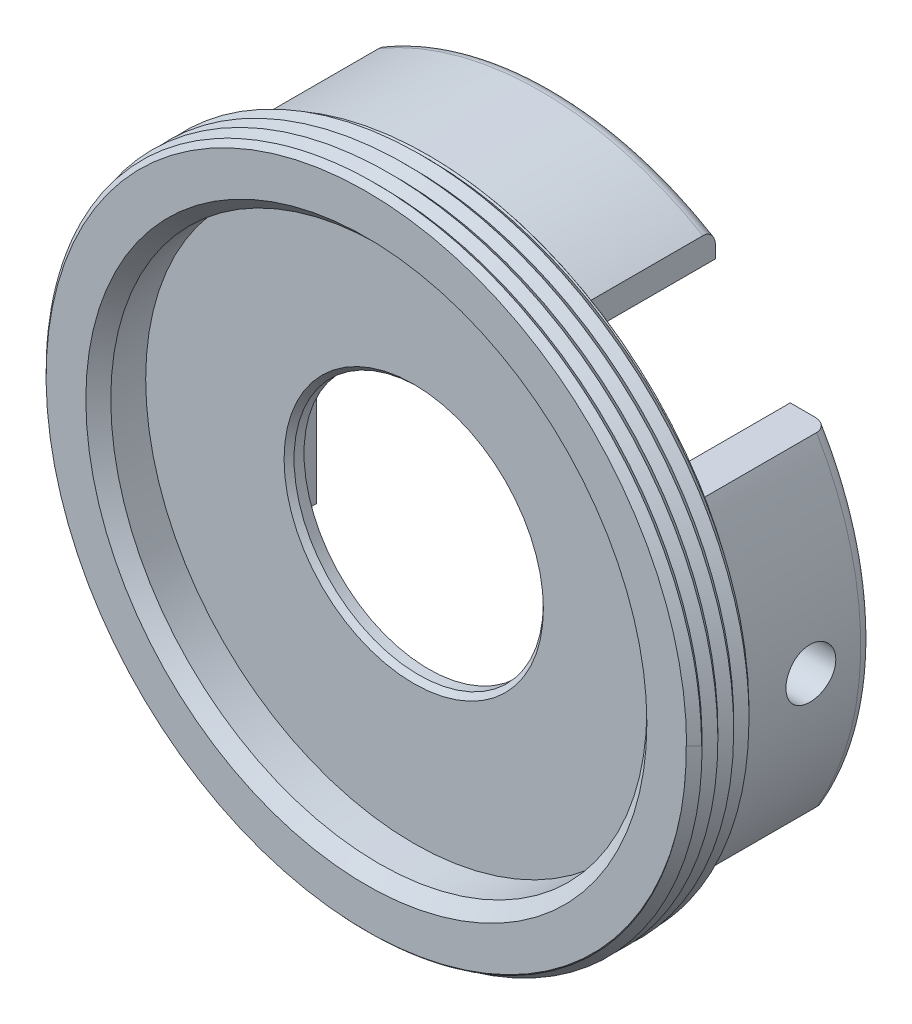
ISO-10303-21;
HEADER;
FILE_DESCRIPTION(('STEP AP214'),'2;1');
FILE_NAME('part.step','',(''),(''),'','','');
FILE_SCHEMA(('AUTOMOTIVE_DESIGN { 1 0 10303 214 1 1 1 1 }'));
ENDSEC;
DATA;
#1=APPLICATION_CONTEXT('core data for automotive mechanical design processes');
#2=APPLICATION_PROTOCOL_DEFINITION('international standard','automotive_design',2000,#1);
#3=PRODUCT_CONTEXT('',#1,'mechanical');
#4=PRODUCT('Part','Part','',(#3));
#5=PRODUCT_RELATED_PRODUCT_CATEGORY('part','',(#4));
#6=PRODUCT_DEFINITION_FORMATION('','',#4);
#7=PRODUCT_DEFINITION_CONTEXT('part definition',#1,'design');
#8=PRODUCT_DEFINITION('design','',#6,#7);
#9=PRODUCT_DEFINITION_SHAPE('','',#8);
#10=(LENGTH_UNIT() NAMED_UNIT(*) SI_UNIT(.MILLI.,.METRE.));
#11=(NAMED_UNIT(*) PLANE_ANGLE_UNIT() SI_UNIT($,.RADIAN.));
#12=(NAMED_UNIT(*) SI_UNIT($,.STERADIAN.) SOLID_ANGLE_UNIT());
#13=UNCERTAINTY_MEASURE_WITH_UNIT(LENGTH_MEASURE(1.E-05),#10,'distance_accuracy_value','');
#14=(GEOMETRIC_REPRESENTATION_CONTEXT(3) GLOBAL_UNCERTAINTY_ASSIGNED_CONTEXT((#13)) GLOBAL_UNIT_ASSIGNED_CONTEXT((#10,
#11,#12)) REPRESENTATION_CONTEXT('',''));
#15=CARTESIAN_POINT('',(0.,0.,0.));
#16=DIRECTION('',(0.,0.,1.));
#17=DIRECTION('',(1.,0.,0.));
#18=AXIS2_PLACEMENT_3D('',#15,#16,#17);
#19=CARTESIAN_POINT('',(0.,0.,-0.333082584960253));
#20=DIRECTION('',(0.,0.,1.));
#21=DIRECTION('',(1.,0.,0.));
#22=AXIS2_PLACEMENT_3D('',#19,#20,#21);
#23=CYLINDRICAL_SURFACE('',#22,5.);
#24=CARTESIAN_POINT('',(0.,0.,0.40000000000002));
#25=DIRECTION('',(0.,0.,1.));
#26=DIRECTION('',(1.,0.,0.));
#27=AXIS2_PLACEMENT_3D('',#24,#25,#26);
#28=CIRCLE('',#27,5.);
#29=CARTESIAN_POINT('',(5.,0.,0.40000000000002));
#30=VERTEX_POINT('',#29);
#31=EDGE_CURVE('E582',#30,#30,#28,.T.);
#32=CARTESIAN_POINT('',(0.,0.,0.));
#33=DIRECTION('',(0.,0.,1.));
#34=DIRECTION('',(1.,0.,0.));
#35=AXIS2_PLACEMENT_3D('',#32,#33,#34);
#36=CIRCLE('',#35,5.);
#37=CARTESIAN_POINT('',(5.,0.,0.));
#38=VERTEX_POINT('',#37);
#39=EDGE_CURVE('E321',#38,#38,#36,.T.);
#40=CARTESIAN_POINT('',(5.,0.,0.40000000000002));
#41=CARTESIAN_POINT('',(5.,0.,0.395833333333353));
#42=CARTESIAN_POINT('',(5.,0.,0.391666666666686));
#43=CARTESIAN_POINT('',(5.,0.,0.383333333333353));
#44=CARTESIAN_POINT('',(5.,0.,0.379166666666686));
#45=CARTESIAN_POINT('',(5.,0.,0.370833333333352));
#46=CARTESIAN_POINT('',(5.,0.,0.366666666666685));
#47=CARTESIAN_POINT('',(5.,0.,0.358333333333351));
#48=CARTESIAN_POINT('',(5.,0.,0.354166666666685));
#49=CARTESIAN_POINT('',(5.,0.,0.345833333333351));
#50=CARTESIAN_POINT('',(5.,0.,0.341666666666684));
#51=CARTESIAN_POINT('',(5.,0.,0.33333333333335));
#52=CARTESIAN_POINT('',(5.,0.,0.329166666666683));
#53=CARTESIAN_POINT('',(5.,0.,0.32083333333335));
#54=CARTESIAN_POINT('',(5.,0.,0.316666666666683));
#55=CARTESIAN_POINT('',(5.,0.,0.308333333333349));
#56=CARTESIAN_POINT('',(5.,0.,0.304166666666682));
#57=CARTESIAN_POINT('',(5.,0.,0.295833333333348));
#58=CARTESIAN_POINT('',(5.,0.,0.291666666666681));
#59=CARTESIAN_POINT('',(5.,0.,0.283333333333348));
#60=CARTESIAN_POINT('',(5.,0.,0.279166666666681));
#61=CARTESIAN_POINT('',(5.,0.,0.270833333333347));
#62=CARTESIAN_POINT('',(5.,0.,0.26666666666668));
#63=CARTESIAN_POINT('',(5.,0.,0.258333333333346));
#64=CARTESIAN_POINT('',(5.,0.,0.254166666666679));
#65=CARTESIAN_POINT('',(5.,0.,0.245833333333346));
#66=CARTESIAN_POINT('',(5.,0.,0.241666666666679));
#67=CARTESIAN_POINT('',(5.,0.,0.233333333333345));
#68=CARTESIAN_POINT('',(5.,0.,0.229166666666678));
#69=CARTESIAN_POINT('',(5.,0.,0.220833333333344));
#70=CARTESIAN_POINT('',(5.,0.,0.216666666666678));
#71=CARTESIAN_POINT('',(5.,0.,0.208333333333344));
#72=CARTESIAN_POINT('',(5.,0.,0.204166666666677));
#73=CARTESIAN_POINT('',(5.,0.,0.195833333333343));
#74=CARTESIAN_POINT('',(5.,0.,0.191666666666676));
#75=CARTESIAN_POINT('',(5.,0.,0.183333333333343));
#76=CARTESIAN_POINT('',(5.,0.,0.179166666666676));
#77=CARTESIAN_POINT('',(5.,0.,0.170833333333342));
#78=CARTESIAN_POINT('',(5.,0.,0.166666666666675));
#79=CARTESIAN_POINT('',(5.,0.,0.158333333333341));
#80=CARTESIAN_POINT('',(5.,0.,0.154166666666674));
#81=CARTESIAN_POINT('',(5.,0.,0.145833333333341));
#82=CARTESIAN_POINT('',(5.,0.,0.141666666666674));
#83=CARTESIAN_POINT('',(5.,0.,0.13333333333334));
#84=CARTESIAN_POINT('',(5.,0.,0.129166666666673));
#85=CARTESIAN_POINT('',(5.,0.,0.120833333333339));
#86=CARTESIAN_POINT('',(5.,0.,0.116666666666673));
#87=CARTESIAN_POINT('',(5.,0.,0.108333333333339));
#88=CARTESIAN_POINT('',(5.,0.,0.104166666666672));
#89=CARTESIAN_POINT('',(5.,0.,0.0958333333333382));
#90=CARTESIAN_POINT('',(5.,0.,0.0916666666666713));
#91=CARTESIAN_POINT('',(5.,0.,0.0833333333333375));
#92=CARTESIAN_POINT('',(5.,0.,0.0791666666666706));
#93=CARTESIAN_POINT('',(5.,0.,0.0708333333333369));
#94=CARTESIAN_POINT('',(5.,0.,0.06666666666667));
#95=CARTESIAN_POINT('',(5.,0.,0.0583333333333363));
#96=CARTESIAN_POINT('',(5.,0.,0.0541666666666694));
#97=CARTESIAN_POINT('',(5.,0.,0.0458333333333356));
#98=CARTESIAN_POINT('',(5.,0.,0.0416666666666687));
#99=CARTESIAN_POINT('',(5.,0.,0.033333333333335));
#100=CARTESIAN_POINT('',(5.,0.,0.0291666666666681));
#101=CARTESIAN_POINT('',(5.,0.,0.0208333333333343));
#102=CARTESIAN_POINT('',(5.,0.,0.0166666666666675));
#103=CARTESIAN_POINT('',(5.,0.,0.0083333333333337));
#104=CARTESIAN_POINT('',(5.,0.,0.00416666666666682));
#105=CARTESIAN_POINT('',(5.,0.,0.));
#106=B_SPLINE_CURVE_WITH_KNOTS('',3,(#40,#41,#42,#43,#44,#45,#46,#47,#48,#49,#50,#51,#52,#53,
#54,#55,#56,#57,#58,#59,#60,#61,#62,#63,#64,#65,#66,#67,#68,#69,#70,#71,#72,#73,#74,#75,#76,#77,
#78,#79,#80,#81,#82,#83,#84,#85,#86,#87,#88,#89,#90,#91,#92,#93,#94,#95,#96,#97,#98,#99,#100,
#101,#102,#103,#104,#105),.UNSPECIFIED.,.F.,.F.,(4,2,2,2,2,2,2,2,2,2,2,2,2,2,2,2,2,2,2,2,2,2,2,
2,2,2,2,2,2,2,2,2,4),(0.,0.0125000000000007,0.0250000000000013,0.0375000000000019,
0.0500000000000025,0.0625000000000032,0.0750000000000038,0.0875000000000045,0.100000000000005,
0.112500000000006,0.125000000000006,0.137500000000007,0.150000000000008,0.162500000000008,
0.175000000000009,0.187500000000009,0.20000000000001,0.212500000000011,0.225000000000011,
0.237500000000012,0.250000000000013,0.262500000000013,0.275000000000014,0.287500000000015,
0.300000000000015,0.312500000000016,0.325000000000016,0.337500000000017,0.350000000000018,
0.362500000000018,0.375000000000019,0.38750000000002,0.40000000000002),.UNSPECIFIED.);
#107=EDGE_CURVE('BSEAM43',#30,#38,#106,.T.);
#108=ORIENTED_EDGE('',*,*,#31,.T.);
#109=ORIENTED_EDGE('',*,*,#39,.F.);
#110=ORIENTED_EDGE('',*,*,#107,.T.);
#111=ORIENTED_EDGE('',*,*,#107,.F.);
#112=EDGE_LOOP('',(#108,#110,#109,#111));
#113=FACE_BOUND('',#112,.T.);
#114=ADVANCED_FACE('F43',(#113),#23,.F.);
#115=CARTESIAN_POINT('',(0.,0.,0.));
#116=DIRECTION('',(0.,0.,1.));
#117=DIRECTION('',(1.,0.,0.));
#118=AXIS2_PLACEMENT_3D('',#115,#116,#117);
#119=PLANE('',#118);
#120=CARTESIAN_POINT('',(0.,0.,0.));
#121=DIRECTION('',(0.,0.,-1.));
#122=DIRECTION('',(-1.,0.,0.));
#123=AXIS2_PLACEMENT_3D('',#120,#121,#122);
#124=CIRCLE('',#123,12.827);
#125=CARTESIAN_POINT('',(-11.0581159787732,-6.5,0.));
#126=VERTEX_POINT('',#125);
#127=CARTESIAN_POINT('',(-11.0581159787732,6.5,0.));
#128=VERTEX_POINT('',#127);
#129=EDGE_CURVE('E229',#126,#128,#124,.T.);
#130=ORIENTED_EDGE('',*,*,#129,.F.);
#131=DIRECTION('',(1.,0.,0.));
#132=VECTOR('',#131,1.);
#133=CARTESIAN_POINT('',(-28.3993213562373,-6.5,0.));
#134=LINE('',#133,#132);
#135=CARTESIAN_POINT('',(-9.5,-6.5,0.));
#136=VERTEX_POINT('',#135);
#137=EDGE_CURVE('E226',#126,#136,#134,.T.);
#138=ORIENTED_EDGE('',*,*,#137,.T.);
#139=DIRECTION('',(0.,-1.,0.));
#140=VECTOR('',#139,1.);
#141=CARTESIAN_POINT('',(-9.5,0.,0.));
#142=LINE('',#141,#140);
#143=CARTESIAN_POINT('',(-9.5,6.5,0.));
#144=VERTEX_POINT('',#143);
#145=EDGE_CURVE('E236',#144,#136,#142,.T.);
#146=ORIENTED_EDGE('',*,*,#145,.F.);
#147=DIRECTION('',(1.,0.,0.));
#148=VECTOR('',#147,1.);
#149=CARTESIAN_POINT('',(-28.3993213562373,6.5,0.));
#150=LINE('',#149,#148);
#151=EDGE_CURVE('E209',#128,#144,#150,.T.);
#152=ORIENTED_EDGE('',*,*,#151,.F.);
#153=EDGE_LOOP('',(#130,#138,#146,#152));
#154=FACE_BOUND('',#153,.T.);
#155=CARTESIAN_POINT('',(0.,0.,0.));
#156=DIRECTION('',(0.,0.,-1.));
#157=DIRECTION('',(-1.,0.,0.));
#158=AXIS2_PLACEMENT_3D('',#155,#156,#157);
#159=CIRCLE('',#158,12.827);
#160=CARTESIAN_POINT('',(11.0581159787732,6.5,0.));
#161=VERTEX_POINT('',#160);
#162=CARTESIAN_POINT('',(11.8097023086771,5.00628209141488,0.));
#163=VERTEX_POINT('',#162);
#164=EDGE_CURVE('E301',#161,#163,#159,.T.);
#165=ORIENTED_EDGE('',*,*,#164,.F.);
#166=DIRECTION('',(1.,0.,0.));
#167=VECTOR('',#166,1.);
#168=CARTESIAN_POINT('',(-28.3993213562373,6.5,0.));
#169=LINE('',#168,#167);
#170=CARTESIAN_POINT('',(9.50000000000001,6.5,0.));
#171=VERTEX_POINT('',#170);
#172=EDGE_CURVE('E285',#171,#161,#169,.T.);
#173=ORIENTED_EDGE('',*,*,#172,.F.);
#174=DIRECTION('',(0.,-1.,0.));
#175=VECTOR('',#174,1.);
#176=CARTESIAN_POINT('',(9.50000000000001,0.,0.));
#177=LINE('',#176,#175);
#178=CARTESIAN_POINT('',(9.5,-6.5,0.));
#179=VERTEX_POINT('',#178);
#180=EDGE_CURVE('E291',#171,#179,#177,.T.);
#181=ORIENTED_EDGE('',*,*,#180,.T.);
#182=DIRECTION('',(1.,0.,0.));
#183=VECTOR('',#182,1.);
#184=CARTESIAN_POINT('',(-28.3993213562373,-6.5,0.));
#185=LINE('',#184,#183);
#186=CARTESIAN_POINT('',(11.0581159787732,-6.5,0.));
#187=VERTEX_POINT('',#186);
#188=EDGE_CURVE('E302',#179,#187,#185,.T.);
#189=ORIENTED_EDGE('',*,*,#188,.T.);
#190=CARTESIAN_POINT('',(0.,0.,0.));
#191=DIRECTION('',(0.,0.,1.));
#192=DIRECTION('',(1.,0.,0.));
#193=AXIS2_PLACEMENT_3D('',#190,#191,#192);
#194=CIRCLE('',#193,12.827);
#195=CARTESIAN_POINT('',(11.8097492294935,5.00617140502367,0.));
#196=VERTEX_POINT('',#195);
#197=EDGE_CURVE('E863',#196,#187,#194,.F.);
#198=ORIENTED_EDGE('',*,*,#197,.F.);
#199=CARTESIAN_POINT('',(11.8097173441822,5.00624493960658,0.));
#200=CARTESIAN_POINT('',(11.8740413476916,4.8578968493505,0.));
#201=CARTESIAN_POINT('',(11.935550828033,4.7083461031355,0.));
#202=CARTESIAN_POINT('',(12.0529653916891,4.40677207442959,0.));
#203=CARTESIAN_POINT('',(12.1088609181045,4.25474507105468,0.));
#204=CARTESIAN_POINT('',(12.2692961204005,3.79143685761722,0.));
#205=CARTESIAN_POINT('',(12.3648247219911,3.47698120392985,0.));
#206=CARTESIAN_POINT('',(12.5314791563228,2.84153240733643,0.));
#207=CARTESIAN_POINT('',(12.6025924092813,2.52053598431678,0.));
#208=CARTESIAN_POINT('',(12.719952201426,1.87399120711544,0.));
#209=CARTESIAN_POINT('',(12.7661966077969,1.54844246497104,0.));
#210=CARTESIAN_POINT('',(12.8335079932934,0.8948860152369,0.));
#211=CARTESIAN_POINT('',(12.8545850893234,0.566879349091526,0.));
#212=CARTESIAN_POINT('',(12.8714112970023,-0.085959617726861,0.));
#213=CARTESIAN_POINT('',(12.8674520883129,-0.410784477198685,0.));
#214=CARTESIAN_POINT('',(12.8351266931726,-1.05909456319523,0.));
#215=CARTESIAN_POINT('',(12.8067695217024,-1.38258024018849,0.));
#216=CARTESIAN_POINT('',(12.7253326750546,-2.03000669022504,0.));
#217=CARTESIAN_POINT('',(12.6719872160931,-2.35391407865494,0.));
#218=CARTESIAN_POINT('',(12.5407868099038,-2.99682103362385,0.));
#219=CARTESIAN_POINT('',(12.4629248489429,-3.31581916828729,0.));
#220=CARTESIAN_POINT('',(12.2829842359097,-3.94752257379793,0.));
#221=CARTESIAN_POINT('',(12.1808630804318,-4.26021574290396,0.));
#222=CARTESIAN_POINT('',(11.953074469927,-4.87690821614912,0.));
#223=CARTESIAN_POINT('',(11.827406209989,-5.18090722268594,0.));
#224=CARTESIAN_POINT('',(11.5387500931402,-5.81004005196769,0.));
#225=CARTESIAN_POINT('',(11.3732216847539,-6.13401181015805,0.));
#226=CARTESIAN_POINT('',(11.0154140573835,-6.766895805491,0.));
#227=CARTESIAN_POINT('',(10.8231300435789,-7.07580532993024,0.));
#228=CARTESIAN_POINT('',(10.4135062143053,-7.67586434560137,0.));
#229=CARTESIAN_POINT('',(10.1962042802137,-7.96703969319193,0.));
#230=CARTESIAN_POINT('',(9.73794397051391,-8.52995500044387,0.));
#231=CARTESIAN_POINT('',(9.49699461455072,-8.80170230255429,0.));
#232=CARTESIAN_POINT('',(8.99643908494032,-9.3204740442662,0.));
#233=CARTESIAN_POINT('',(8.73712409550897,-9.56777952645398,0.));
#234=CARTESIAN_POINT('',(8.19887202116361,-10.0399898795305,0.));
#235=CARTESIAN_POINT('',(7.91993617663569,-10.2648961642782,0.));
#236=CARTESIAN_POINT('',(7.34049381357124,-10.6936154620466,0.));
#237=CARTESIAN_POINT('',(7.03974863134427,-10.8971060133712,0.));
#238=CARTESIAN_POINT('',(6.42209158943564,-11.2781634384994,0.));
#239=CARTESIAN_POINT('',(6.10517298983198,-11.4557193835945,0.));
#240=CARTESIAN_POINT('',(5.45715903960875,-11.7840345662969,0.));
#241=CARTESIAN_POINT('',(5.12604309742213,-11.9347531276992,0.));
#242=CARTESIAN_POINT('',(4.45243450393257,-12.207928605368,0.));
#243=CARTESIAN_POINT('',(4.10994527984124,-12.3303939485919,0.));
#244=CARTESIAN_POINT('',(3.51744396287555,-12.5147001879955,0.));
#245=CARTESIAN_POINT('',(3.26966106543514,-12.5837984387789,0.));
#246=CARTESIAN_POINT('',(2.77044310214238,-12.7072087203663,0.));
#247=CARTESIAN_POINT('',(2.51900828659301,-12.7615217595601,0.));
#248=CARTESIAN_POINT('',(2.01406854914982,-12.8550382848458,0.));
#249=CARTESIAN_POINT('',(1.76057128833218,-12.8942831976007,0.));
#250=CARTESIAN_POINT('',(1.25166028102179,-12.9577569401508,0.));
#251=CARTESIAN_POINT('',(0.996246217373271,-12.9819832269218,0.));
#252=CARTESIAN_POINT('',(0.740336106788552,-12.9986339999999,0.));
#253=B_SPLINE_CURVE_WITH_KNOTS('',3,(#199,#200,#201,#202,#203,#204,#205,#206,#207,#208,#209,
#210,#211,#212,#213,#214,#215,#216,#217,#218,#219,#220,#221,#222,#223,#224,#225,#226,#227,#228,
#229,#230,#231,#232,#233,#234,#235,#236,#237,#238,#239,#240,#241,#242,#243,#244,#245,#246,#247,
#248,#249,#250,#251,#252),.UNSPECIFIED.,.F.,.F.,(4,2,2,2,2,2,2,2,2,2,2,2,2,2,2,2,2,2,2,2,2,2,2,
2,2,2,4),(0.,0.485018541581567,0.970849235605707,1.95573070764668,2.94111887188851,
3.92659153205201,4.91166791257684,5.88528920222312,6.85855089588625,7.84240812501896,
8.82654707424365,9.81242317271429,10.7983329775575,11.8884440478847,12.9787507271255,
14.067427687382,15.1556910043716,16.2294618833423,17.3031649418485,18.3912329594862,
19.479758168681,20.5699194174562,21.6597550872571,22.431049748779,23.2022917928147,
23.9713980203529,24.7406344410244),.UNSPECIFIED.);
#254=CARTESIAN_POINT('',(12.5010606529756,2.95036655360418,0.));
#255=VERTEX_POINT('',#254);
#256=EDGE_CURVE('E343',#196,#255,#253,.T.);
#257=ORIENTED_EDGE('',*,*,#256,.T.);
#258=CARTESIAN_POINT('',(0.,0.,0.));
#259=DIRECTION('',(0.,0.,1.));
#260=DIRECTION('',(1.,0.,0.));
#261=AXIS2_PLACEMENT_3D('',#258,#259,#260);
#262=CIRCLE('',#261,12.8445);
#263=CARTESIAN_POINT('',(10.8371129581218,6.89479245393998,0.));
#264=VERTEX_POINT('',#263);
#265=EDGE_CURVE('E867',#255,#264,#262,.F.);
#266=ORIENTED_EDGE('',*,*,#265,.T.);
#267=CARTESIAN_POINT('',(-12.998634,1.57042613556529,0.));
#268=CARTESIAN_POINT('',(-12.9780473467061,1.73080154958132,0.));
#269=CARTESIAN_POINT('',(-12.9544823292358,1.89077886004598,0.));
#270=CARTESIAN_POINT('',(-12.9013825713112,2.2100068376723,0.));
#271=CARTESIAN_POINT('',(-12.8718381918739,2.36925590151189,0.));
#272=CARTESIAN_POINT('',(-12.7734807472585,2.84938724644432,0.));
#273=CARTESIAN_POINT('',(-12.6954824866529,3.16843802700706,0.));
#274=CARTESIAN_POINT('',(-12.5156251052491,3.79987651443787,0.));
#275=CARTESIAN_POINT('',(-12.4137541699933,4.11226083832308,0.));
#276=CARTESIAN_POINT('',(-12.1867368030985,4.72849113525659,0.));
#277=CARTESIAN_POINT('',(-12.0615885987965,5.03233645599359,0.));
#278=CARTESIAN_POINT('',(-11.7887885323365,5.62960735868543,0.));
#279=CARTESIAN_POINT('',(-11.6411453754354,5.92303691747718,0.));
#280=CARTESIAN_POINT('',(-11.3259264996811,6.49472927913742,0.));
#281=CARTESIAN_POINT('',(-11.158591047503,6.77312458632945,0.));
#282=CARTESIAN_POINT('',(-10.8037005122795,7.31656476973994,0.));
#283=CARTESIAN_POINT('',(-10.616153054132,7.58161462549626,0.));
#284=CARTESIAN_POINT('',(-10.2197321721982,8.0997430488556,0.));
#285=CARTESIAN_POINT('',(-10.0106533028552,8.35266446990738,0.));
#286=CARTESIAN_POINT('',(-9.57398508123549,8.84211005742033,0.));
#287=CARTESIAN_POINT('',(-9.34639068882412,9.07862972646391,0.));
#288=CARTESIAN_POINT('',(-8.87364428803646,9.53422586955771,0.));
#289=CARTESIAN_POINT('',(-8.62846438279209,9.75327340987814,0.));
#290=CARTESIAN_POINT('',(-8.12217794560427,10.1723327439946,0.));
#291=CARTESIAN_POINT('',(-7.86106415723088,10.3723357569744,0.));
#292=CARTESIAN_POINT('',(-7.29284989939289,10.7744389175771,0.));
#293=CARTESIAN_POINT('',(-6.9839534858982,10.9740169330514,0.));
#294=CARTESIAN_POINT('',(-6.50896006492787,11.2532249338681,0.));
#295=CARTESIAN_POINT('',(-6.34870035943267,11.3429282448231,0.));
#296=CARTESIAN_POINT('',(-6.02450720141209,11.515430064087,0.));
#297=CARTESIAN_POINT('',(-5.86057378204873,11.598228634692,0.));
#298=CARTESIAN_POINT('',(-5.36418025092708,11.8358217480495,0.));
#299=CARTESIAN_POINT('',(-5.02661806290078,11.9801127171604,0.));
#300=CARTESIAN_POINT('',(-4.34063525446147,12.2394491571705,0.));
#301=CARTESIAN_POINT('',(-3.99221879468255,12.3545056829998,0.));
#302=CARTESIAN_POINT('',(-3.29364144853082,12.5527237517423,0.));
#303=CARTESIAN_POINT('',(-2.94364230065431,12.6364549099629,0.));
#304=CARTESIAN_POINT('',(-2.23777692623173,12.774518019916,0.));
#305=CARTESIAN_POINT('',(-1.88190882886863,12.8288404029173,0.));
#306=CARTESIAN_POINT('',(-1.16270515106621,12.9081287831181,0.));
#307=CARTESIAN_POINT('',(-0.799330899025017,12.9327444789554,0.));
#308=CARTESIAN_POINT('',(-0.0716420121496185,12.9512860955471,0.));
#309=CARTESIAN_POINT('',(0.292672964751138,12.9451985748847,0.));
#310=CARTESIAN_POINT('',(1.01946350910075,12.9023483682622,0.));
#311=CARTESIAN_POINT('',(1.38193922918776,12.8655882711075,0.));
#312=CARTESIAN_POINT('',(2.10234749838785,12.7616802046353,0.));
#313=CARTESIAN_POINT('',(2.46028197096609,12.6945455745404,0.));
#314=CARTESIAN_POINT('',(3.16423703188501,12.5315245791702,0.));
#315=CARTESIAN_POINT('',(3.51035436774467,12.436055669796,0.));
#316=CARTESIAN_POINT('',(4.19346684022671,12.2167096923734,0.));
#317=CARTESIAN_POINT('',(4.53046200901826,12.0928327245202,0.));
#318=CARTESIAN_POINT('',(5.19724758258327,11.8157479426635,0.));
#319=CARTESIAN_POINT('',(5.5268901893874,11.6621843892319,0.));
#320=CARTESIAN_POINT('',(6.17225380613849,11.3278384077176,0.));
#321=CARTESIAN_POINT('',(6.48796876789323,11.1470443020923,0.));
#322=CARTESIAN_POINT('',(7.10300580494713,10.7592769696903,0.));
#323=CARTESIAN_POINT('',(7.40232380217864,10.5522972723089,0.));
#324=CARTESIAN_POINT('',(7.98218874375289,10.1137839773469,0.));
#325=CARTESIAN_POINT('',(8.26274402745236,9.88226140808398,0.));
#326=CARTESIAN_POINT('',(8.79860389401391,9.40039890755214,0.));
#327=CARTESIAN_POINT('',(9.05425689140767,9.15044617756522,0.));
#328=CARTESIAN_POINT('',(9.54355485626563,8.63038959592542,0.));
#329=CARTESIAN_POINT('',(9.77722542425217,8.36030985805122,0.));
#330=CARTESIAN_POINT('',(10.1844668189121,7.84793563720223,0.));
#331=CARTESIAN_POINT('',(10.36158204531,7.60844671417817,0.));
#332=CARTESIAN_POINT('',(10.6987881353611,7.11767153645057,0.));
#333=CARTESIAN_POINT('',(10.8588748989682,6.8663824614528,0.));
#334=CARTESIAN_POINT('',(11.1617749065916,6.35228385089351,0.));
#335=CARTESIAN_POINT('',(11.3045184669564,6.08943326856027,0.));
#336=CARTESIAN_POINT('',(11.5713019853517,5.55447230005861,0.));
#337=CARTESIAN_POINT('',(11.695345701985,5.28236378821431,0.));
#338=CARTESIAN_POINT('',(11.8097173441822,5.00624493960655,0.));
#339=B_SPLINE_CURVE_WITH_KNOTS('',3,(#267,#268,#269,#270,#271,#272,#273,#274,#275,#276,#277,
#278,#279,#280,#281,#282,#283,#284,#285,#286,#287,#288,#289,#290,#291,#292,#293,#294,#295,#296,
#297,#298,#299,#300,#301,#302,#303,#304,#305,#306,#307,#308,#309,#310,#311,#312,#313,#314,#315,
#316,#317,#318,#319,#320,#321,#322,#323,#324,#325,#326,#327,#328,#329,#330,#331,#332,#333,#334,
#335,#336,#337,#338),.UNSPECIFIED.,.F.,.F.,(4,2,2,2,2,2,2,2,2,2,2,2,2,2,2,2,2,2,2,2,2,2,2,2,2,2,
2,2,2,2,2,2,2,2,2,4),(0.,0.485014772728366,0.970817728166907,1.95514132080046,2.93995308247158,
3.92483987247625,4.90934648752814,5.88289013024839,6.85606778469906,7.83958710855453,
8.82337505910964,9.80875971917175,10.7945965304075,11.8964283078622,12.4472586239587,
12.9980839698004,14.0979699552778,15.1974394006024,16.2758131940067,17.3545376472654,
18.4458618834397,19.5376639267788,20.6293738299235,21.7206047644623,22.7964953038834,
23.8723820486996,24.9620648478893,26.0522162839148,27.1426376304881,28.2325710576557,
29.3039594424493,30.3740842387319,31.2669910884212,32.1601124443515,33.0567112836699,
33.9531296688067),.UNSPECIFIED.);
#340=EDGE_CURVE('E406',#264,#163,#339,.T.);
#341=ORIENTED_EDGE('',*,*,#340,.T.);
#342=EDGE_LOOP('',(#165,#173,#181,#189,#198,#257,#266,#341));
#343=FACE_BOUND('',#342,.T.);
#344=ORIENTED_EDGE('',*,*,#39,.T.);
#345=EDGE_LOOP('',(#344));
#346=FACE_BOUND('',#345,.T.);
#347=DIRECTION('',(0.,1.,0.));
#348=VECTOR('',#347,1.);
#349=CARTESIAN_POINT('',(-6.49999999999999,0.,0.));
#350=LINE('',#349,#348);
#351=CARTESIAN_POINT('',(-6.5,10.,0.));
#352=VERTEX_POINT('',#351);
#353=CARTESIAN_POINT('',(-6.5,11.0581159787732,0.));
#354=VERTEX_POINT('',#353);
#355=EDGE_CURVE('E244',#352,#354,#350,.T.);
#356=ORIENTED_EDGE('',*,*,#355,.F.);
#357=DIRECTION('',(-1.,0.,0.));
#358=VECTOR('',#357,1.);
#359=CARTESIAN_POINT('',(-28.3993213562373,10.,0.));
#360=LINE('',#359,#358);
#361=CARTESIAN_POINT('',(6.5,10.,0.));
#362=VERTEX_POINT('',#361);
#363=EDGE_CURVE('E250',#362,#352,#360,.T.);
#364=ORIENTED_EDGE('',*,*,#363,.F.);
#365=DIRECTION('',(0.,1.,0.));
#366=VECTOR('',#365,1.);
#367=CARTESIAN_POINT('',(6.5,0.,0.));
#368=LINE('',#367,#366);
#369=CARTESIAN_POINT('',(6.5,11.0581159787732,0.));
#370=VERTEX_POINT('',#369);
#371=EDGE_CURVE('E265',#362,#370,#368,.T.);
#372=ORIENTED_EDGE('',*,*,#371,.T.);
#373=CARTESIAN_POINT('',(0.,0.,0.));
#374=DIRECTION('',(0.,0.,-1.));
#375=DIRECTION('',(-1.,0.,0.));
#376=AXIS2_PLACEMENT_3D('',#373,#374,#375);
#377=CIRCLE('',#376,12.827);
#378=EDGE_CURVE('E261',#354,#370,#377,.T.);
#379=ORIENTED_EDGE('',*,*,#378,.F.);
#380=EDGE_LOOP('',(#356,#364,#372,#379));
#381=FACE_BOUND('',#380,.T.);
#382=ADVANCED_FACE('F364',(#154,#343,#346,#381),#119,.F.);
#383=CARTESIAN_POINT('',(0.,0.,2.5));
#384=DIRECTION('',(0.,0.,-1.));
#385=DIRECTION('',(-1.,0.,0.));
#386=AXIS2_PLACEMENT_3D('',#383,#384,#385);
#387=CYLINDRICAL_SURFACE('',#386,13.1445);
#388=DIRECTION('',(0.,0.,-1.));
#389=VECTOR('',#388,1.);
#390=CARTESIAN_POINT('',(13.1445,8.76681875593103E-13,2.5));
#391=LINE('',#390,#389);
#392=CARTESIAN_POINT('',(13.1444993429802,4.33044726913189E-13,2.18253154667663));
#393=VERTEX_POINT('',#392);
#394=CARTESIAN_POINT('',(13.1445,8.76681875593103E-13,2.20000000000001));
#395=VERTEX_POINT('',#394);
#396=EDGE_CURVE('E847',#393,#395,#391,.F.);
#397=ORIENTED_EDGE('',*,*,#396,.F.);
#398=CARTESIAN_POINT('',(13.1444993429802,0.,-0.357468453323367));
#399=CARTESIAN_POINT('',(13.1444993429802,7.58898023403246,-0.3045517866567));
#400=CARTESIAN_POINT('',(6.57224967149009,11.3834703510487,-0.251635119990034));
#401=CARTESIAN_POINT('',(0.,15.1779604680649,-0.198718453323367));
#402=CARTESIAN_POINT('',(-6.57224967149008,11.3834703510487,-0.145801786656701));
#403=CARTESIAN_POINT('',(-13.1444993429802,7.58898023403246,-0.0928851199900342));
#404=CARTESIAN_POINT('',(-13.1444993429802,0.,-0.0399684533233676));
#405=CARTESIAN_POINT('',(-13.1444993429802,-7.58898023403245,0.0129482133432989));
#406=CARTESIAN_POINT('',(-6.57224967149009,-11.3834703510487,0.0658648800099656));
#407=CARTESIAN_POINT('',(0.,-15.1779604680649,0.118781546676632));
#408=CARTESIAN_POINT('',(6.57224967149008,-11.3834703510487,0.171698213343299));
#409=CARTESIAN_POINT('',(13.1444993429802,-7.58898023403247,0.224614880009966));
#410=CARTESIAN_POINT('',(13.1444993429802,0.,0.277531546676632));
#411=CARTESIAN_POINT('',(13.1444993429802,7.58898023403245,0.330448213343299));
#412=CARTESIAN_POINT('',(6.57224967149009,11.3834703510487,0.383364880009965));
#413=CARTESIAN_POINT('',(0.,15.1779604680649,0.436281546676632));
#414=CARTESIAN_POINT('',(-6.57224967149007,11.3834703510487,0.489198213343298));
#415=CARTESIAN_POINT('',(-13.1444993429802,7.58898023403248,0.542114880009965));
#416=CARTESIAN_POINT('',(-13.1444993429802,0.,0.595031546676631));
#417=CARTESIAN_POINT('',(-13.1444993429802,-7.58898023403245,0.647948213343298));
#418=CARTESIAN_POINT('',(-6.5722496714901,-11.3834703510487,0.700864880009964));
#419=CARTESIAN_POINT('',(0.,-15.1779604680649,0.753781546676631));
#420=CARTESIAN_POINT('',(6.57224967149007,-11.3834703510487,0.806698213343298));
#421=CARTESIAN_POINT('',(13.1444993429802,-7.58898023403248,0.859614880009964));
#422=CARTESIAN_POINT('',(13.1444993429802,0.,0.912531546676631));
#423=CARTESIAN_POINT('',(13.1444993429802,7.58898023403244,0.965448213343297));
#424=CARTESIAN_POINT('',(6.5722496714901,11.3834703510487,1.01836488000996));
#425=CARTESIAN_POINT('',(0.,15.1779604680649,1.07128154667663));
#426=CARTESIAN_POINT('',(-6.57224967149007,11.3834703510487,1.1241982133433));
#427=CARTESIAN_POINT('',(-13.1444993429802,7.58898023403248,1.17711488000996));
#428=CARTESIAN_POINT('',(-13.1444993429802,0.,1.23003154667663));
#429=CARTESIAN_POINT('',(-13.1444993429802,-7.58898023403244,1.2829482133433));
#430=CARTESIAN_POINT('',(-6.5722496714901,-11.3834703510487,1.33586488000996));
#431=CARTESIAN_POINT('',(0.,-15.1779604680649,1.38878154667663));
#432=CARTESIAN_POINT('',(6.57224967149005,-11.3834703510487,1.4416982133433));
#433=CARTESIAN_POINT('',(13.1444993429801,-7.58898023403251,1.49461488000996));
#434=CARTESIAN_POINT('',(13.1444993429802,0.,1.54753154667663));
#435=CARTESIAN_POINT('',(13.1444993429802,7.58898023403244,1.6004482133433));
#436=CARTESIAN_POINT('',(6.57224967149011,11.3834703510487,1.65336488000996));
#437=CARTESIAN_POINT('',(0.,15.1779604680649,1.70628154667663));
#438=CARTESIAN_POINT('',(-6.57224967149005,11.3834703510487,1.7591982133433));
#439=CARTESIAN_POINT('',(-13.1444993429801,7.58898023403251,1.81211488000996));
#440=CARTESIAN_POINT('',(-13.1444993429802,0.,1.86503154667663));
#441=CARTESIAN_POINT('',(-13.1444993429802,-7.58898023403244,1.9179482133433));
#442=CARTESIAN_POINT('',(-6.57224967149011,-11.3834703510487,1.97086488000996));
#443=CARTESIAN_POINT('',(0.,-15.1779604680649,2.02378154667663));
#444=CARTESIAN_POINT('',(6.57224967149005,-11.3834703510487,2.07669821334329));
#445=CARTESIAN_POINT('',(13.1444993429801,-7.58898023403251,2.12961488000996));
#446=CARTESIAN_POINT('',(13.1444993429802,0.,2.18253154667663));
#447=CARTESIAN_POINT('',(13.1444993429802,7.58898023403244,2.23544821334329));
#448=CARTESIAN_POINT('',(6.57224967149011,11.3834703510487,2.28836488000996));
#449=CARTESIAN_POINT('',(0.,15.1779604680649,2.34128154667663));
#450=CARTESIAN_POINT('',(-6.57224967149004,11.3834703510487,2.39419821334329));
#451=CARTESIAN_POINT('',(-13.1444993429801,7.58898023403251,2.44711488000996));
#452=CARTESIAN_POINT('',(-13.1444993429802,0.,2.50003154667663));
#453=CARTESIAN_POINT('',(-13.1444993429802,-7.58898023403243,2.55294821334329));
#454=CARTESIAN_POINT('',(-6.57224967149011,-11.3834703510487,2.60586488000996));
#455=CARTESIAN_POINT('',(0.,-15.1779604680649,2.65878154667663));
#456=CARTESIAN_POINT('',(6.57224967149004,-11.3834703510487,2.71169821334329));
#457=CARTESIAN_POINT('',(13.1444993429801,-7.58898023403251,2.76461488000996));
#458=CARTESIAN_POINT('',(13.1444993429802,0.,2.81753154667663));
#459=(BOUNDED_CURVE() B_SPLINE_CURVE(2,(#398,#399,#400,#401,#402,#403,#404,#405,#406,#407,#408,
#409,#410,#411,#412,#413,#414,#415,#416,#417,#418,#419,#420,#421,#422,#423,#424,#425,#426,#427,
#428,#429,#430,#431,#432,#433,#434,#435,#436,#437,#438,#439,#440,#441,#442,#443,#444,#445,#446,
#447,#448,#449,#450,#451,#452,#453,#454,#455,#456,#457,#458),.UNSPECIFIED.,.F.,
.F.) B_SPLINE_CURVE_WITH_KNOTS((3,2,2,2,2,2,2,2,2,2,2,2,2,2,2,2,2,2,2,2,2,2,2,2,2,2,2,2,2,2,3),
(0.,0.0333333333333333,0.0666666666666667,0.1,0.133333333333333,0.166666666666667,0.2,
0.233333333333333,0.266666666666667,0.3,0.333333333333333,0.366666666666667,0.4,
0.433333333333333,0.466666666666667,0.5,0.533333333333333,0.566666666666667,0.6,
0.633333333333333,0.666666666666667,0.7,0.733333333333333,0.766666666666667,0.8,
0.833333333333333,0.866666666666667,0.9,0.933333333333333,0.966666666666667,1.),
.UNSPECIFIED.) CURVE() GEOMETRIC_REPRESENTATION_ITEM() RATIONAL_B_SPLINE_CURVE((1.,
0.866025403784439,1.,0.866025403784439,1.,0.866025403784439,1.,0.866025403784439,1.,
0.866025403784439,1.,0.866025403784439,1.,0.866025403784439,1.,0.866025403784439,1.,
0.866025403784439,1.,0.866025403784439,1.,0.866025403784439,1.,0.866025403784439,1.,
0.866025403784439,1.,0.866025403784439,1.,0.866025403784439,1.,0.866025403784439,1.,
0.866025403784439,1.,0.866025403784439,1.,0.866025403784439,1.,0.866025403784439,1.,
0.866025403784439,1.,0.866025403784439,1.,0.866025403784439,1.,0.866025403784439,1.,
0.866025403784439,1.,0.866025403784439,1.,0.866025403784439,1.,0.866025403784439,1.,
0.866025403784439,1.,0.866025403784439,1.)) REPRESENTATION_ITEM(''));
#460=CARTESIAN_POINT('',(12.9272893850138,2.379716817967,2.19999934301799));
#461=VERTEX_POINT('',#460);
#462=EDGE_CURVE('E333',#393,#461,#459,.T.);
#463=ORIENTED_EDGE('',*,*,#462,.T.);
#464=CARTESIAN_POINT('',(0.,0.,2.20000000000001));
#465=DIRECTION('',(0.,0.,1.));
#466=DIRECTION('',(1.,0.,0.));
#467=AXIS2_PLACEMENT_3D('',#464,#465,#466);
#468=CIRCLE('',#467,13.1445);
#469=EDGE_CURVE('E859',#461,#395,#468,.F.);
#470=ORIENTED_EDGE('',*,*,#469,.T.);
#471=EDGE_LOOP('',(#397,#463,#470));
#472=FACE_BOUND('',#471,.T.);
#473=ADVANCED_FACE('F416',(#472),#387,.T.);
#474=CARTESIAN_POINT('',(0.,0.,2.5));
#475=DIRECTION('',(0.,0.,1.));
#476=DIRECTION('',(1.,0.,0.));
#477=AXIS2_PLACEMENT_3D('',#474,#475,#476);
#478=PLANE('',#477);
#479=CARTESIAN_POINT('',(0.,0.,2.5));
#480=DIRECTION('',(0.,0.,1.));
#481=DIRECTION('',(1.,0.,0.));
#482=AXIS2_PLACEMENT_3D('',#479,#480,#481);
#483=CIRCLE('',#482,11.25);
#484=CARTESIAN_POINT('',(11.25,0.,2.5));
#485=VERTEX_POINT('',#484);
#486=EDGE_CURVE('E12',#485,#485,#483,.F.);
#487=ORIENTED_EDGE('',*,*,#486,.T.);
#488=EDGE_LOOP('',(#487));
#489=FACE_BOUND('',#488,.T.);
#490=CARTESIAN_POINT('',(12.8270308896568,0.,2.5));
#491=CARTESIAN_POINT('',(12.8270201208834,-0.00147150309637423,2.5));
#492=CARTESIAN_POINT('',(12.8270093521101,-0.00294300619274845,2.5));
#493=CARTESIAN_POINT('',(12.8269985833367,-0.00441450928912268,2.5));
#494=B_SPLINE_CURVE_WITH_KNOTS('',3,(#490,#491,#492,#493),.UNSPECIFIED.,.F.,.F.,(4,4),(0.,
0.00441462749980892),.UNSPECIFIED.);
#495=CARTESIAN_POINT('',(12.8270308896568,8.55508045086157E-13,2.5));
#496=VERTEX_POINT('',#495);
#497=CARTESIAN_POINT('',(12.8269985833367,-0.00441450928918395,2.5));
#498=VERTEX_POINT('',#497);
#499=EDGE_CURVE('E407',#496,#498,#494,.T.);
#500=ORIENTED_EDGE('',*,*,#499,.F.);
#501=DIRECTION('',(1.,0.,0.));
#502=VECTOR('',#501,1.);
#503=CARTESIAN_POINT('',(0.,0.,2.5));
#504=LINE('',#503,#502);
#505=CARTESIAN_POINT('',(12.8445,8.56673159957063E-13,2.5));
#506=VERTEX_POINT('',#505);
#507=EDGE_CURVE('E855',#496,#506,#504,.T.);
#508=ORIENTED_EDGE('',*,*,#507,.T.);
#509=CARTESIAN_POINT('',(0.,0.,2.5));
#510=DIRECTION('',(0.,0.,1.));
#511=DIRECTION('',(1.,0.,0.));
#512=AXIS2_PLACEMENT_3D('',#509,#510,#511);
#513=CIRCLE('',#512,12.8445);
#514=CARTESIAN_POINT('',(12.6307430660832,-2.33356162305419,2.5));
#515=VERTEX_POINT('',#514);
#516=EDGE_CURVE('E854',#506,#515,#513,.T.);
#517=ORIENTED_EDGE('',*,*,#516,.T.);
#518=CARTESIAN_POINT('',(12.8269985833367,-0.00441450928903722,2.5));
#519=CARTESIAN_POINT('',(12.8280985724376,-0.166138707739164,2.5));
#520=CARTESIAN_POINT('',(12.8261522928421,-0.327867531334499,2.5));
#521=CARTESIAN_POINT('',(12.816165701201,-0.651335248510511,2.5));
#522=CARTESIAN_POINT('',(12.8081179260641,-0.813073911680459,2.5));
#523=CARTESIAN_POINT('',(12.7745370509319,-1.30193556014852,2.5));
#524=CARTESIAN_POINT('',(12.7395355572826,-1.62845868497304,2.5));
#525=CARTESIAN_POINT('',(12.6446850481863,-2.27798877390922,2.5));
#526=CARTESIAN_POINT('',(12.584824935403,-2.60099410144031,2.5));
#527=CARTESIAN_POINT('',(12.4405210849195,-3.24186885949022,2.5));
#528=CARTESIAN_POINT('',(12.3560489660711,-3.55973191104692,2.5));
#529=CARTESIAN_POINT('',(12.1630411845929,-4.1880698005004,2.5));
#530=CARTESIAN_POINT('',(12.0545050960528,-4.4985445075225,2.5));
#531=CARTESIAN_POINT('',(11.8141050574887,-5.11003205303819,2.5));
#532=CARTESIAN_POINT('',(11.6822604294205,-5.41105248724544,2.5));
#533=CARTESIAN_POINT('',(11.3959515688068,-6.00214290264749,2.5));
#534=CARTESIAN_POINT('',(11.2414869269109,-6.29221268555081,2.5));
#535=CARTESIAN_POINT('',(10.9108079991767,-6.85975893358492,2.5));
#536=CARTESIAN_POINT('',(10.7345893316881,-7.13723284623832,2.5));
#537=CARTESIAN_POINT('',(10.3614585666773,-7.67790346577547,2.5));
#538=CARTESIAN_POINT('',(10.1645458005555,-7.94109971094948,2.5));
#539=CARTESIAN_POINT('',(9.72981348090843,-8.47805548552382,2.5));
#540=CARTESIAN_POINT('',(9.48986949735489,-8.75009892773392,2.5));
#541=CARTESIAN_POINT('',(8.98799643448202,-9.27288162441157,2.5));
#542=CARTESIAN_POINT('',(8.72607571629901,-9.52362890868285,2.5));
#543=CARTESIAN_POINT('',(8.18231182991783,-10.0019129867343,2.5));
#544=CARTESIAN_POINT('',(7.90048868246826,-10.2294725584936,2.5));
#545=CARTESIAN_POINT('',(7.31875266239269,-10.6599998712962,2.5));
#546=CARTESIAN_POINT('',(7.01884664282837,-10.8629768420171,2.5));
#547=CARTESIAN_POINT('',(6.55913332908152,-11.1466309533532,2.5));
#548=CARTESIAN_POINT('',(6.40532968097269,-11.2371680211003,2.5));
#549=CARTESIAN_POINT('',(6.09416004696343,-11.4118123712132,2.5));
#550=CARTESIAN_POINT('',(5.93679487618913,-11.4959211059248,2.5));
#551=CARTESIAN_POINT('',(5.45959256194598,-11.7384603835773,2.5));
#552=CARTESIAN_POINT('',(5.13469668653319,-11.8870743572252,2.5));
#553=CARTESIAN_POINT('',(4.46919455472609,-12.1589014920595,2.5));
#554=CARTESIAN_POINT('',(4.12843238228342,-12.2817314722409,2.5));
#555=CARTESIAN_POINT('',(3.43768058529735,-12.4985549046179,2.5));
#556=CARTESIAN_POINT('',(3.08768702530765,-12.5925358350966,2.5));
#557=CARTESIAN_POINT('',(2.38109945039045,-12.7509194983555,2.5));
#558=CARTESIAN_POINT('',(2.0245059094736,-12.8153243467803,2.5));
#559=CARTESIAN_POINT('',(1.30733813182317,-12.9140958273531,2.5));
#560=CARTESIAN_POINT('',(0.946765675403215,-12.9484753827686,2.5));
#561=CARTESIAN_POINT('',(0.226061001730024,-12.9868935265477,2.5));
#562=CARTESIAN_POINT('',(-0.134062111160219,-12.9911031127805,2.5));
#563=CARTESIAN_POINT('',(-0.853421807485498,-12.9696039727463,2.5));
#564=CARTESIAN_POINT('',(-1.21265837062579,-12.94389456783,2.5));
#565=CARTESIAN_POINT('',(-1.93285821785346,-12.862154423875,2.5));
#566=CARTESIAN_POINT('',(-2.29377308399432,-12.8056965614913,2.5));
#567=CARTESIAN_POINT('',(-3.00972591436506,-12.6625513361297,2.5));
#568=CARTESIAN_POINT('',(-3.36476120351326,-12.5758505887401,2.5));
#569=CARTESIAN_POINT('',(-4.06627482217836,-12.3728432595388,2.5));
#570=CARTESIAN_POINT('',(-4.41275262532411,-12.2565348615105,2.5));
#571=CARTESIAN_POINT('',(-5.09456513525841,-11.9951696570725,2.5));
#572=CARTESIAN_POINT('',(-5.42990472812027,-11.8501256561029,2.5));
#573=CARTESIAN_POINT('',(-5.92047924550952,-11.6129275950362,2.5));
#574=CARTESIAN_POINT('',(-6.08084645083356,-11.5312311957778,2.5));
#575=CARTESIAN_POINT('',(-6.3980440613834,-11.3612397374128,2.5));
#576=CARTESIAN_POINT('',(-6.55487447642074,-11.2729446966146,2.5));
#577=CARTESIAN_POINT('',(-7.01958624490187,-10.9985382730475,2.5));
#578=CARTESIAN_POINT('',(-7.32186594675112,-10.8028194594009,2.5));
#579=CARTESIAN_POINT('',(-7.91314263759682,-10.3844158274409,2.5));
#580=CARTESIAN_POINT('',(-8.20191022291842,-10.1614077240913,2.5));
#581=CARTESIAN_POINT('',(-8.75993888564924,-9.69198466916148,2.5));
#582=CARTESIAN_POINT('',(-9.02919296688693,-9.44556139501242,2.5));
#583=CARTESIAN_POINT('',(-9.54657442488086,-8.93071775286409,2.5));
#584=CARTESIAN_POINT('',(-9.79466977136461,-8.66226520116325,2.5));
#585=CARTESIAN_POINT('',(-10.2676582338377,-8.10543331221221,2.5));
#586=CARTESIAN_POINT('',(-10.492540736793,-7.81704495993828,2.5));
#587=CARTESIAN_POINT('',(-10.9191627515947,-7.22000117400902,2.5));
#588=CARTESIAN_POINT('',(-11.1206947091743,-6.9111974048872,2.5));
#589=CARTESIAN_POINT('',(-11.496915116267,-6.27783717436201,2.5));
#590=CARTESIAN_POINT('',(-11.671615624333,-5.95328787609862,2.5));
#591=CARTESIAN_POINT('',(-11.9928570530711,-5.29099602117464,2.5));
#592=CARTESIAN_POINT('',(-12.139429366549,-4.95326868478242,2.5));
#593=CARTESIAN_POINT('',(-12.4035660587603,-4.26680273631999,2.5));
#594=CARTESIAN_POINT('',(-12.5211430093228,-3.91806897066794,2.5));
#595=CARTESIAN_POINT('',(-12.7052497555,-3.28511594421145,2.5));
#596=CARTESIAN_POINT('',(-12.7773084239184,-3.00249070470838,2.5));
#597=CARTESIAN_POINT('',(-12.9023071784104,-2.43354279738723,2.5));
#598=CARTESIAN_POINT('',(-12.9552792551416,-2.14722715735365,2.5));
#599=CARTESIAN_POINT('',(-12.998634,-1.85943807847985,2.5));
#600=B_SPLINE_CURVE_WITH_KNOTS('',3,(#518,#519,#520,#521,#522,#523,#524,#525,#526,#527,#528,
#529,#530,#531,#532,#533,#534,#535,#536,#537,#538,#539,#540,#541,#542,#543,#544,#545,#546,#547,
#548,#549,#550,#551,#552,#553,#554,#555,#556,#557,#558,#559,#560,#561,#562,#563,#564,#565,#566,
#567,#568,#569,#570,#571,#572,#573,#574,#575,#576,#577,#578,#579,#580,#581,#582,#583,#584,#585,
#586,#587,#588,#589,#590,#591,#592,#593,#594,#595,#596,#597,#598,#599),.UNSPECIFIED.,.F.,.F.,(4,
2,2,2,2,2,2,2,2,2,2,2,2,2,2,2,2,2,2,2,2,2,2,2,2,2,2,2,2,2,2,2,2,2,2,2,2,2,2,2,4),(0.,
0.485122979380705,0.97084029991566,1.95497874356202,2.93955699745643,3.92527513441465,
4.91101071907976,5.89593296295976,6.88087303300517,7.86601181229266,8.85118242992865,
9.93809275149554,11.0245914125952,12.1100122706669,13.1950243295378,13.7303115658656,
14.2654775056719,15.3359782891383,16.4214096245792,17.5073114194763,18.5931355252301,
19.6784920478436,20.7576920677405,21.8369165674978,22.9315296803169,24.026627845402,
25.1217932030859,26.2164716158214,26.7562707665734,27.296068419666,28.3750727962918,
29.468391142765,30.5620995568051,31.6574352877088,32.7532696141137,33.8581983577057,
34.9626290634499,36.0658198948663,37.168531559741,38.0429041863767,38.915804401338),.UNSPECIFIED.);
#601=EDGE_CURVE('E400',#498,#515,#600,.T.);
#602=ORIENTED_EDGE('',*,*,#601,.F.);
#603=EDGE_LOOP('',(#500,#508,#517,#602));
#604=FACE_BOUND('',#603,.T.);
#605=ADVANCED_FACE('F412',(#489,#604),#478,.T.);
#606=CARTESIAN_POINT('',(0.,0.,2.5));
#607=DIRECTION('',(0.,0.,-1.));
#608=DIRECTION('',(-1.,0.,0.));
#609=AXIS2_PLACEMENT_3D('',#606,#607,#608);
#610=CONICAL_SURFACE('',#609,12.8445,0.785398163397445);
#611=ORIENTED_EDGE('',*,*,#516,.F.);
#612=DIRECTION('',(-0.707106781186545,0.,0.70710678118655));
#613=VECTOR('',#612,1.);
#614=CARTESIAN_POINT('',(0.,0.,15.3445000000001));
#615=LINE('',#614,#613);
#616=EDGE_CURVE('E849',#506,#395,#615,.F.);
#617=ORIENTED_EDGE('',*,*,#616,.T.);
#618=ORIENTED_EDGE('',*,*,#469,.F.);
#619=CARTESIAN_POINT('',(12.9272586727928,2.37988727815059,2.20000000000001));
#620=VERTEX_POINT('',#619);
#621=EDGE_CURVE('E326',#461,#620,#459,.T.);
#622=ORIENTED_EDGE('',*,*,#621,.T.);
#623=CARTESIAN_POINT('',(12.6307430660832,-2.33356162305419,2.5));
#624=CARTESIAN_POINT('',(12.6019781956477,-2.49271108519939,2.4993720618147));
#625=CARTESIAN_POINT('',(12.5702144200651,-2.65130210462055,2.49874002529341));
#626=CARTESIAN_POINT('',(12.5006879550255,-2.96736549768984,2.49746776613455));
#627=CARTESIAN_POINT('',(12.4629180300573,-3.12483627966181,2.49682753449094));
#628=CARTESIAN_POINT('',(12.3396469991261,-3.59908921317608,2.4948800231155));
#629=CARTESIAN_POINT('',(12.2449384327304,-3.91353029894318,2.49356242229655));
#630=CARTESIAN_POINT('',(12.0317187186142,-4.53435528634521,2.49090775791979));
#631=CARTESIAN_POINT('',(11.9131969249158,-4.84073551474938,2.48957068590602));
#632=CARTESIAN_POINT('',(11.6529027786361,-5.44391066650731,2.48688369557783));
#633=CARTESIAN_POINT('',(11.5111021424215,-5.74069339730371,2.48553376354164));
#634=CARTESIAN_POINT('',(11.2051848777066,-6.32253170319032,2.48283063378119));
#635=CARTESIAN_POINT('',(11.0410677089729,-6.60758699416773,2.48147743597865));
#636=CARTESIAN_POINT('',(10.691597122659,-7.16411036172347,2.47877660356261));
#637=CARTESIAN_POINT('',(10.5062575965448,-7.43558716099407,2.47742896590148));
#638=CARTESIAN_POINT('',(10.1153413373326,-7.96356230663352,2.47474630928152));
#639=CARTESIAN_POINT('',(9.90976430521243,-8.22006043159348,2.47341129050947));
#640=CARTESIAN_POINT('',(9.47962467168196,-8.71651868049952,2.47076171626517));
#641=CARTESIAN_POINT('',(9.25506606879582,-8.95648226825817,2.46944715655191));
#642=CARTESIAN_POINT('',(8.78824698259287,-9.41852037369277,2.46684681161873));
#643=CARTESIAN_POINT('',(8.54598625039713,-9.64059463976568,2.4655610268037));
#644=CARTESIAN_POINT('',(8.01997742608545,-10.0869390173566,2.46289452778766));
#645=CARTESIAN_POINT('',(7.73450718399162,-10.3091842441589,2.46151726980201));
#646=CARTESIAN_POINT('',(7.14584440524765,-10.728846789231,2.45882709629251));
#647=CARTESIAN_POINT('',(6.84265053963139,-10.9262622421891,2.45751418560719));
#648=CARTESIAN_POINT('',(6.22052604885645,-11.2950222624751,2.45490598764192));
#649=CARTESIAN_POINT('',(5.90158493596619,-11.4663491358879,2.45361071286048));
#650=CARTESIAN_POINT('',(5.25047059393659,-11.781644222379,2.45094557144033));
#651=CARTESIAN_POINT('',(4.91829781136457,-11.9256133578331,2.44957570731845));
#652=CARTESIAN_POINT('',(4.24223182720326,-12.1854724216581,2.44679433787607));
#653=CARTESIAN_POINT('',(3.8983125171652,-12.301294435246,2.44538274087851));
#654=CARTESIAN_POINT('',(3.20191865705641,-12.5036070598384,2.44252385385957));
#655=CARTESIAN_POINT('',(2.84944332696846,-12.5900949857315,2.44107656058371));
#656=CARTESIAN_POINT('',(2.13904202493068,-12.7329943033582,2.43816100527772));
#657=CARTESIAN_POINT('',(1.78112579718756,-12.7894541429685,2.43669278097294));
#658=CARTESIAN_POINT('',(1.06194298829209,-12.8720967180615,2.43374349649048));
#659=CARTESIAN_POINT('',(0.700677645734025,-12.8982902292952,2.43226244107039));
#660=CARTESIAN_POINT('',(-0.0187203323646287,-12.9201285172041,2.42931422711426));
#661=CARTESIAN_POINT('',(-0.376842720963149,-12.9161122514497,2.42784709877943));
#662=CARTESIAN_POINT('',(-1.0916336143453,-12.8783545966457,2.42491976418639));
#663=CARTESIAN_POINT('',(-1.44830160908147,-12.8446035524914,2.42345956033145));
#664=CARTESIAN_POINT('',(-2.16263480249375,-12.7469069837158,2.42053613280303));
#665=CARTESIAN_POINT('',(-2.520242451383,-12.6825401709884,2.41907315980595));
#666=CARTESIAN_POINT('',(-3.2289207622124,-12.5238801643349,2.41617462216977));
#667=CARTESIAN_POINT('',(-3.57998847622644,-12.4295738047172,2.41473906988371));
#668=CARTESIAN_POINT('',(-4.27290210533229,-12.2117212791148,2.41190771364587));
#669=CARTESIAN_POINT('',(-4.61474871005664,-12.0881773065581,2.41051190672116));
#670=CARTESIAN_POINT('',(-5.28667151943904,-11.8127889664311,2.40776503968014));
#671=CARTESIAN_POINT('',(-5.61675286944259,-11.6609571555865,2.40641396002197));
#672=CARTESIAN_POINT('',(-6.25839158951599,-11.3323535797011,2.40380383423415));
#673=CARTESIAN_POINT('',(-6.57014437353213,-11.1559631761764,2.40254375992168));
#674=CARTESIAN_POINT('',(-7.17799652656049,-10.7780113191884,2.39996139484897));
#675=CARTESIAN_POINT('',(-7.47409587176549,-10.5764498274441,2.39863910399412));
#676=CARTESIAN_POINT('',(-8.05267185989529,-10.1465102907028,2.39592970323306));
#677=CARTESIAN_POINT('',(-8.33489700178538,-9.91779367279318,2.39454194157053));
#678=CARTESIAN_POINT('',(-8.87928965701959,-9.43739364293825,2.39172657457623));
#679=CARTESIAN_POINT('',(-9.14144835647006,-9.18570024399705,2.39029895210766));
#680=CARTESIAN_POINT('',(-9.64374274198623,-8.66118575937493,2.38741500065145));
#681=CARTESIAN_POINT('',(-9.88387678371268,-8.38836309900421,2.38595866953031));
#682=CARTESIAN_POINT('',(-10.3403072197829,-7.82365286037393,2.38302821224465));
#683=CARTESIAN_POINT('',(-10.5566139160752,-7.53177360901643,2.38155409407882));
#684=CARTESIAN_POINT('',(-10.9619926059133,-6.93384061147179,2.37861236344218));
#685=CARTESIAN_POINT('',(-11.1513101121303,-6.62795327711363,2.37714482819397));
#686=CARTESIAN_POINT('',(-11.5038251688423,-6.00162108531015,2.37421258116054));
#687=CARTESIAN_POINT('',(-11.6670317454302,-5.68118130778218,2.37274786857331));
#688=CARTESIAN_POINT('',(-11.968299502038,-5.02344086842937,2.36981122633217));
#689=CARTESIAN_POINT('',(-12.1059912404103,-4.68597091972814,2.36833946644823));
#690=CARTESIAN_POINT('',(-12.3525352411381,-4.00051747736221,2.36541832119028));
#691=CARTESIAN_POINT('',(-12.4613769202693,-3.65253017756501,2.36396894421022));
#692=CARTESIAN_POINT('',(-12.6495513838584,-2.94799186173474,2.36110201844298));
#693=CARTESIAN_POINT('',(-12.7288304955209,-2.59142650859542,2.35968453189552));
#694=CARTESIAN_POINT('',(-12.8570421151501,-1.87288078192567,2.35688938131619));
#695=CARTESIAN_POINT('',(-12.9059746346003,-1.5109004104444,2.35551171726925));
#696=CARTESIAN_POINT('',(-12.973121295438,-0.784163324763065,2.35282386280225));
#697=CARTESIAN_POINT('',(-12.9913406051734,-0.419407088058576,2.35151366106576));
#698=CARTESIAN_POINT('',(-12.9970135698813,0.310385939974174,2.34890349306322));
#699=CARTESIAN_POINT('',(-12.9844635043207,0.675422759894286,2.34760352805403));
#700=CARTESIAN_POINT('',(-12.9288226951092,1.40248275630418,2.34493339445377));
#701=CARTESIAN_POINT('',(-12.8857882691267,1.76451024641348,2.34356335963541));
#702=CARTESIAN_POINT('',(-12.7695394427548,2.48355262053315,2.34078555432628));
#703=CARTESIAN_POINT('',(-12.6963360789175,2.84056928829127,2.33937779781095));
#704=CARTESIAN_POINT('',(-12.5211801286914,3.54356899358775,2.3365421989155));
#705=CARTESIAN_POINT('',(-12.4195315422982,3.8896278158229,2.33511471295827));
#706=CARTESIAN_POINT('',(-12.1878447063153,4.57224104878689,2.33223678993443));
#707=CARTESIAN_POINT('',(-12.0577966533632,4.90879213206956,2.33078634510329));
#708=CARTESIAN_POINT('',(-11.7681938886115,5.57462004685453,2.32785195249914));
#709=CARTESIAN_POINT('',(-11.6082482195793,5.90372690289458,2.32636782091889));
#710=CARTESIAN_POINT('',(-11.2611596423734,6.54745730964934,2.32339631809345));
#711=CARTESIAN_POINT('',(-11.0740048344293,6.86207444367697,2.32190894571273));
#712=CARTESIAN_POINT('',(-10.6738919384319,7.47441901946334,2.31894219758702));
#713=CARTESIAN_POINT('',(-10.4609355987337,7.77214760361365,2.31746282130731));
#714=CARTESIAN_POINT('',(-10.0108187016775,8.34849923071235,2.31452318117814));
#715=CARTESIAN_POINT('',(-9.77366882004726,8.62713061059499,2.31306290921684));
#716=CARTESIAN_POINT('',(-9.27998853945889,9.15998160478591,2.31018950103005));
#717=CARTESIAN_POINT('',(-9.02374871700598,9.41447050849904,2.30877599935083));
#718=CARTESIAN_POINT('',(-8.49102591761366,9.90128649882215,2.30598768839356));
#719=CARTESIAN_POINT('',(-8.21454329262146,10.1336139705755,2.30461287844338));
#720=CARTESIAN_POINT('',(-7.63918772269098,10.5776398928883,2.30188728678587));
#721=CARTESIAN_POINT('',(-7.34005288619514,10.7889991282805,2.30053712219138));
#722=CARTESIAN_POINT('',(-6.72490470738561,11.1858497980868,2.29790869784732));
#723=CARTESIAN_POINT('',(-6.40888389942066,11.3713296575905,2.29663047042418));
#724=CARTESIAN_POINT('',(-5.7623630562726,11.7151427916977,2.29400822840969));
#725=CARTESIAN_POINT('',(-5.43186142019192,11.8734730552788,2.29266420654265));
#726=CARTESIAN_POINT('',(-4.75888230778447,12.1617748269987,2.28993047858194));
#727=CARTESIAN_POINT('',(-4.41641014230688,12.29175873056,2.28854079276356));
#728=CARTESIAN_POINT('',(-3.72576322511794,12.5212149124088,2.2857386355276));
#729=CARTESIAN_POINT('',(-3.37769916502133,12.6210205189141,2.28432660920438));
#730=CARTESIAN_POINT('',(-2.67462424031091,12.7913947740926,2.28147546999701));
#731=CARTESIAN_POINT('',(-2.31961599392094,12.8619742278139,2.28003636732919));
#732=CARTESIAN_POINT('',(-1.60015479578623,12.9742141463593,2.27712081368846));
#733=CARTESIAN_POINT('',(-1.23563903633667,13.0154724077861,2.27564412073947));
#734=CARTESIAN_POINT('',(-0.50429885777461,13.067231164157,2.27268240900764));
#735=CARTESIAN_POINT('',(-0.137473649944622,13.0777205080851,2.27119738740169));
#736=CARTESIAN_POINT('',(0.596346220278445,13.067828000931,2.26822765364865));
#737=CARTESIAN_POINT('',(0.963340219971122,13.047396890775,2.2667429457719));
#738=CARTESIAN_POINT('',(1.6944732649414,12.975701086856,2.26378613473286));
#739=CARTESIAN_POINT('',(2.05861092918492,12.9244223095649,2.26231403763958));
#740=CARTESIAN_POINT('',(2.78186869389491,12.7912750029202,2.25939090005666));
#741=CARTESIAN_POINT('',(3.1409795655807,12.7093563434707,2.257939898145));
#742=CARTESIAN_POINT('',(3.85085080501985,12.5155637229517,2.2550733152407));
#743=CARTESIAN_POINT('',(4.20161495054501,12.4037036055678,2.25365771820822));
#744=CARTESIAN_POINT('',(4.8919141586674,12.1510173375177,2.25086993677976));
#745=CARTESIAN_POINT('',(5.23146591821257,12.0102367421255,2.24949768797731));
#746=CARTESIAN_POINT('',(5.89742933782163,11.7006137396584,2.24681745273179));
#747=CARTESIAN_POINT('',(6.2238457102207,11.5317815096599,2.24550944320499));
#748=CARTESIAN_POINT('',(6.69977486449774,11.2596678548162,2.24357408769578));
#749=CARTESIAN_POINT('',(6.85514882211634,11.1664981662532,2.24293754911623));
#750=CARTESIAN_POINT('',(7.16187702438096,10.9738376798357,2.24164517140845));
#751=CARTESIAN_POINT('',(7.31323219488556,10.8743483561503,2.24098933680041));
#752=CARTESIAN_POINT('',(7.76103011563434,10.5665340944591,2.23900356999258));
#753=CARTESIAN_POINT('',(8.05114762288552,10.3488958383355,2.23765560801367));
#754=CARTESIAN_POINT('',(8.61624232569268,9.88721590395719,2.23489764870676));
#755=CARTESIAN_POINT('',(8.89095403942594,9.64285016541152,2.23348705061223));
#756=CARTESIAN_POINT('',(9.41904163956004,9.13182505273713,2.23063218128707));
#757=CARTESIAN_POINT('',(9.6724081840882,8.86515601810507,2.22918789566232));
#758=CARTESIAN_POINT('',(10.1559613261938,8.31140354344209,2.22627563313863));
#759=CARTESIAN_POINT('',(10.3861395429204,8.02431278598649,2.22480764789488));
#760=CARTESIAN_POINT('',(10.821494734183,7.43195698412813,2.22185962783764));
#761=CARTESIAN_POINT('',(11.0266824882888,7.12669986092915,2.22037959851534));
#762=CARTESIAN_POINT('',(11.4234021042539,6.47936822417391,2.21731951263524));
#763=CARTESIAN_POINT('',(11.6131399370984,6.13619337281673,2.21573929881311));
#764=CARTESIAN_POINT('',(11.9609557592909,5.43466634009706,2.21259083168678));
#765=CARTESIAN_POINT('',(12.1190751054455,5.07633473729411,2.21102256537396));
#766=CARTESIAN_POINT('',(12.3338959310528,4.52392104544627,2.20866399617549));
#767=CARTESIAN_POINT('',(12.4026038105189,4.33442287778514,2.20786509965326));
#768=CARTESIAN_POINT('',(12.5312253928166,3.95245992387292,2.20627495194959));
#769=CARTESIAN_POINT('',(12.5911395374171,3.75999528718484,2.20548370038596));
#770=CARTESIAN_POINT('',(12.7025179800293,3.37084803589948,2.2039037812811));
#771=CARTESIAN_POINT('',(12.7539051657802,3.17414338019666,2.2031151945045));
#772=CARTESIAN_POINT('',(12.8474967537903,2.77854682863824,2.20154914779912));
#773=CARTESIAN_POINT('',(12.8897005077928,2.57965477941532,2.20077168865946));
#774=CARTESIAN_POINT('',(12.9272580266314,2.37988715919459,2.20000065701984));
#775=B_SPLINE_CURVE_WITH_KNOTS('',3,(#623,#624,#625,#626,#627,#628,#629,#630,#631,#632,#633,
#634,#635,#636,#637,#638,#639,#640,#641,#642,#643,#644,#645,#646,#647,#648,#649,#650,#651,#652,
#653,#654,#655,#656,#657,#658,#659,#660,#661,#662,#663,#664,#665,#666,#667,#668,#669,#670,#671,
#672,#673,#674,#675,#676,#677,#678,#679,#680,#681,#682,#683,#684,#685,#686,#687,#688,#689,#690,
#691,#692,#693,#694,#695,#696,#697,#698,#699,#700,#701,#702,#703,#704,#705,#706,#707,#708,#709,
#710,#711,#712,#713,#714,#715,#716,#717,#718,#719,#720,#721,#722,#723,#724,#725,#726,#727,#728,
#729,#730,#731,#732,#733,#734,#735,#736,#737,#738,#739,#740,#741,#742,#743,#744,#745,#746,#747,
#748,#749,#750,#751,#752,#753,#754,#755,#756,#757,#758,#759,#760,#761,#762,#763,#764,#765,#766,
#767,#768,#769,#770,#771,#772,#773,#774),.UNSPECIFIED.,.F.,.F.,(4,2,2,2,2,2,2,2,2,2,2,2,2,2,2,2,
2,2,2,2,2,2,2,2,2,2,2,2,2,2,2,2,2,2,2,2,2,2,2,2,2,2,2,2,2,2,2,2,2,2,2,2,2,2,2,2,2,2,2,2,2,2,2,2,
2,2,2,2,2,2,2,2,2,2,2,4),(0.,0.485126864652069,0.970842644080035,1.95498824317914,
2.93957479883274,3.92536659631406,4.91118226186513,5.89635629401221,6.88154488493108,
7.86652645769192,8.85152188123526,9.93556877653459,11.019697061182,12.1045573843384,
13.1893811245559,14.2767969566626,15.3643122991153,16.4500676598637,17.5354363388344,
18.6086453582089,19.6822029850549,20.7709806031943,21.8602376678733,22.9494130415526,
24.0381060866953,25.1114663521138,26.1848282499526,27.2733515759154,28.3623503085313,
29.4514302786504,30.5400375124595,31.6180054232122,32.6955998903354,33.7877504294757,
34.880301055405,35.9748257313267,37.0693499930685,38.1636900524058,39.2581624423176,
40.3506181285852,41.4426745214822,42.5234785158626,43.6046561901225,44.7011106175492,
45.7980460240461,46.8949071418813,47.9912863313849,49.0734747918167,50.1556444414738,
51.2531585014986,52.3511618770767,53.4492869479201,54.5469308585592,55.6319664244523,
56.7166004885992,57.8158395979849,58.9154770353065,60.0168681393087,61.1187624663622,
62.2224675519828,63.3256632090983,64.4271342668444,65.5282065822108,66.0715793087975,
66.6148257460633,67.7015172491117,68.8032658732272,69.9054942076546,71.0081194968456,
72.110267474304,73.2851285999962,74.4584428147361,75.0629789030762,75.6674846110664,
76.2771898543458,76.886938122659),.UNSPECIFIED.);
#776=EDGE_CURVE('E357',#515,#620,#775,.T.);
#777=ORIENTED_EDGE('',*,*,#776,.F.);
#778=EDGE_LOOP('',(#611,#617,#618,#622,#777));
#779=FACE_BOUND('',#778,.T.);
#780=ADVANCED_FACE('F415',(#779),#610,.T.);
#781=CARTESIAN_POINT('',(13.5759109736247,9.05455140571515E-13,2.81753154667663));
#782=DIRECTION('',(0.,-1.,0.));
#783=DIRECTION('',(0.,0.,-1.));
#784=AXIS2_PLACEMENT_3D('',#781,#782,#783);
#785=PLANE('',#784);
#786=ORIENTED_EDGE('',*,*,#396,.T.);
#787=ORIENTED_EDGE('',*,*,#616,.F.);
#788=ORIENTED_EDGE('',*,*,#507,.F.);
#789=DIRECTION('',(-0.707106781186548,0.,0.707106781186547));
#790=VECTOR('',#789,1.);
#791=CARTESIAN_POINT('',(13.1444993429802,8.76681831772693E-13,2.18253154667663));
#792=LINE('',#791,#790);
#793=EDGE_CURVE('E322',#393,#496,#792,.T.);
#794=ORIENTED_EDGE('',*,*,#793,.F.);
#795=EDGE_LOOP('',(#786,#787,#788,#794));
#796=FACE_BOUND('',#795,.T.);
#797=ADVANCED_FACE('F382',(#796),#785,.T.);
#798=CARTESIAN_POINT('',(13.1444993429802,0.,-0.992468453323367));
#799=CARTESIAN_POINT('',(13.1444993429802,7.58898023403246,-0.9395517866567));
#800=CARTESIAN_POINT('',(6.57224967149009,11.3834703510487,-0.886635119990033));
#801=CARTESIAN_POINT('',(0.,15.1779604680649,-0.833718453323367));
#802=CARTESIAN_POINT('',(-6.57224967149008,11.3834703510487,-0.7808017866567));
#803=CARTESIAN_POINT('',(-13.1444993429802,7.58898023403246,-0.727885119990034));
#804=CARTESIAN_POINT('',(-13.1444993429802,0.,-0.674968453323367));
#805=CARTESIAN_POINT('',(-13.1444993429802,-7.58898023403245,-0.622051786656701));
#806=CARTESIAN_POINT('',(-6.57224967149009,-11.3834703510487,-0.569135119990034));
#807=CARTESIAN_POINT('',(0.,-15.1779604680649,-0.516218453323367));
#808=CARTESIAN_POINT('',(6.57224967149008,-11.3834703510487,-0.463301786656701));
#809=CARTESIAN_POINT('',(13.1444993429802,-7.58898023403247,-0.410385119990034));
#810=CARTESIAN_POINT('',(13.1444993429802,0.,-0.357468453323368));
#811=CARTESIAN_POINT('',(13.1444993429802,7.58898023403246,-0.304551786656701));
#812=CARTESIAN_POINT('',(6.57224967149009,11.3834703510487,-0.251635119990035));
#813=CARTESIAN_POINT('',(0.,15.1779604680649,-0.198718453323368));
#814=CARTESIAN_POINT('',(-6.57224967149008,11.3834703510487,-0.145801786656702));
#815=CARTESIAN_POINT('',(-13.1444993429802,7.58898023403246,-0.092885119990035));
#816=CARTESIAN_POINT('',(-13.1444993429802,0.,-0.0399684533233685));
#817=CARTESIAN_POINT('',(-13.1444993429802,-7.58898023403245,0.0129482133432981));
#818=CARTESIAN_POINT('',(-6.57224967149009,-11.3834703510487,0.0658648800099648));
#819=CARTESIAN_POINT('',(0.,-15.1779604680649,0.118781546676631));
#820=CARTESIAN_POINT('',(6.57224967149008,-11.3834703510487,0.171698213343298));
#821=CARTESIAN_POINT('',(13.1444993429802,-7.58898023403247,0.224614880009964));
#822=CARTESIAN_POINT('',(13.1444993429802,0.,0.277531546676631));
#823=CARTESIAN_POINT('',(13.1444993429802,7.58898023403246,0.330448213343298));
#824=CARTESIAN_POINT('',(6.57224967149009,11.3834703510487,0.383364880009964));
#825=CARTESIAN_POINT('',(0.,15.1779604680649,0.436281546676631));
#826=CARTESIAN_POINT('',(-6.57224967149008,11.3834703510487,0.489198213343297));
#827=CARTESIAN_POINT('',(-13.1444993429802,7.58898023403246,0.542114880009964));
#828=CARTESIAN_POINT('',(-13.1444993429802,0.,0.59503154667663));
#829=CARTESIAN_POINT('',(-13.1444993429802,-7.58898023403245,0.647948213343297));
#830=CARTESIAN_POINT('',(-6.57224967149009,-11.3834703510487,0.700864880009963));
#831=CARTESIAN_POINT('',(0.,-15.1779604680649,0.75378154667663));
#832=CARTESIAN_POINT('',(6.57224967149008,-11.3834703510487,0.806698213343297));
#833=CARTESIAN_POINT('',(13.1444993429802,-7.58898023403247,0.859614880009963));
#834=CARTESIAN_POINT('',(13.1444993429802,0.,0.91253154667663));
#835=CARTESIAN_POINT('',(13.1444993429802,7.58898023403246,0.965448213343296));
#836=CARTESIAN_POINT('',(6.57224967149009,11.3834703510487,1.01836488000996));
#837=CARTESIAN_POINT('',(0.,15.1779604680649,1.07128154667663));
#838=CARTESIAN_POINT('',(-6.57224967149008,11.3834703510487,1.1241982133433));
#839=CARTESIAN_POINT('',(-13.1444993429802,7.58898023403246,1.17711488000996));
#840=CARTESIAN_POINT('',(-13.1444993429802,0.,1.23003154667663));
#841=CARTESIAN_POINT('',(-13.1444993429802,-7.58898023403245,1.2829482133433));
#842=CARTESIAN_POINT('',(-6.57224967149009,-11.3834703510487,1.33586488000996));
#843=CARTESIAN_POINT('',(0.,-15.1779604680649,1.38878154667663));
#844=CARTESIAN_POINT('',(6.57224967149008,-11.3834703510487,1.4416982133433));
#845=CARTESIAN_POINT('',(13.1444993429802,-7.58898023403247,1.49461488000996));
#846=CARTESIAN_POINT('',(13.1444993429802,0.,1.54753154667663));
#847=CARTESIAN_POINT('',(13.1444993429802,7.58898023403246,1.60044821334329));
#848=CARTESIAN_POINT('',(6.57224967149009,11.3834703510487,1.65336488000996));
#849=CARTESIAN_POINT('',(0.,15.1779604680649,1.70628154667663));
#850=CARTESIAN_POINT('',(-6.57224967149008,11.3834703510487,1.75919821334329));
#851=CARTESIAN_POINT('',(-13.1444993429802,7.58898023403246,1.81211488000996));
#852=CARTESIAN_POINT('',(-13.1444993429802,0.,1.86503154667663));
#853=CARTESIAN_POINT('',(-13.1444993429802,-7.58898023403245,1.91794821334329));
#854=CARTESIAN_POINT('',(-6.57224967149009,-11.3834703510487,1.97086488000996));
#855=CARTESIAN_POINT('',(0.,-15.1779604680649,2.02378154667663));
#856=CARTESIAN_POINT('',(6.57224967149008,-11.3834703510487,2.07669821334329));
#857=CARTESIAN_POINT('',(13.1444993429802,-7.58898023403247,2.12961488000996));
#858=CARTESIAN_POINT('',(13.1444993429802,0.,2.18253154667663));
#859=CARTESIAN_POINT('',(12.8269993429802,0.,-0.674968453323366));
#860=CARTESIAN_POINT('',(12.8269993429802,7.40567152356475,-0.6220517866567));
#861=CARTESIAN_POINT('',(6.41349967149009,11.1085072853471,-0.569135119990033));
#862=CARTESIAN_POINT('',(0.,14.8113430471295,-0.516218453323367));
#863=CARTESIAN_POINT('',(-6.41349967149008,11.1085072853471,-0.4633017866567));
#864=CARTESIAN_POINT('',(-12.8269993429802,7.40567152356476,-0.410385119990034));
#865=CARTESIAN_POINT('',(-12.8269993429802,0.,-0.357468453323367));
#866=CARTESIAN_POINT('',(-12.8269993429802,-7.40567152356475,-0.304551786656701));
#867=CARTESIAN_POINT('',(-6.41349967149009,-11.1085072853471,-0.251635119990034));
#868=CARTESIAN_POINT('',(0.,-14.8113430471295,-0.198718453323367));
#869=CARTESIAN_POINT('',(6.41349967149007,-11.1085072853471,-0.145801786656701));
#870=CARTESIAN_POINT('',(12.8269993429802,-7.40567152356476,-0.0928851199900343));
#871=CARTESIAN_POINT('',(12.8269993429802,0.,-0.0399684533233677));
#872=CARTESIAN_POINT('',(12.8269993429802,7.40567152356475,0.0129482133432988));
#873=CARTESIAN_POINT('',(6.41349967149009,11.1085072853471,0.0658648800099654));
#874=CARTESIAN_POINT('',(0.,14.8113430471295,0.118781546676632));
#875=CARTESIAN_POINT('',(-6.41349967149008,11.1085072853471,0.171698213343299));
#876=CARTESIAN_POINT('',(-12.8269993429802,7.40567152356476,0.224614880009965));
#877=CARTESIAN_POINT('',(-12.8269993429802,0.,0.277531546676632));
#878=CARTESIAN_POINT('',(-12.8269993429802,-7.40567152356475,0.330448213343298));
#879=CARTESIAN_POINT('',(-6.41349967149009,-11.1085072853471,0.383364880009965));
#880=CARTESIAN_POINT('',(0.,-14.8113430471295,0.436281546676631));
#881=CARTESIAN_POINT('',(6.41349967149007,-11.1085072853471,0.489198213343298));
#882=CARTESIAN_POINT('',(12.8269993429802,-7.40567152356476,0.542114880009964));
#883=CARTESIAN_POINT('',(12.8269993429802,0.,0.595031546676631));
#884=CARTESIAN_POINT('',(12.8269993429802,7.40567152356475,0.647948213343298));
#885=CARTESIAN_POINT('',(6.41349967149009,11.1085072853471,0.700864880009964));
#886=CARTESIAN_POINT('',(0.,14.8113430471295,0.753781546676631));
#887=CARTESIAN_POINT('',(-6.41349967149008,11.1085072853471,0.806698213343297));
#888=CARTESIAN_POINT('',(-12.8269993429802,7.40567152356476,0.859614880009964));
#889=CARTESIAN_POINT('',(-12.8269993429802,0.,0.91253154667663));
#890=CARTESIAN_POINT('',(-12.8269993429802,-7.40567152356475,0.965448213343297));
#891=CARTESIAN_POINT('',(-6.41349967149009,-11.1085072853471,1.01836488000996));
#892=CARTESIAN_POINT('',(0.,-14.8113430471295,1.07128154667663));
#893=CARTESIAN_POINT('',(6.41349967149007,-11.1085072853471,1.1241982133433));
#894=CARTESIAN_POINT('',(12.8269993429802,-7.40567152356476,1.17711488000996));
#895=CARTESIAN_POINT('',(12.8269993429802,0.,1.23003154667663));
#896=CARTESIAN_POINT('',(12.8269993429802,7.40567152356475,1.2829482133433));
#897=CARTESIAN_POINT('',(6.41349967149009,11.1085072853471,1.33586488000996));
#898=CARTESIAN_POINT('',(0.,14.8113430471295,1.38878154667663));
#899=CARTESIAN_POINT('',(-6.41349967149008,11.1085072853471,1.4416982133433));
#900=CARTESIAN_POINT('',(-12.8269993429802,7.40567152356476,1.49461488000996));
#901=CARTESIAN_POINT('',(-12.8269993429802,0.,1.54753154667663));
#902=CARTESIAN_POINT('',(-12.8269993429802,-7.40567152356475,1.6004482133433));
#903=CARTESIAN_POINT('',(-6.41349967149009,-11.1085072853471,1.65336488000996));
#904=CARTESIAN_POINT('',(0.,-14.8113430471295,1.70628154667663));
#905=CARTESIAN_POINT('',(6.41349967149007,-11.1085072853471,1.7591982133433));
#906=CARTESIAN_POINT('',(12.8269993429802,-7.40567152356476,1.81211488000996));
#907=CARTESIAN_POINT('',(12.8269993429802,0.,1.86503154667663));
#908=CARTESIAN_POINT('',(12.8269993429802,7.40567152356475,1.91794821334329));
#909=CARTESIAN_POINT('',(6.41349967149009,11.1085072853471,1.97086488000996));
#910=CARTESIAN_POINT('',(0.,14.8113430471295,2.02378154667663));
#911=CARTESIAN_POINT('',(-6.41349967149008,11.1085072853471,2.07669821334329));
#912=CARTESIAN_POINT('',(-12.8269993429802,7.40567152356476,2.12961488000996));
#913=CARTESIAN_POINT('',(-12.8269993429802,0.,2.18253154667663));
#914=CARTESIAN_POINT('',(-12.8269993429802,-7.40567152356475,2.23544821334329));
#915=CARTESIAN_POINT('',(-6.41349967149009,-11.1085072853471,2.28836488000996));
#916=CARTESIAN_POINT('',(0.,-14.8113430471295,2.34128154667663));
#917=CARTESIAN_POINT('',(6.41349967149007,-11.1085072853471,2.39419821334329));
#918=CARTESIAN_POINT('',(12.8269993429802,-7.40567152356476,2.44711488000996));
#919=CARTESIAN_POINT('',(12.8269993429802,0.,2.50003154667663));
#920=(BOUNDED_SURFACE() B_SPLINE_SURFACE(1,2,((#798,#799,#800,#801,#802,#803,#804,#805,#806,
#807,#808,#809,#810,#811,#812,#813,#814,#815,#816,#817,#818,#819,#820,#821,#822,#823,#824,#825,
#826,#827,#828,#829,#830,#831,#832,#833,#834,#835,#836,#837,#838,#839,#840,#841,#842,#843,#844,
#845,#846,#847,#848,#849,#850,#851,#852,#853,#854,#855,#856,#857,#858),(#859,#860,#861,#862,
#863,#864,#865,#866,#867,#868,#869,#870,#871,#872,#873,#874,#875,#876,#877,#878,#879,#880,#881,
#882,#883,#884,#885,#886,#887,#888,#889,#890,#891,#892,#893,#894,#895,#896,#897,#898,#899,#900,
#901,#902,#903,#904,#905,#906,#907,#908,#909,#910,#911,#912,#913,#914,#915,#916,#917,#918,
#919)),.UNSPECIFIED.,.F.,.F.,.F.) B_SPLINE_SURFACE_WITH_KNOTS((2,2),(3,2,2,2,2,2,2,2,2,2,2,2,2,
2,2,2,2,2,2,2,2,2,2,2,2,2,2,2,2,2,3),(0.,1.),(0.,0.0333333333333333,0.0666666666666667,0.1,
0.133333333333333,0.166666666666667,0.2,0.233333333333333,0.266666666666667,0.3,
0.333333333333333,0.366666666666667,0.4,0.433333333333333,0.466666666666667,0.5,
0.533333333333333,0.566666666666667,0.6,0.633333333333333,0.666666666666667,0.7,
0.733333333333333,0.766666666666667,0.8,0.833333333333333,0.866666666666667,0.9,
0.933333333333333,0.966666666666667,1.),
.UNSPECIFIED.) GEOMETRIC_REPRESENTATION_ITEM() RATIONAL_B_SPLINE_SURFACE(((1.,0.866025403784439,
1.,0.866025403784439,1.,0.866025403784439,1.,0.866025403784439,1.,0.866025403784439,1.,
0.866025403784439,1.,0.866025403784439,1.,0.866025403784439,1.,0.866025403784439,1.,
0.866025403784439,1.,0.866025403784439,1.,0.866025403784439,1.,0.866025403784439,1.,
0.866025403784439,1.,0.866025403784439,1.,0.866025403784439,1.,0.866025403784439,1.,
0.866025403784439,1.,0.866025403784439,1.,0.866025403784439,1.,0.866025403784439,1.,
0.866025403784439,1.,0.866025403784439,1.,0.866025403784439,1.,0.866025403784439,1.,
0.866025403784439,1.,0.866025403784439,1.,0.866025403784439,1.,0.866025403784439,1.,
0.866025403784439,1.),(1.,0.866025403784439,1.,0.866025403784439,1.,0.866025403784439,1.,
0.866025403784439,1.,0.866025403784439,1.,0.866025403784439,1.,0.866025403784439,1.,
0.866025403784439,1.,0.866025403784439,1.,0.866025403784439,1.,0.866025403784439,1.,
0.866025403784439,1.,0.866025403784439,1.,0.866025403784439,1.,0.866025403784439,1.,
0.866025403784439,1.,0.866025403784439,1.,0.866025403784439,1.,0.866025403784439,1.,
0.866025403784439,1.,0.866025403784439,1.,0.866025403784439,1.,0.866025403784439,1.,
0.866025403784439,1.,0.866025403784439,1.,0.866025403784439,1.,0.866025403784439,1.,
0.866025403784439,1.,0.866025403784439,1.,0.866025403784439,1.))) REPRESENTATION_ITEM('') SURFACE());
#921=CARTESIAN_POINT('',(12.8269993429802,0.,-0.674968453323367));
#922=CARTESIAN_POINT('',(12.8269993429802,7.40567152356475,-0.6220517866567));
#923=CARTESIAN_POINT('',(6.41349967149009,11.1085072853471,-0.569135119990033));
#924=CARTESIAN_POINT('',(0.,14.8113430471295,-0.516218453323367));
#925=CARTESIAN_POINT('',(-6.41349967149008,11.1085072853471,-0.4633017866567));
#926=CARTESIAN_POINT('',(-12.8269993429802,7.40567152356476,-0.410385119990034));
#927=CARTESIAN_POINT('',(-12.8269993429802,0.,-0.357468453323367));
#928=CARTESIAN_POINT('',(-12.8269993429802,-7.40567152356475,-0.3045517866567));
#929=CARTESIAN_POINT('',(-6.41349967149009,-11.1085072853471,-0.251635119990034));
#930=CARTESIAN_POINT('',(0.,-14.8113430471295,-0.198718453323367));
#931=CARTESIAN_POINT('',(6.41349967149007,-11.1085072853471,-0.145801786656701));
#932=CARTESIAN_POINT('',(12.8269993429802,-7.40567152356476,-0.0928851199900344));
#933=CARTESIAN_POINT('',(12.8269993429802,0.,-0.0399684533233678));
#934=CARTESIAN_POINT('',(12.8269993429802,7.40567152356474,0.0129482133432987));
#935=CARTESIAN_POINT('',(6.41349967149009,11.1085072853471,0.0658648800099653));
#936=CARTESIAN_POINT('',(0.,14.8113430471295,0.118781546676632));
#937=CARTESIAN_POINT('',(-6.41349967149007,11.1085072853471,0.171698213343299));
#938=CARTESIAN_POINT('',(-12.8269993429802,7.40567152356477,0.224614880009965));
#939=CARTESIAN_POINT('',(-12.8269993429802,0.,0.277531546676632));
#940=CARTESIAN_POINT('',(-12.8269993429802,-7.40567152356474,0.330448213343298));
#941=CARTESIAN_POINT('',(-6.4134996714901,-11.1085072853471,0.383364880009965));
#942=CARTESIAN_POINT('',(0.,-14.8113430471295,0.436281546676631));
#943=CARTESIAN_POINT('',(6.41349967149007,-11.1085072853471,0.489198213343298));
#944=CARTESIAN_POINT('',(12.8269993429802,-7.40567152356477,0.542114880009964));
#945=CARTESIAN_POINT('',(12.8269993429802,0.,0.595031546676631));
#946=CARTESIAN_POINT('',(12.8269993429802,7.40567152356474,0.647948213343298));
#947=CARTESIAN_POINT('',(6.4134996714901,11.1085072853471,0.700864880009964));
#948=CARTESIAN_POINT('',(0.,14.8113430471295,0.753781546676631));
#949=CARTESIAN_POINT('',(-6.41349967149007,11.1085072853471,0.806698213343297));
#950=CARTESIAN_POINT('',(-12.8269993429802,7.40567152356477,0.859614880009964));
#951=CARTESIAN_POINT('',(-12.8269993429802,0.,0.91253154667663));
#952=CARTESIAN_POINT('',(-12.8269993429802,-7.40567152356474,0.965448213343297));
#953=CARTESIAN_POINT('',(-6.4134996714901,-11.1085072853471,1.01836488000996));
#954=CARTESIAN_POINT('',(0.,-14.8113430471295,1.07128154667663));
#955=CARTESIAN_POINT('',(6.41349967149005,-11.1085072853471,1.1241982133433));
#956=CARTESIAN_POINT('',(12.8269993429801,-7.4056715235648,1.17711488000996));
#957=CARTESIAN_POINT('',(12.8269993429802,0.,1.23003154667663));
#958=CARTESIAN_POINT('',(12.8269993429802,7.40567152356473,1.2829482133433));
#959=CARTESIAN_POINT('',(6.41349967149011,11.1085072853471,1.33586488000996));
#960=CARTESIAN_POINT('',(0.,14.8113430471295,1.38878154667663));
#961=CARTESIAN_POINT('',(-6.41349967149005,11.1085072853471,1.4416982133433));
#962=CARTESIAN_POINT('',(-12.8269993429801,7.4056715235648,1.49461488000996));
#963=CARTESIAN_POINT('',(-12.8269993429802,0.,1.54753154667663));
#964=CARTESIAN_POINT('',(-12.8269993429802,-7.40567152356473,1.6004482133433));
#965=CARTESIAN_POINT('',(-6.41349967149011,-11.1085072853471,1.65336488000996));
#966=CARTESIAN_POINT('',(0.,-14.8113430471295,1.70628154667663));
#967=CARTESIAN_POINT('',(6.41349967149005,-11.1085072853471,1.7591982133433));
#968=CARTESIAN_POINT('',(12.8269993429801,-7.4056715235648,1.81211488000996));
#969=CARTESIAN_POINT('',(12.8269993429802,0.,1.86503154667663));
#970=CARTESIAN_POINT('',(12.8269993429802,7.40567152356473,1.91794821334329));
#971=CARTESIAN_POINT('',(6.41349967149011,11.1085072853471,1.97086488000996));
#972=CARTESIAN_POINT('',(0.,14.8113430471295,2.02378154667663));
#973=CARTESIAN_POINT('',(-6.41349967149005,11.1085072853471,2.07669821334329));
#974=CARTESIAN_POINT('',(-12.8269993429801,7.4056715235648,2.12961488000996));
#975=CARTESIAN_POINT('',(-12.8269993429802,0.,2.18253154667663));
#976=CARTESIAN_POINT('',(-12.8269993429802,-7.40567152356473,2.23544821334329));
#977=CARTESIAN_POINT('',(-6.41349967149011,-11.1085072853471,2.28836488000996));
#978=CARTESIAN_POINT('',(0.,-14.8113430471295,2.34128154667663));
#979=CARTESIAN_POINT('',(6.41349967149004,-11.1085072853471,2.39419821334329));
#980=CARTESIAN_POINT('',(12.8269993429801,-7.4056715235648,2.44711488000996));
#981=CARTESIAN_POINT('',(12.8269993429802,0.,2.50003154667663));
#982=(BOUNDED_CURVE() B_SPLINE_CURVE(2,(#921,#922,#923,#924,#925,#926,#927,#928,#929,#930,#931,
#932,#933,#934,#935,#936,#937,#938,#939,#940,#941,#942,#943,#944,#945,#946,#947,#948,#949,#950,
#951,#952,#953,#954,#955,#956,#957,#958,#959,#960,#961,#962,#963,#964,#965,#966,#967,#968,#969,
#970,#971,#972,#973,#974,#975,#976,#977,#978,#979,#980,#981),.UNSPECIFIED.,.F.,
.F.) B_SPLINE_CURVE_WITH_KNOTS((3,2,2,2,2,2,2,2,2,2,2,2,2,2,2,2,2,2,2,2,2,2,2,2,2,2,2,2,2,2,3),
(0.,0.0333333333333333,0.0666666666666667,0.1,0.133333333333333,0.166666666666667,0.2,
0.233333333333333,0.266666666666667,0.3,0.333333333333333,0.366666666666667,0.4,
0.433333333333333,0.466666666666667,0.5,0.533333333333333,0.566666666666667,0.6,
0.633333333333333,0.666666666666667,0.7,0.733333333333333,0.766666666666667,0.8,
0.833333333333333,0.866666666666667,0.9,0.933333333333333,0.966666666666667,1.),
.UNSPECIFIED.) CURVE() GEOMETRIC_REPRESENTATION_ITEM() RATIONAL_B_SPLINE_CURVE((1.,
0.866025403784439,1.,0.866025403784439,1.,0.866025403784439,1.,0.866025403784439,1.,
0.866025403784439,1.,0.866025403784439,1.,0.866025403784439,1.,0.866025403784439,1.,
0.866025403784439,1.,0.866025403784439,1.,0.866025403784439,1.,0.866025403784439,1.,
0.866025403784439,1.,0.866025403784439,1.,0.866025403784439,1.,0.866025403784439,1.,
0.866025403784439,1.,0.866025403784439,1.,0.866025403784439,1.,0.866025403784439,1.,
0.866025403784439,1.,0.866025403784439,1.,0.866025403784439,1.,0.866025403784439,1.,
0.866025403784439,1.,0.866025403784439,1.,0.866025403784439,1.,0.866025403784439,1.,
0.866025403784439,1.,0.866025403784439,1.)) REPRESENTATION_ITEM(''));
#983=EDGE_CURVE('E332',#163,#498,#982,.T.);
#984=CARTESIAN_POINT('',(10.8371129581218,6.89479245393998,0.));
#985=CARTESIAN_POINT('',(10.7508576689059,7.03160681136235,0.000665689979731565));
#986=CARTESIAN_POINT('',(10.6620263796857,7.16677798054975,0.00133072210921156));
#987=CARTESIAN_POINT('',(10.4792189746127,7.43382086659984,0.00265940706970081));
#988=CARTESIAN_POINT('',(10.3852371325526,7.5656886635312,0.00332305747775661));
#989=CARTESIAN_POINT('',(10.0933661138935,7.95924539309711,0.00532682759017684));
#990=CARTESIAN_POINT('',(9.88780575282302,8.2153083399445,0.00666235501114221));
#991=CARTESIAN_POINT('',(9.45760568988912,8.71102724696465,0.0093134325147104));
#992=CARTESIAN_POINT('',(9.23295734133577,8.9506756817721,0.0106289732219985));
#993=CARTESIAN_POINT('',(8.76560377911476,9.41241510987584,0.0132336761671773));
#994=CARTESIAN_POINT('',(8.52287182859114,9.63447906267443,0.0145227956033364));
#995=CARTESIAN_POINT('',(8.0210867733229,10.059330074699,0.0170659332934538));
#996=CARTESIAN_POINT('',(7.76203355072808,10.2621169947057,0.0183199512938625));
#997=CARTESIAN_POINT('',(7.22918025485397,10.6471808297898,0.0207819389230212));
#998=CARTESIAN_POINT('',(6.95538295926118,10.8294615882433,0.021989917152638));
#999=CARTESIAN_POINT('',(6.39459119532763,11.1725093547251,0.0243658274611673));
#1000=CARTESIAN_POINT('',(6.10759537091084,11.3332741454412,0.0255337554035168));
#1001=CARTESIAN_POINT('',(5.52261504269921,11.6321951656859,0.0279326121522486));
#1002=CARTESIAN_POINT('',(5.22464799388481,11.7703855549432,0.0291634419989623));
#1003=CARTESIAN_POINT('',(4.61912732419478,12.0235935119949,0.0316589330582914));
#1004=CARTESIAN_POINT('',(4.31157634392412,12.1386173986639,0.0329235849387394));
#1005=CARTESIAN_POINT('',(3.66138833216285,12.3538825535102,0.035597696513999));
#1006=CARTESIAN_POINT('',(3.3180317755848,12.4519575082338,0.03701016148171));
#1007=CARTESIAN_POINT('',(2.62421664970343,12.6193388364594,0.0398629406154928));
#1008=CARTESIAN_POINT('',(2.27375485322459,12.688631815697,0.0413032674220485));
#1009=CARTESIAN_POINT('',(1.56333390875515,12.7986773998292,0.0442220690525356));
#1010=CARTESIAN_POINT('',(1.20331049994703,12.8390157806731,0.0457007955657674));
#1011=CARTESIAN_POINT('',(0.480989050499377,12.8892792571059,0.0486665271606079));
#1012=CARTESIAN_POINT('',(0.118690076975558,12.8991909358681,0.0501535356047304));
#1013=CARTESIAN_POINT('',(-0.605450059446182,12.8884937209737,0.0531246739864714));
#1014=CARTESIAN_POINT('',(-0.967291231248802,12.8678854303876,0.0546088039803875));
#1015=CARTESIAN_POINT('',(-1.68779924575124,12.7963106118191,0.0575629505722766));
#1016=CARTESIAN_POINT('',(-2.04646740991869,12.7453573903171,0.0590329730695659));
#1017=CARTESIAN_POINT('',(-2.75378023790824,12.6142935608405,0.0619312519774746));
#1018=CARTESIAN_POINT('',(-3.10249419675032,12.5345566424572,0.0633598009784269));
#1019=CARTESIAN_POINT('',(-3.79197018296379,12.3464296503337,0.0661823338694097));
#1020=CARTESIAN_POINT('',(-4.13273502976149,12.2380499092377,0.0675763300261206));
#1021=CARTESIAN_POINT('',(-4.80860870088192,11.9917298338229,0.0703443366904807));
#1022=CARTESIAN_POINT('',(-5.1435799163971,11.8534117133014,0.0717178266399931));
#1023=CARTESIAN_POINT('',(-5.80080845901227,11.5490134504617,0.0743966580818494));
#1024=CARTESIAN_POINT('',(-6.12306109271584,11.3829231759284,0.0757019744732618));
#1025=CARTESIAN_POINT('',(-6.7530725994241,11.023915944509,0.0783098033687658));
#1026=CARTESIAN_POINT('',(-7.06080264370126,10.8309484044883,0.0796123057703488));
#1027=CARTESIAN_POINT('',(-7.65894643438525,10.4198880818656,0.0822883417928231));
#1028=CARTESIAN_POINT('',(-7.94936205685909,10.2017980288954,0.0836618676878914));
#1029=CARTESIAN_POINT('',(-8.5113991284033,9.74154704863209,0.0864500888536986));
#1030=CARTESIAN_POINT('',(-8.78298276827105,9.49933994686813,0.0878648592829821));
#1031=CARTESIAN_POINT('',(-9.30483711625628,8.99290693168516,0.0907292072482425));
#1032=CARTESIAN_POINT('',(-9.5551054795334,8.72867860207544,0.0921787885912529));
#1033=CARTESIAN_POINT('',(-10.0320685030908,8.18061791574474,0.09509785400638));
#1034=CARTESIAN_POINT('',(-10.2588067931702,7.89682352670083,0.0965672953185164));
#1035=CARTESIAN_POINT('',(-10.6875695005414,7.31129844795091,0.0995182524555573));
#1036=CARTESIAN_POINT('',(-10.889602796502,7.00957426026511,0.100999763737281));
#1037=CARTESIAN_POINT('',(-11.2655102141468,6.39369120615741,0.103948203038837));
#1038=CARTESIAN_POINT('',(-11.4396736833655,6.07970889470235,0.105415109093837));
#1039=CARTESIAN_POINT('',(-11.7613904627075,5.43825158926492,0.108341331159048));
#1040=CARTESIAN_POINT('',(-11.9089340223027,5.11077170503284,0.109800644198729));
#1041=CARTESIAN_POINT('',(-12.1782070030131,4.43996888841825,0.112721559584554));
#1042=CARTESIAN_POINT('',(-12.2995413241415,4.09648728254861,0.11418290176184));
#1043=CARTESIAN_POINT('',(-12.5128947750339,3.40037251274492,0.11707735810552));
#1044=CARTESIAN_POINT('',(-12.6049009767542,3.04773538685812,0.118510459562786));
#1045=CARTESIAN_POINT('',(-12.7588644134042,2.33599134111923,0.121336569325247));
#1046=CARTESIAN_POINT('',(-12.8208240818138,1.97688494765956,0.122729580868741));
#1047=CARTESIAN_POINT('',(-12.9142475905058,1.2548864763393,0.125468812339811));
#1048=CARTESIAN_POINT('',(-12.9457249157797,0.89199614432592,0.126815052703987));
#1049=CARTESIAN_POINT('',(-12.9777673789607,0.169980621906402,0.129419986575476));
#1050=CARTESIAN_POINT('',(-12.9787615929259,-0.189125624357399,0.130679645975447));
#1051=CARTESIAN_POINT('',(-12.9510610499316,-0.906189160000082,0.133266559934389));
#1052=CARTESIAN_POINT('',(-12.9223662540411,-1.26414644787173,0.134593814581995));
#1053=CARTESIAN_POINT('',(-12.8348539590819,-1.98149798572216,0.13731093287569));
#1054=CARTESIAN_POINT('',(-12.7756166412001,-2.3408410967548,0.138701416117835));
#1055=CARTESIAN_POINT('',(-12.6271826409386,-3.05344770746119,0.141521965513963));
#1056=CARTESIAN_POINT('',(-12.5379728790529,-3.40670848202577,0.142952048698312));
#1057=CARTESIAN_POINT('',(-12.330220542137,-4.10452577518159,0.145840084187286));
#1058=CARTESIAN_POINT('',(-12.2116757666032,-4.44908163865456,0.147298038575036));
#1059=CARTESIAN_POINT('',(-11.9461503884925,-5.12688459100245,0.150231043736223));
#1060=CARTESIAN_POINT('',(-11.7991821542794,-5.46013652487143,0.151706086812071));
#1061=CARTESIAN_POINT('',(-11.4793866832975,-6.10994240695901,0.154648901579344));
#1062=CARTESIAN_POINT('',(-11.3068265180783,-6.42662782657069,0.156116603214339));
#1063=CARTESIAN_POINT('',(-10.9360655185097,-7.04446548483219,0.159048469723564));
#1064=CARTESIAN_POINT('',(-10.7378736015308,-7.34562307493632,0.160512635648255));
#1065=CARTESIAN_POINT('',(-10.3143259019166,-7.93439693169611,0.163447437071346));
#1066=CARTESIAN_POINT('',(-10.088639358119,-8.22177533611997,0.164917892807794));
#1067=CARTESIAN_POINT('',(-9.61379942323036,-8.77662371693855,0.16783578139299));
#1068=CARTESIAN_POINT('',(-9.36463746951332,-9.04408636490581,0.169283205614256));
#1069=CARTESIAN_POINT('',(-8.84427138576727,-9.55749492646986,0.172144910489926));
#1070=CARTESIAN_POINT('',(-8.57303298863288,-9.80340611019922,0.173559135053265));
#1071=CARTESIAN_POINT('',(-8.01066580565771,-10.2715947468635,0.176348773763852));
#1072=CARTESIAN_POINT('',(-7.71952814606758,-10.4938615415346,0.177724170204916));
#1073=CARTESIAN_POINT('',(-7.11956822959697,-10.9130076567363,0.180402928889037));
#1074=CARTESIAN_POINT('',(-6.81074800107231,-11.1098898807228,0.181706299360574));
#1075=CARTESIAN_POINT('',(-6.17777796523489,-11.4768848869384,0.184316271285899));
#1076=CARTESIAN_POINT('',(-5.85363502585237,-11.6470095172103,0.185622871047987));
#1077=CARTESIAN_POINT('',(-5.19273401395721,-11.9592141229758,0.188302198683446));
#1078=CARTESIAN_POINT('',(-4.85599641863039,-12.1013374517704,0.189674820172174));
#1079=CARTESIAN_POINT('',(-4.1719152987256,-12.3568060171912,0.192458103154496));
#1080=CARTESIAN_POINT('',(-3.82457569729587,-12.4701617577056,0.193868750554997));
#1081=CARTESIAN_POINT('',(-3.12522086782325,-12.6663600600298,0.196709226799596));
#1082=CARTESIAN_POINT('',(-2.77328988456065,-12.7495030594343,0.198138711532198));
#1083=CARTESIAN_POINT('',(-2.0636220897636,-12.8863372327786,0.201019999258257));
#1084=CARTESIAN_POINT('',(-1.70588331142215,-12.9400182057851,0.202471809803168));
#1085=CARTESIAN_POINT('',(-0.982102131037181,-13.0180616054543,0.205408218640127));
#1086=CARTESIAN_POINT('',(-0.616013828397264,-13.0419989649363,0.206892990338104));
#1087=CARTESIAN_POINT('',(0.117038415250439,-13.058990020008,0.209865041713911));
#1088=CARTESIAN_POINT('',(0.484002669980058,-13.0520301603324,0.211352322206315));
#1089=CARTESIAN_POINT('',(1.21601772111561,-13.0072473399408,0.214318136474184));
#1090=CARTESIAN_POINT('',(1.58106864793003,-12.9694265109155,0.215796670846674));
#1091=CARTESIAN_POINT('',(2.3065332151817,-12.863215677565,0.218733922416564));
#1092=CARTESIAN_POINT('',(2.66694882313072,-12.7948391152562,0.220192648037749));
#1093=CARTESIAN_POINT('',(3.37609692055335,-12.6290936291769,0.223062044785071));
#1094=CARTESIAN_POINT('',(3.72492043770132,-12.5321139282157,0.224473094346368));
#1095=CARTESIAN_POINT('',(4.41330707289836,-12.3095241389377,0.227256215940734));
#1096=CARTESIAN_POINT('',(4.752870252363,-12.1839142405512,0.228628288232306));
#1097=CARTESIAN_POINT('',(5.42514300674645,-11.9029482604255,0.231346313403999));
#1098=CARTESIAN_POINT('',(5.7576865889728,-11.7471947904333,0.232691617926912));
#1099=CARTESIAN_POINT('',(6.40861311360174,-11.4081534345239,0.235315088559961));
#1100=CARTESIAN_POINT('',(6.72698966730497,-11.2248532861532,0.236593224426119));
#1101=CARTESIAN_POINT('',(7.34725274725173,-10.832190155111,0.239220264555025));
#1102=CARTESIAN_POINT('',(7.64913880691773,-10.6228264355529,0.240569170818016));
#1103=CARTESIAN_POINT('',(8.23414712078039,-10.1795978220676,0.243310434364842));
#1104=CARTESIAN_POINT('',(8.51727757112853,-9.94574374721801,0.244702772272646));
#1105=CARTESIAN_POINT('',(9.05976976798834,-9.45794964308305,0.247509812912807));
#1106=CARTESIAN_POINT('',(9.31936838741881,-9.20427297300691,0.248924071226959));
#1107=CARTESIAN_POINT('',(9.81663776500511,-8.6762705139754,0.251779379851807));
#1108=CARTESIAN_POINT('',(10.0543086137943,-8.40194481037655,0.253220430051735));
#1109=CARTESIAN_POINT('',(10.5093154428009,-7.83047654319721,0.256140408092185));
#1110=CARTESIAN_POINT('',(10.7263125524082,-7.53306408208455,0.257619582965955));
#1111=CARTESIAN_POINT('',(11.1346163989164,-6.9209108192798,0.260585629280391));
#1112=CARTESIAN_POINT('',(11.3259118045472,-6.60616246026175,0.262072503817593));
#1113=CARTESIAN_POINT('',(11.6813369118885,-5.96170154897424,0.265042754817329));
#1114=CARTESIAN_POINT('',(11.8454677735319,-5.63198963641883,0.266526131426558));
#1115=CARTESIAN_POINT('',(12.1453439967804,-4.96007350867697,0.269478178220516));
#1116=CARTESIAN_POINT('',(12.2811018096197,-4.61787485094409,0.270946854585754));
#1117=CARTESIAN_POINT('',(12.5218326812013,-3.92765803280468,0.273841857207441));
#1118=CARTESIAN_POINT('',(12.6271724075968,-3.57976770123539,0.2752684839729));
#1119=CARTESIAN_POINT('',(12.8086167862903,-2.87638120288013,0.278087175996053));
#1120=CARTESIAN_POINT('',(12.8847164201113,-2.52088374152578,0.279479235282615));
#1121=CARTESIAN_POINT('',(13.0080255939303,-1.79958714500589,0.282245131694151));
#1122=CARTESIAN_POINT('',(13.0547989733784,-1.43371337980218,0.283618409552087));
#1123=CARTESIAN_POINT('',(13.1173499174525,-0.699138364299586,0.286293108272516));
#1124=CARTESIAN_POINT('',(13.1331119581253,-0.330435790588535,0.287594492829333));
#1125=CARTESIAN_POINT('',(13.1335745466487,0.406706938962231,0.290202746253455));
#1126=CARTESIAN_POINT('',(13.1182971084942,0.775147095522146,0.291509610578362));
#1127=CARTESIAN_POINT('',(13.0569074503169,1.50926244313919,0.294190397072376));
#1128=CARTESIAN_POINT('',(13.0108162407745,1.87493934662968,0.295564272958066));
#1129=CARTESIAN_POINT('',(12.9279715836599,2.36537367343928,0.297444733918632));
#1130=CARTESIAN_POINT('',(12.904564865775,2.49249549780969,0.297935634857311));
#1131=CARTESIAN_POINT('',(12.8540278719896,2.74594177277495,0.29892225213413));
#1132=CARTESIAN_POINT('',(12.8268995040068,2.87226659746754,0.29941796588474));
#1133=CARTESIAN_POINT('',(12.7962979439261,3.00519709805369,0.299943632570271));
#1134=CARTESIAN_POINT('',(12.7946711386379,3.01223726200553,0.299971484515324));
#1135=CARTESIAN_POINT('',(12.7930385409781,3.01927605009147,0.299999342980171));
#1136=B_SPLINE_CURVE_WITH_KNOTS('',3,(#984,#985,#986,#987,#988,#989,#990,#991,#992,#993,#994,
#995,#996,#997,#998,#999,#1000,#1001,#1002,#1003,#1004,#1005,#1006,#1007,#1008,#1009,#1010,
#1011,#1012,#1013,#1014,#1015,#1016,#1017,#1018,#1019,#1020,#1021,#1022,#1023,#1024,#1025,#1026,
#1027,#1028,#1029,#1030,#1031,#1032,#1033,#1034,#1035,#1036,#1037,#1038,#1039,#1040,#1041,#1042,
#1043,#1044,#1045,#1046,#1047,#1048,#1049,#1050,#1051,#1052,#1053,#1054,#1055,#1056,#1057,#1058,
#1059,#1060,#1061,#1062,#1063,#1064,#1065,#1066,#1067,#1068,#1069,#1070,#1071,#1072,#1073,#1074,
#1075,#1076,#1077,#1078,#1079,#1080,#1081,#1082,#1083,#1084,#1085,#1086,#1087,#1088,#1089,#1090,
#1091,#1092,#1093,#1094,#1095,#1096,#1097,#1098,#1099,#1100,#1101,#1102,#1103,#1104,#1105,#1106,
#1107,#1108,#1109,#1110,#1111,#1112,#1113,#1114,#1115,#1116,#1117,#1118,#1119,#1120,#1121,#1122,
#1123,#1124,#1125,#1126,#1127,#1128,#1129,#1130,#1131,#1132,#1133,#1134,#1135),.UNSPECIFIED.,
.F.,.F.,(4,2,2,2,2,2,2,2,2,2,2,2,2,2,2,2,2,2,2,2,2,2,2,2,2,2,2,2,2,2,2,2,2,2,2,2,2,2,2,2,2,2,2,
2,2,2,2,2,2,2,2,2,2,2,2,2,2,2,2,2,2,2,2,2,2,2,2,2,2,2,2,2,2,2,2,4),(0.,0.485147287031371,
0.970845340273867,1.95489859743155,2.93940002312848,3.92538709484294,4.91138128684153,
5.89719036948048,6.88310096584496,7.86750557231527,8.85164130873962,9.92166839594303,
10.9921928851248,12.0777425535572,13.1637708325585,14.2497776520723,15.3353085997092,
16.4072254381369,17.4787561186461,18.5646909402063,19.6510228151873,20.7394275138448,
21.8277140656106,22.9181258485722,24.0086574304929,25.0971293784,26.1852089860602,
27.2611339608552,28.3374522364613,29.4290107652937,30.521049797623,31.6130003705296,
32.7044676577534,33.7805644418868,34.8566626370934,35.9479629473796,37.0397401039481,
38.1315991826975,39.2229842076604,40.30369118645,41.384023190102,42.478948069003,
43.5742738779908,44.6713335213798,45.7688856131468,46.8663120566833,47.9632511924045,
49.0584783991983,50.1533051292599,51.2369259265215,52.3209216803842,53.4202370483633,
54.5200347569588,55.6197565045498,56.7189949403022,57.8039158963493,58.8888296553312,
59.9891624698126,61.0899865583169,62.1908417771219,63.2912127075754,64.3788670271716,
65.4665168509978,66.5696992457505,67.6733664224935,68.7769864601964,69.8801211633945,
70.9693429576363,72.0587516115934,73.1640006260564,74.2698027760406,75.3748209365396,
76.4790864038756,76.8668307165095,77.2543769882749,77.2760541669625),.UNSPECIFIED.);
#1137=CARTESIAN_POINT('',(12.7930391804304,3.01927620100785,0.300000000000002));
#1138=VERTEX_POINT('',#1137);
#1139=EDGE_CURVE('E864',#264,#1138,#1136,.T.);
#1140=CARTESIAN_POINT('',(13.1444993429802,0.,-0.992468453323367));
#1141=CARTESIAN_POINT('',(13.1444993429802,7.58898023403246,-0.9395517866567));
#1142=CARTESIAN_POINT('',(6.57224967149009,11.3834703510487,-0.886635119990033));
#1143=CARTESIAN_POINT('',(0.,15.1779604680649,-0.833718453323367));
#1144=CARTESIAN_POINT('',(-6.57224967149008,11.3834703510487,-0.7808017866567));
#1145=CARTESIAN_POINT('',(-13.1444993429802,7.58898023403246,-0.727885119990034));
#1146=CARTESIAN_POINT('',(-13.1444993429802,0.,-0.674968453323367));
#1147=CARTESIAN_POINT('',(-13.1444993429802,-7.58898023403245,-0.622051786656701));
#1148=CARTESIAN_POINT('',(-6.57224967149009,-11.3834703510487,-0.569135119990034));
#1149=CARTESIAN_POINT('',(0.,-15.1779604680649,-0.516218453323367));
#1150=CARTESIAN_POINT('',(6.57224967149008,-11.3834703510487,-0.463301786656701));
#1151=CARTESIAN_POINT('',(13.1444993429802,-7.58898023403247,-0.410385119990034));
#1152=CARTESIAN_POINT('',(13.1444993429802,0.,-0.357468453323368));
#1153=CARTESIAN_POINT('',(13.1444993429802,7.58898023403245,-0.304551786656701));
#1154=CARTESIAN_POINT('',(6.57224967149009,11.3834703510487,-0.251635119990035));
#1155=CARTESIAN_POINT('',(0.,15.1779604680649,-0.198718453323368));
#1156=CARTESIAN_POINT('',(-6.57224967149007,11.3834703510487,-0.145801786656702));
#1157=CARTESIAN_POINT('',(-13.1444993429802,7.58898023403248,-0.092885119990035));
#1158=CARTESIAN_POINT('',(-13.1444993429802,0.,-0.0399684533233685));
#1159=CARTESIAN_POINT('',(-13.1444993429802,-7.58898023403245,0.0129482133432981));
#1160=CARTESIAN_POINT('',(-6.5722496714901,-11.3834703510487,0.0658648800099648));
#1161=CARTESIAN_POINT('',(0.,-15.1779604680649,0.118781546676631));
#1162=CARTESIAN_POINT('',(6.57224967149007,-11.3834703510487,0.171698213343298));
#1163=CARTESIAN_POINT('',(13.1444993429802,-7.58898023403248,0.224614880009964));
#1164=CARTESIAN_POINT('',(13.1444993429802,0.,0.277531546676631));
#1165=CARTESIAN_POINT('',(13.1444993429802,7.58898023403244,0.330448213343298));
#1166=CARTESIAN_POINT('',(6.5722496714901,11.3834703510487,0.383364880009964));
#1167=CARTESIAN_POINT('',(0.,15.1779604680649,0.436281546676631));
#1168=CARTESIAN_POINT('',(-6.57224967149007,11.3834703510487,0.489198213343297));
#1169=CARTESIAN_POINT('',(-13.1444993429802,7.58898023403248,0.542114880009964));
#1170=CARTESIAN_POINT('',(-13.1444993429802,0.,0.59503154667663));
#1171=CARTESIAN_POINT('',(-13.1444993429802,-7.58898023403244,0.647948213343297));
#1172=CARTESIAN_POINT('',(-6.5722496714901,-11.3834703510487,0.700864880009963));
#1173=CARTESIAN_POINT('',(0.,-15.1779604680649,0.75378154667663));
#1174=CARTESIAN_POINT('',(6.57224967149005,-11.3834703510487,0.806698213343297));
#1175=CARTESIAN_POINT('',(13.1444993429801,-7.58898023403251,0.859614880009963));
#1176=CARTESIAN_POINT('',(13.1444993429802,0.,0.91253154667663));
#1177=CARTESIAN_POINT('',(13.1444993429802,7.58898023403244,0.965448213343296));
#1178=CARTESIAN_POINT('',(6.57224967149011,11.3834703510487,1.01836488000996));
#1179=CARTESIAN_POINT('',(0.,15.1779604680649,1.07128154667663));
#1180=CARTESIAN_POINT('',(-6.57224967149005,11.3834703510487,1.1241982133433));
#1181=CARTESIAN_POINT('',(-13.1444993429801,7.58898023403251,1.17711488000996));
#1182=CARTESIAN_POINT('',(-13.1444993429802,0.,1.23003154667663));
#1183=CARTESIAN_POINT('',(-13.1444993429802,-7.58898023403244,1.2829482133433));
#1184=CARTESIAN_POINT('',(-6.57224967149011,-11.3834703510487,1.33586488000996));
#1185=CARTESIAN_POINT('',(0.,-15.1779604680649,1.38878154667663));
#1186=CARTESIAN_POINT('',(6.57224967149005,-11.3834703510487,1.4416982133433));
#1187=CARTESIAN_POINT('',(13.1444993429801,-7.58898023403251,1.49461488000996));
#1188=CARTESIAN_POINT('',(13.1444993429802,0.,1.54753154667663));
#1189=CARTESIAN_POINT('',(13.1444993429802,7.58898023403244,1.60044821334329));
#1190=CARTESIAN_POINT('',(6.57224967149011,11.3834703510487,1.65336488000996));
#1191=CARTESIAN_POINT('',(0.,15.1779604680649,1.70628154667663));
#1192=CARTESIAN_POINT('',(-6.57224967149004,11.3834703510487,1.75919821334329));
#1193=CARTESIAN_POINT('',(-13.1444993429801,7.58898023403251,1.81211488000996));
#1194=CARTESIAN_POINT('',(-13.1444993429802,0.,1.86503154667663));
#1195=CARTESIAN_POINT('',(-13.1444993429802,-7.58898023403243,1.91794821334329));
#1196=CARTESIAN_POINT('',(-6.57224967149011,-11.3834703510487,1.97086488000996));
#1197=CARTESIAN_POINT('',(0.,-15.1779604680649,2.02378154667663));
#1198=CARTESIAN_POINT('',(6.57224967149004,-11.3834703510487,2.07669821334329));
#1199=CARTESIAN_POINT('',(13.1444993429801,-7.58898023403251,2.12961488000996));
#1200=CARTESIAN_POINT('',(13.1444993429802,0.,2.18253154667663));
#1201=(BOUNDED_CURVE() B_SPLINE_CURVE(2,(#1140,#1141,#1142,#1143,#1144,#1145,#1146,#1147,#1148,
#1149,#1150,#1151,#1152,#1153,#1154,#1155,#1156,#1157,#1158,#1159,#1160,#1161,#1162,#1163,#1164,
#1165,#1166,#1167,#1168,#1169,#1170,#1171,#1172,#1173,#1174,#1175,#1176,#1177,#1178,#1179,#1180,
#1181,#1182,#1183,#1184,#1185,#1186,#1187,#1188,#1189,#1190,#1191,#1192,#1193,#1194,#1195,#1196,
#1197,#1198,#1199,#1200),.UNSPECIFIED.,.F.,.F.) B_SPLINE_CURVE_WITH_KNOTS((3,2,2,2,2,2,2,2,2,2,
2,2,2,2,2,2,2,2,2,2,2,2,2,2,2,2,2,2,2,2,3),(0.,0.0333333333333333,0.0666666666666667,0.1,
0.133333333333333,0.166666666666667,0.2,0.233333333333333,0.266666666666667,0.3,
0.333333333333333,0.366666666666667,0.4,0.433333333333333,0.466666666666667,0.5,
0.533333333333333,0.566666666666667,0.6,0.633333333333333,0.666666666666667,0.7,
0.733333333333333,0.766666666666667,0.8,0.833333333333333,0.866666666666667,0.9,
0.933333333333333,0.966666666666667,1.),
.UNSPECIFIED.) CURVE() GEOMETRIC_REPRESENTATION_ITEM() RATIONAL_B_SPLINE_CURVE((1.,
0.866025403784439,1.,0.866025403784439,1.,0.866025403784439,1.,0.866025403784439,1.,
0.866025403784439,1.,0.866025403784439,1.,0.866025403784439,1.,0.866025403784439,1.,
0.866025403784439,1.,0.866025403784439,1.,0.866025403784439,1.,0.866025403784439,1.,
0.866025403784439,1.,0.866025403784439,1.,0.866025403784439,1.,0.866025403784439,1.,
0.866025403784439,1.,0.866025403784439,1.,0.866025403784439,1.,0.866025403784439,1.,
0.866025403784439,1.,0.866025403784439,1.,0.866025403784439,1.,0.866025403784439,1.,
0.866025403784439,1.,0.866025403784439,1.,0.866025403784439,1.,0.866025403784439,1.,
0.866025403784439,1.,0.866025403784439,1.)) REPRESENTATION_ITEM(''));
#1202=EDGE_CURVE('E327',#1138,#393,#1201,.T.);
#1203=ORIENTED_EDGE('',*,*,#499,.T.);
#1204=ORIENTED_EDGE('',*,*,#983,.F.);
#1205=ORIENTED_EDGE('',*,*,#340,.F.);
#1206=ORIENTED_EDGE('',*,*,#1139,.T.);
#1207=ORIENTED_EDGE('',*,*,#1202,.T.);
#1208=ORIENTED_EDGE('',*,*,#793,.T.);
#1209=EDGE_LOOP('',(#1203,#1204,#1205,#1206,#1207,#1208));
#1210=FACE_BOUND('',#1209,.T.);
#1211=ADVANCED_FACE('F376',(#1210),#920,.F.);
#1212=CARTESIAN_POINT('',(12.8269993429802,0.,-0.674968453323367));
#1213=CARTESIAN_POINT('',(12.8269993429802,7.40567152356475,-0.6220517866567));
#1214=CARTESIAN_POINT('',(6.41349967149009,11.1085072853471,-0.569135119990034));
#1215=CARTESIAN_POINT('',(0.,14.8113430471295,-0.516218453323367));
#1216=CARTESIAN_POINT('',(-6.41349967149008,11.1085072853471,-0.463301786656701));
#1217=CARTESIAN_POINT('',(-12.8269993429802,7.40567152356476,-0.410385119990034));
#1218=CARTESIAN_POINT('',(-12.8269993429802,0.,-0.357468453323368));
#1219=CARTESIAN_POINT('',(-12.8269993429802,-7.40567152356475,-0.304551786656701));
#1220=CARTESIAN_POINT('',(-6.41349967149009,-11.1085072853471,-0.251635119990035));
#1221=CARTESIAN_POINT('',(0.,-14.8113430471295,-0.198718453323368));
#1222=CARTESIAN_POINT('',(6.41349967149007,-11.1085072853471,-0.145801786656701));
#1223=CARTESIAN_POINT('',(12.8269993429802,-7.40567152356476,-0.0928851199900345));
#1224=CARTESIAN_POINT('',(12.8269993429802,0.,-0.0399684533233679));
#1225=CARTESIAN_POINT('',(12.8269993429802,7.40567152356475,0.0129482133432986));
#1226=CARTESIAN_POINT('',(6.41349967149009,11.1085072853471,0.0658648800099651));
#1227=CARTESIAN_POINT('',(0.,14.8113430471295,0.118781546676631));
#1228=CARTESIAN_POINT('',(-6.41349967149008,11.1085072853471,0.171698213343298));
#1229=CARTESIAN_POINT('',(-12.8269993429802,7.40567152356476,0.224614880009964));
#1230=CARTESIAN_POINT('',(-12.8269993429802,0.,0.277531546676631));
#1231=CARTESIAN_POINT('',(-12.8269993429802,-7.40567152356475,0.330448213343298));
#1232=CARTESIAN_POINT('',(-6.41349967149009,-11.1085072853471,0.383364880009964));
#1233=CARTESIAN_POINT('',(0.,-14.8113430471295,0.436281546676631));
#1234=CARTESIAN_POINT('',(6.41349967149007,-11.1085072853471,0.489198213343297));
#1235=CARTESIAN_POINT('',(12.8269993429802,-7.40567152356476,0.542114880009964));
#1236=CARTESIAN_POINT('',(12.8269993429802,0.,0.595031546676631));
#1237=CARTESIAN_POINT('',(12.8269993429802,7.40567152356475,0.647948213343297));
#1238=CARTESIAN_POINT('',(6.41349967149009,11.1085072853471,0.700864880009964));
#1239=CARTESIAN_POINT('',(0.,14.8113430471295,0.75378154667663));
#1240=CARTESIAN_POINT('',(-6.41349967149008,11.1085072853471,0.806698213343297));
#1241=CARTESIAN_POINT('',(-12.8269993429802,7.40567152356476,0.859614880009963));
#1242=CARTESIAN_POINT('',(-12.8269993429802,0.,0.91253154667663));
#1243=CARTESIAN_POINT('',(-12.8269993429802,-7.40567152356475,0.965448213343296));
#1244=CARTESIAN_POINT('',(-6.41349967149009,-11.1085072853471,1.01836488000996));
#1245=CARTESIAN_POINT('',(0.,-14.8113430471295,1.07128154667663));
#1246=CARTESIAN_POINT('',(6.41349967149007,-11.1085072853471,1.1241982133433));
#1247=CARTESIAN_POINT('',(12.8269993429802,-7.40567152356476,1.17711488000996));
#1248=CARTESIAN_POINT('',(12.8269993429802,0.,1.23003154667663));
#1249=CARTESIAN_POINT('',(12.8269993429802,7.40567152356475,1.2829482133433));
#1250=CARTESIAN_POINT('',(6.41349967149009,11.1085072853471,1.33586488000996));
#1251=CARTESIAN_POINT('',(0.,14.8113430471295,1.38878154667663));
#1252=CARTESIAN_POINT('',(-6.41349967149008,11.1085072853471,1.4416982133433));
#1253=CARTESIAN_POINT('',(-12.8269993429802,7.40567152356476,1.49461488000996));
#1254=CARTESIAN_POINT('',(-12.8269993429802,0.,1.54753154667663));
#1255=CARTESIAN_POINT('',(-12.8269993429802,-7.40567152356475,1.6004482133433));
#1256=CARTESIAN_POINT('',(-6.41349967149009,-11.1085072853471,1.65336488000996));
#1257=CARTESIAN_POINT('',(0.,-14.8113430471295,1.70628154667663));
#1258=CARTESIAN_POINT('',(6.41349967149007,-11.1085072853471,1.75919821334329));
#1259=CARTESIAN_POINT('',(12.8269993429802,-7.40567152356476,1.81211488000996));
#1260=CARTESIAN_POINT('',(12.8269993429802,0.,1.86503154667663));
#1261=CARTESIAN_POINT('',(12.8269993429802,7.40567152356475,1.91794821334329));
#1262=CARTESIAN_POINT('',(6.41349967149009,11.1085072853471,1.97086488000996));
#1263=CARTESIAN_POINT('',(0.,14.8113430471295,2.02378154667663));
#1264=CARTESIAN_POINT('',(-6.41349967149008,11.1085072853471,2.07669821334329));
#1265=CARTESIAN_POINT('',(-12.8269993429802,7.40567152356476,2.12961488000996));
#1266=CARTESIAN_POINT('',(-12.8269993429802,0.,2.18253154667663));
#1267=CARTESIAN_POINT('',(-12.8269993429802,-7.40567152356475,2.23544821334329));
#1268=CARTESIAN_POINT('',(-6.41349967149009,-11.1085072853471,2.28836488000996));
#1269=CARTESIAN_POINT('',(0.,-14.8113430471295,2.34128154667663));
#1270=CARTESIAN_POINT('',(6.41349967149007,-11.1085072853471,2.39419821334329));
#1271=CARTESIAN_POINT('',(12.8269993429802,-7.40567152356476,2.44711488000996));
#1272=CARTESIAN_POINT('',(12.8269993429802,0.,2.50003154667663));
#1273=CARTESIAN_POINT('',(13.1444993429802,0.,-0.357468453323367));
#1274=CARTESIAN_POINT('',(13.1444993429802,7.58898023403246,-0.3045517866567));
#1275=CARTESIAN_POINT('',(6.57224967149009,11.3834703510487,-0.251635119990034));
#1276=CARTESIAN_POINT('',(0.,15.1779604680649,-0.198718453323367));
#1277=CARTESIAN_POINT('',(-6.57224967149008,11.3834703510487,-0.145801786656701));
#1278=CARTESIAN_POINT('',(-13.1444993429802,7.58898023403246,-0.0928851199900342));
#1279=CARTESIAN_POINT('',(-13.1444993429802,0.,-0.0399684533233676));
#1280=CARTESIAN_POINT('',(-13.1444993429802,-7.58898023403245,0.0129482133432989));
#1281=CARTESIAN_POINT('',(-6.57224967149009,-11.3834703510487,0.0658648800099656));
#1282=CARTESIAN_POINT('',(0.,-15.1779604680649,0.118781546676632));
#1283=CARTESIAN_POINT('',(6.57224967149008,-11.3834703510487,0.171698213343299));
#1284=CARTESIAN_POINT('',(13.1444993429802,-7.58898023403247,0.224614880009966));
#1285=CARTESIAN_POINT('',(13.1444993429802,0.,0.277531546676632));
#1286=CARTESIAN_POINT('',(13.1444993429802,7.58898023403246,0.330448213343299));
#1287=CARTESIAN_POINT('',(6.57224967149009,11.3834703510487,0.383364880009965));
#1288=CARTESIAN_POINT('',(0.,15.1779604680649,0.436281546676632));
#1289=CARTESIAN_POINT('',(-6.57224967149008,11.3834703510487,0.489198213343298));
#1290=CARTESIAN_POINT('',(-13.1444993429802,7.58898023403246,0.542114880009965));
#1291=CARTESIAN_POINT('',(-13.1444993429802,0.,0.595031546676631));
#1292=CARTESIAN_POINT('',(-13.1444993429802,-7.58898023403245,0.647948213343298));
#1293=CARTESIAN_POINT('',(-6.57224967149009,-11.3834703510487,0.700864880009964));
#1294=CARTESIAN_POINT('',(0.,-15.1779604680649,0.753781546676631));
#1295=CARTESIAN_POINT('',(6.57224967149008,-11.3834703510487,0.806698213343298));
#1296=CARTESIAN_POINT('',(13.1444993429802,-7.58898023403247,0.859614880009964));
#1297=CARTESIAN_POINT('',(13.1444993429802,0.,0.912531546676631));
#1298=CARTESIAN_POINT('',(13.1444993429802,7.58898023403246,0.965448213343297));
#1299=CARTESIAN_POINT('',(6.57224967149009,11.3834703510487,1.01836488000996));
#1300=CARTESIAN_POINT('',(0.,15.1779604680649,1.07128154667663));
#1301=CARTESIAN_POINT('',(-6.57224967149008,11.3834703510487,1.1241982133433));
#1302=CARTESIAN_POINT('',(-13.1444993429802,7.58898023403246,1.17711488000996));
#1303=CARTESIAN_POINT('',(-13.1444993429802,0.,1.23003154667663));
#1304=CARTESIAN_POINT('',(-13.1444993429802,-7.58898023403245,1.2829482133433));
#1305=CARTESIAN_POINT('',(-6.57224967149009,-11.3834703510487,1.33586488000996));
#1306=CARTESIAN_POINT('',(0.,-15.1779604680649,1.38878154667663));
#1307=CARTESIAN_POINT('',(6.57224967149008,-11.3834703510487,1.4416982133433));
#1308=CARTESIAN_POINT('',(13.1444993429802,-7.58898023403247,1.49461488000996));
#1309=CARTESIAN_POINT('',(13.1444993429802,0.,1.54753154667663));
#1310=CARTESIAN_POINT('',(13.1444993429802,7.58898023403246,1.6004482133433));
#1311=CARTESIAN_POINT('',(6.57224967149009,11.3834703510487,1.65336488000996));
#1312=CARTESIAN_POINT('',(0.,15.1779604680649,1.70628154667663));
#1313=CARTESIAN_POINT('',(-6.57224967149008,11.3834703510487,1.7591982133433));
#1314=CARTESIAN_POINT('',(-13.1444993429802,7.58898023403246,1.81211488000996));
#1315=CARTESIAN_POINT('',(-13.1444993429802,0.,1.86503154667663));
#1316=CARTESIAN_POINT('',(-13.1444993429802,-7.58898023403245,1.9179482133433));
#1317=CARTESIAN_POINT('',(-6.57224967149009,-11.3834703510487,1.97086488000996));
#1318=CARTESIAN_POINT('',(0.,-15.1779604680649,2.02378154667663));
#1319=CARTESIAN_POINT('',(6.57224967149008,-11.3834703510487,2.07669821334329));
#1320=CARTESIAN_POINT('',(13.1444993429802,-7.58898023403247,2.12961488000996));
#1321=CARTESIAN_POINT('',(13.1444993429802,0.,2.18253154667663));
#1322=CARTESIAN_POINT('',(13.1444993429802,7.58898023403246,2.23544821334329));
#1323=CARTESIAN_POINT('',(6.57224967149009,11.3834703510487,2.28836488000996));
#1324=CARTESIAN_POINT('',(0.,15.1779604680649,2.34128154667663));
#1325=CARTESIAN_POINT('',(-6.57224967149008,11.3834703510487,2.39419821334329));
#1326=CARTESIAN_POINT('',(-13.1444993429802,7.58898023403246,2.44711488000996));
#1327=CARTESIAN_POINT('',(-13.1444993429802,0.,2.50003154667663));
#1328=CARTESIAN_POINT('',(-13.1444993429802,-7.58898023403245,2.55294821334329));
#1329=CARTESIAN_POINT('',(-6.57224967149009,-11.3834703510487,2.60586488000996));
#1330=CARTESIAN_POINT('',(0.,-15.1779604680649,2.65878154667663));
#1331=CARTESIAN_POINT('',(6.57224967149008,-11.3834703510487,2.71169821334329));
#1332=CARTESIAN_POINT('',(13.1444993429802,-7.58898023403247,2.76461488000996));
#1333=CARTESIAN_POINT('',(13.1444993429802,0.,2.81753154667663));
#1334=(BOUNDED_SURFACE() B_SPLINE_SURFACE(1,2,((#1212,#1213,#1214,#1215,#1216,#1217,#1218,#1219,
#1220,#1221,#1222,#1223,#1224,#1225,#1226,#1227,#1228,#1229,#1230,#1231,#1232,#1233,#1234,#1235,
#1236,#1237,#1238,#1239,#1240,#1241,#1242,#1243,#1244,#1245,#1246,#1247,#1248,#1249,#1250,#1251,
#1252,#1253,#1254,#1255,#1256,#1257,#1258,#1259,#1260,#1261,#1262,#1263,#1264,#1265,#1266,#1267,
#1268,#1269,#1270,#1271,#1272),(#1273,#1274,#1275,#1276,#1277,#1278,#1279,#1280,#1281,#1282,
#1283,#1284,#1285,#1286,#1287,#1288,#1289,#1290,#1291,#1292,#1293,#1294,#1295,#1296,#1297,#1298,
#1299,#1300,#1301,#1302,#1303,#1304,#1305,#1306,#1307,#1308,#1309,#1310,#1311,#1312,#1313,#1314,
#1315,#1316,#1317,#1318,#1319,#1320,#1321,#1322,#1323,#1324,#1325,#1326,#1327,#1328,#1329,#1330,
#1331,#1332,#1333)),.UNSPECIFIED.,.F.,.F.,.F.) B_SPLINE_SURFACE_WITH_KNOTS((2,2),(3,2,2,2,2,2,2,
2,2,2,2,2,2,2,2,2,2,2,2,2,2,2,2,2,2,2,2,2,2,2,3),(0.,1.),(0.,0.0333333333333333,
0.0666666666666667,0.1,0.133333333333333,0.166666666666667,0.2,0.233333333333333,
0.266666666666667,0.3,0.333333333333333,0.366666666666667,0.4,0.433333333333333,
0.466666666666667,0.5,0.533333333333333,0.566666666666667,0.6,0.633333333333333,
0.666666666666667,0.7,0.733333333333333,0.766666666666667,0.8,0.833333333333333,
0.866666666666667,0.9,0.933333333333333,0.966666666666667,1.),
.UNSPECIFIED.) GEOMETRIC_REPRESENTATION_ITEM() RATIONAL_B_SPLINE_SURFACE(((1.,0.866025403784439,
1.,0.866025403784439,1.,0.866025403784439,1.,0.866025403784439,1.,0.866025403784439,1.,
0.866025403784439,1.,0.866025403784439,1.,0.866025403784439,1.,0.866025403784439,1.,
0.866025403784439,1.,0.866025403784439,1.,0.866025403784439,1.,0.866025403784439,1.,
0.866025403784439,1.,0.866025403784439,1.,0.866025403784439,1.,0.866025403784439,1.,
0.866025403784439,1.,0.866025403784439,1.,0.866025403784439,1.,0.866025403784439,1.,
0.866025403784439,1.,0.866025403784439,1.,0.866025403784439,1.,0.866025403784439,1.,
0.866025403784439,1.,0.866025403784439,1.,0.866025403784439,1.,0.866025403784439,1.,
0.866025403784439,1.),(1.,0.866025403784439,1.,0.866025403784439,1.,0.866025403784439,1.,
0.866025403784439,1.,0.866025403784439,1.,0.866025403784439,1.,0.866025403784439,1.,
0.866025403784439,1.,0.866025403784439,1.,0.866025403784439,1.,0.866025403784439,1.,
0.866025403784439,1.,0.866025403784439,1.,0.866025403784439,1.,0.866025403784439,1.,
0.866025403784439,1.,0.866025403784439,1.,0.866025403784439,1.,0.866025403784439,1.,
0.866025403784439,1.,0.866025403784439,1.,0.866025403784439,1.,0.866025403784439,1.,
0.866025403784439,1.,0.866025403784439,1.,0.866025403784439,1.,0.866025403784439,1.,
0.866025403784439,1.,0.866025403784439,1.,0.866025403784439,1.))) REPRESENTATION_ITEM('') SURFACE());
#1335=CARTESIAN_POINT('',(12.7930391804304,3.01927620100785,0.300000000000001));
#1336=CARTESIAN_POINT('',(12.7652250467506,3.01271180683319,0.271421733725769));
#1337=CARTESIAN_POINT('',(12.7374109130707,3.00614741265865,0.242843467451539));
#1338=CARTESIAN_POINT('',(12.6817826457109,2.99301862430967,0.185686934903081));
#1339=CARTESIAN_POINT('',(12.653968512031,2.98645423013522,0.157108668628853));
#1340=CARTESIAN_POINT('',(12.5844564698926,2.97004874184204,0.0856869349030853));
#1341=CARTESIAN_POINT('',(12.542758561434,2.96020764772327,0.042843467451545));
#1342=CARTESIAN_POINT('',(12.5010606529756,2.95036655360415,0.));
#1343=B_SPLINE_CURVE_WITH_KNOTS('',3,(#1335,#1336,#1337,#1338,#1339,#1340,#1341,#1342),
.UNSPECIFIED.,.F.,.F.,(4,2,2,4),(0.,0.121247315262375,0.242494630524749,0.42426406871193),.UNSPECIFIED.);
#1344=EDGE_CURVE('E392',#1138,#255,#1343,.T.);
#1345=EDGE_CURVE('E356',#163,#196,#253,.T.);
#1346=ORIENTED_EDGE('',*,*,#601,.T.);
#1347=ORIENTED_EDGE('',*,*,#776,.T.);
#1348=ORIENTED_EDGE('',*,*,#621,.F.);
#1349=ORIENTED_EDGE('',*,*,#462,.F.);
#1350=ORIENTED_EDGE('',*,*,#1202,.F.);
#1351=ORIENTED_EDGE('',*,*,#1344,.T.);
#1352=ORIENTED_EDGE('',*,*,#256,.F.);
#1353=ORIENTED_EDGE('',*,*,#1345,.F.);
#1354=ORIENTED_EDGE('',*,*,#983,.T.);
#1355=EDGE_LOOP('',(#1346,#1347,#1348,#1349,#1350,#1351,#1352,#1353,#1354));
#1356=FACE_BOUND('',#1355,.T.);
#1357=ADVANCED_FACE('F368',(#1356),#1334,.F.);
#1358=CARTESIAN_POINT('',(0.,0.,0.300000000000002));
#1359=DIRECTION('',(0.,0.,1.));
#1360=DIRECTION('',(1.,0.,0.));
#1361=AXIS2_PLACEMENT_3D('',#1358,#1359,#1360);
#1362=CONICAL_SURFACE('',#1361,13.1445,0.785398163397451);
#1363=ORIENTED_EDGE('',*,*,#1139,.F.);
#1364=ORIENTED_EDGE('',*,*,#265,.F.);
#1365=ORIENTED_EDGE('',*,*,#1344,.F.);
#1366=EDGE_LOOP('',(#1363,#1364,#1365));
#1367=FACE_BOUND('',#1366,.T.);
#1368=ADVANCED_FACE('F375',(#1367),#1362,.T.);
#1369=CARTESIAN_POINT('',(-28.3993213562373,6.5,-5.));
#1370=DIRECTION('',(0.,-1.,0.));
#1371=DIRECTION('',(1.,0.,0.));
#1372=AXIS2_PLACEMENT_3D('',#1369,#1370,#1371);
#1373=PLANE('',#1372);
#1374=DIRECTION('',(0.,0.,1.));
#1375=VECTOR('',#1374,1.);
#1376=CARTESIAN_POINT('',(11.0581159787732,6.5,-5.));
#1377=LINE('',#1376,#1375);
#1378=CARTESIAN_POINT('',(11.0581159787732,6.5,-4.5));
#1379=VERTEX_POINT('',#1378);
#1380=EDGE_CURVE('E318',#1379,#161,#1377,.T.);
#1381=ORIENTED_EDGE('',*,*,#1380,.F.);
#1382=CARTESIAN_POINT('',(11.0581159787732,6.5,-4.5));
#1383=CARTESIAN_POINT('',(11.0581540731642,6.5,-4.52533499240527));
#1384=CARTESIAN_POINT('',(11.055885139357,6.5,-4.55064145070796));
#1385=CARTESIAN_POINT('',(11.0470413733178,6.5,-4.60038149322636));
#1386=CARTESIAN_POINT('',(11.0404852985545,6.5,-4.62481839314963));
#1387=CARTESIAN_POINT('',(11.0233779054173,6.5,-4.67221588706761));
#1388=CARTESIAN_POINT('',(11.0128299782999,6.5,-4.69517771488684));
#1389=CARTESIAN_POINT('',(10.9882109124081,6.5,-4.73913778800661));
#1390=CARTESIAN_POINT('',(10.9741367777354,6.5,-4.76013434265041));
#1391=CARTESIAN_POINT('',(10.9422002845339,6.5,-4.80078322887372));
#1392=CARTESIAN_POINT('',(10.924180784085,6.5,-4.82031157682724));
#1393=CARTESIAN_POINT('',(10.8854659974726,6.5,-4.85648594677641));
#1394=CARTESIAN_POINT('',(10.864770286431,6.5,-4.87313151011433));
#1395=CARTESIAN_POINT('',(10.8184410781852,6.5,-4.90537318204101));
#1396=CARTESIAN_POINT('',(10.7925156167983,6.5,-4.92054928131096));
#1397=CARTESIAN_POINT('',(10.7387079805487,6.5,-4.94696443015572));
#1398=CARTESIAN_POINT('',(10.7108231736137,6.5,-4.95819805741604));
#1399=CARTESIAN_POINT('',(10.6487002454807,6.5,-4.97834454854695));
#1400=CARTESIAN_POINT('',(10.6142134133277,6.5,-4.98649073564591));
#1401=CARTESIAN_POINT('',(10.5444740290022,6.5,-4.99731374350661));
#1402=CARTESIAN_POINT('',(10.5092235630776,6.5,-5.00000393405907));
#1403=CARTESIAN_POINT('',(10.4740120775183,6.5,-5.));
#1404=B_SPLINE_CURVE_WITH_KNOTS('',3,(#1382,#1383,#1384,#1385,#1386,#1387,#1388,#1389,#1390,
#1391,#1392,#1393,#1394,#1395,#1396,#1397,#1398,#1399,#1400,#1401,#1402,#1403),.UNSPECIFIED.,
.F.,.F.,(4,2,2,2,2,2,2,2,2,2,4),(0.,0.0758587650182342,0.151387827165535,0.226852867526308,
0.302382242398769,0.381781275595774,0.46119292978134,0.550961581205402,0.640853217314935,
0.746712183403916,0.852311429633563),.UNSPECIFIED.);
#1405=CARTESIAN_POINT('',(10.4740120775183,6.5,-5.));
#1406=VERTEX_POINT('',#1405);
#1407=EDGE_CURVE('E444',#1379,#1406,#1404,.T.);
#1408=ORIENTED_EDGE('',*,*,#1407,.T.);
#1409=DIRECTION('',(1.,0.,0.));
#1410=VECTOR('',#1409,1.);
#1411=CARTESIAN_POINT('',(-28.3993213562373,6.5,-5.));
#1412=LINE('',#1411,#1410);
#1413=CARTESIAN_POINT('',(9.50000000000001,6.5,-5.));
#1414=VERTEX_POINT('',#1413);
#1415=EDGE_CURVE('E286',#1414,#1406,#1412,.T.);
#1416=ORIENTED_EDGE('',*,*,#1415,.F.);
#1417=DIRECTION('',(0.,0.,1.));
#1418=VECTOR('',#1417,1.);
#1419=CARTESIAN_POINT('',(9.50000000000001,6.5,-5.));
#1420=LINE('',#1419,#1418);
#1421=EDGE_CURVE('E297',#1414,#171,#1420,.T.);
#1422=ORIENTED_EDGE('',*,*,#1421,.T.);
#1423=ORIENTED_EDGE('',*,*,#172,.T.);
#1424=EDGE_LOOP('',(#1381,#1408,#1416,#1422,#1423));
#1425=FACE_BOUND('',#1424,.T.);
#1426=ADVANCED_FACE('F435',(#1425),#1373,.F.);
#1427=CARTESIAN_POINT('',(0.,0.,-5.));
#1428=DIRECTION('',(0.,0.,1.));
#1429=DIRECTION('',(1.,0.,0.));
#1430=AXIS2_PLACEMENT_3D('',#1427,#1428,#1429);
#1431=CYLINDRICAL_SURFACE('',#1430,12.827);
#1432=CARTESIAN_POINT('',(12.827,0.,-1.50000000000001));
#1433=CARTESIAN_POINT('',(12.8269994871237,0.0560790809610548,-1.50000245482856));
#1434=CARTESIAN_POINT('',(12.8266283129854,0.112196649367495,-1.50473315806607));
#1435=CARTESIAN_POINT('',(12.825183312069,0.222880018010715,-1.52353571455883));
#1436=CARTESIAN_POINT('',(12.8241086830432,0.277443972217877,-1.53761823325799));
#1437=CARTESIAN_POINT('',(12.8213782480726,0.383400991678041,-1.57471549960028));
#1438=CARTESIAN_POINT('',(12.8197227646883,0.434795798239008,-1.59772529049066));
#1439=CARTESIAN_POINT('',(12.8160164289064,0.532981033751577,-1.65201529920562));
#1440=CARTESIAN_POINT('',(12.8139656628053,0.579772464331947,-1.68329371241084));
#1441=CARTESIAN_POINT('',(12.8096938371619,0.667540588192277,-1.75330929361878));
#1442=CARTESIAN_POINT('',(12.807472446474,0.708505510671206,-1.7920611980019));
#1443=CARTESIAN_POINT('',(12.8031125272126,0.783356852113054,-1.87589274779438));
#1444=CARTESIAN_POINT('',(12.8009740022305,0.817242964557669,-1.92097266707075));
#1445=CARTESIAN_POINT('',(12.7970182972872,0.877013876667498,-2.0162508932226));
#1446=CARTESIAN_POINT('',(12.7952015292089,0.902888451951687,-2.06645563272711));
#1447=CARTESIAN_POINT('',(12.7920986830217,0.94583647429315,-2.17051347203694));
#1448=CARTESIAN_POINT('',(12.79081259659,0.962910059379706,-2.22436651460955));
#1449=CARTESIAN_POINT('',(12.7889194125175,0.987737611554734,-2.33407524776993));
#1450=CARTESIAN_POINT('',(12.7883109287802,0.995510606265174,-2.38992660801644));
#1451=CARTESIAN_POINT('',(12.7878374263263,1.00157510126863,-2.50214435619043));
#1452=CARTESIAN_POINT('',(12.7879723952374,0.999866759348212,-2.55851073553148));
#1453=CARTESIAN_POINT('',(12.788969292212,0.987032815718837,-2.67002830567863));
#1454=CARTESIAN_POINT('',(12.7898296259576,0.975927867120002,-2.72518188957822));
#1455=CARTESIAN_POINT('',(12.7921778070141,0.944648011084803,-2.83283988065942));
#1456=CARTESIAN_POINT('',(12.7936656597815,0.924473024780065,-2.88534426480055));
#1457=CARTESIAN_POINT('',(12.7971030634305,0.875602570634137,-2.9862794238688));
#1458=CARTESIAN_POINT('',(12.7990531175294,0.846897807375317,-3.03470568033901));
#1459=CARTESIAN_POINT('',(12.8031947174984,0.781789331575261,-3.1260605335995));
#1460=CARTESIAN_POINT('',(12.8053862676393,0.745385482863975,-3.16898903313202));
#1461=CARTESIAN_POINT('',(12.8097710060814,0.66579623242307,-3.24824989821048));
#1462=CARTESIAN_POINT('',(12.8119641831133,0.622592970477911,-3.28456433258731));
#1463=CARTESIAN_POINT('',(12.8160994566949,0.53069367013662,-3.34942768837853));
#1464=CARTESIAN_POINT('',(12.8180415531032,0.481997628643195,-3.37797660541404));
#1465=CARTESIAN_POINT('',(12.8214561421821,0.380483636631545,-3.42649729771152));
#1466=CARTESIAN_POINT('',(12.8229285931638,0.327665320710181,-3.44646831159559));
#1467=CARTESIAN_POINT('',(12.8252374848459,0.21941130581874,-3.47725390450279));
#1468=CARTESIAN_POINT('',(12.8260739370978,0.163975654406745,-3.48806864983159));
#1469=CARTESIAN_POINT('',(12.827015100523,0.0522160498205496,-3.50021230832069));
#1470=CARTESIAN_POINT('',(12.8271217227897,-0.00410519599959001,-3.5015659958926));
#1471=CARTESIAN_POINT('',(12.8265963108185,-0.116173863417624,-3.49481396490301));
#1472=CARTESIAN_POINT('',(12.8259642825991,-0.171921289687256,-3.48670832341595));
#1473=CARTESIAN_POINT('',(12.8240338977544,-0.281189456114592,-3.46128825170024));
#1474=CARTESIAN_POINT('',(12.8227363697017,-0.334712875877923,-3.44398527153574));
#1475=CARTESIAN_POINT('',(12.8196208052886,-0.43809661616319,-3.40067336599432));
#1476=CARTESIAN_POINT('',(12.8178027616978,-0.487956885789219,-3.37466431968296));
#1477=CARTESIAN_POINT('',(12.8138453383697,-0.582711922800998,-3.31461609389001));
#1478=CARTESIAN_POINT('',(12.811705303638,-0.627596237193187,-3.28056046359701));
#1479=CARTESIAN_POINT('',(12.8073466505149,-0.71101982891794,-3.20540959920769));
#1480=CARTESIAN_POINT('',(12.8051280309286,-0.749559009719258,-3.16431425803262));
#1481=CARTESIAN_POINT('',(12.8008566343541,-0.819283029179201,-3.07614318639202));
#1482=CARTESIAN_POINT('',(12.798804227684,-0.850451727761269,-3.02905467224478));
#1483=CARTESIAN_POINT('',(12.7951027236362,-0.904439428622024,-2.93029772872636));
#1484=CARTESIAN_POINT('',(12.793453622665,-0.927258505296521,-2.87862934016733));
#1485=CARTESIAN_POINT('',(12.7907474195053,-0.963871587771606,-2.77223698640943));
#1486=CARTESIAN_POINT('',(12.7896896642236,-0.977675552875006,-2.7175164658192));
#1487=CARTESIAN_POINT('',(12.7882836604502,-0.995899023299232,-2.6065258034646));
#1488=CARTESIAN_POINT('',(12.7879354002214,-1.00031868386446,-2.55025568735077));
#1489=CARTESIAN_POINT('',(12.787987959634,-0.999646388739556,-2.43792354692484));
#1490=CARTESIAN_POINT('',(12.788386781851,-0.994579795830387,-2.38186136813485));
#1491=CARTESIAN_POINT('',(12.7898843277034,-0.975131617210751,-2.27138663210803));
#1492=CARTESIAN_POINT('',(12.7909830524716,-0.960750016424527,-2.21697407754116));
#1493=CARTESIAN_POINT('',(12.7937560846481,-0.923086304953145,-2.11134094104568));
#1494=CARTESIAN_POINT('',(12.7954303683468,-0.899804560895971,-2.06012022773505));
#1495=CARTESIAN_POINT('',(12.7991658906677,-0.845004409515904,-1.9623105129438));
#1496=CARTESIAN_POINT('',(12.8012271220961,-0.813486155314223,-1.91572142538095));
#1497=CARTESIAN_POINT('',(12.8055108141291,-0.74301256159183,-1.82836784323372));
#1498=CARTESIAN_POINT('',(12.8077336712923,-0.704038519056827,-1.78761845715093));
#1499=CARTESIAN_POINT('',(12.812086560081,-0.619792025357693,-1.71322421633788));
#1500=CARTESIAN_POINT('',(12.8142165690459,-0.574518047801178,-1.67958108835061));
#1501=CARTESIAN_POINT('',(12.8181471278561,-0.478879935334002,-1.62031517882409));
#1502=CARTESIAN_POINT('',(12.8199471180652,-0.428507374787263,-1.59470596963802));
#1503=CARTESIAN_POINT('',(12.8230080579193,-0.324198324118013,-1.5523412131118));
#1504=CARTESIAN_POINT('',(12.8242696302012,-0.270266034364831,-1.53557543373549));
#1505=CARTESIAN_POINT('',(12.8257857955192,-0.180010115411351,-1.51566845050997));
#1506=CARTESIAN_POINT('',(12.8262390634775,-0.144267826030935,-1.50980053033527));
#1507=CARTESIAN_POINT('',(12.8268463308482,-0.0723556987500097,-1.50196551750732));
#1508=CARTESIAN_POINT('',(12.8270003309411,-0.0361858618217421,-1.49999841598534));
#1509=CARTESIAN_POINT('',(12.827,0.,-1.50000000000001));
#1510=B_SPLINE_CURVE_WITH_KNOTS('',3,(#1432,#1433,#1434,#1435,#1436,#1437,#1438,#1439,#1440,
#1441,#1442,#1443,#1444,#1445,#1446,#1447,#1448,#1449,#1450,#1451,#1452,#1453,#1454,#1455,#1456,
#1457,#1458,#1459,#1460,#1461,#1462,#1463,#1464,#1465,#1466,#1467,#1468,#1469,#1470,#1471,#1472,
#1473,#1474,#1475,#1476,#1477,#1478,#1479,#1480,#1481,#1482,#1483,#1484,#1485,#1486,#1487,#1488,
#1489,#1490,#1491,#1492,#1493,#1494,#1495,#1496,#1497,#1498,#1499,#1500,#1501,#1502,#1503,#1504,
#1505,#1506,#1507,#1508,#1509),.UNSPECIFIED.,.T.,.F.,(4,2,2,2,2,2,2,2,2,2,2,2,2,2,2,2,2,2,2,2,2,
2,2,2,2,2,2,2,2,2,2,2,2,2,2,2,2,2,4),(0.,0.168105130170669,0.336402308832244,0.50460617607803,
0.672773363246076,0.841275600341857,1.00978513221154,1.17850883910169,1.34722989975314,
1.51560518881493,1.68397767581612,1.85198104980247,2.01998588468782,2.18817448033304,
2.3563660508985,2.5250070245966,2.69364809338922,2.86230412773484,3.03095709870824,
3.19916827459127,3.36737807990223,3.53537896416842,3.70338218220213,3.87173189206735,
4.04008416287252,4.20880175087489,4.37751783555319,4.54604721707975,4.71457381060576,
4.88265046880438,5.05072739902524,5.2187974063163,5.38686428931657,5.55535843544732,
5.72389347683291,5.89271172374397,6.06133421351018,6.16980679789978,6.27827913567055),.UNSPECIFIED.);
#1511=CARTESIAN_POINT('',(12.827,0.,-1.50000000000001));
#1512=VERTEX_POINT('',#1511);
#1513=EDGE_CURVE('E574',#1512,#1512,#1510,.T.);
#1514=ORIENTED_EDGE('',*,*,#1513,.T.);
#1515=EDGE_LOOP('',(#1514));
#1516=FACE_BOUND('',#1515,.T.);
#1517=DIRECTION('',(0.,0.,1.));
#1518=VECTOR('',#1517,1.);
#1519=CARTESIAN_POINT('',(11.0581159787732,-6.5,-5.));
#1520=LINE('',#1519,#1518);
#1521=CARTESIAN_POINT('',(11.0581159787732,-6.5,-4.5));
#1522=VERTEX_POINT('',#1521);
#1523=EDGE_CURVE('E315',#1522,#187,#1520,.T.);
#1524=ORIENTED_EDGE('',*,*,#1523,.F.);
#1525=CARTESIAN_POINT('',(0.,0.,-4.5));
#1526=DIRECTION('',(0.,0.,-1.));
#1527=DIRECTION('',(-1.,0.,0.));
#1528=AXIS2_PLACEMENT_3D('',#1525,#1526,#1527);
#1529=CIRCLE('',#1528,12.827);
#1530=EDGE_CURVE('E59',#1522,#1379,#1529,.F.);
#1531=ORIENTED_EDGE('',*,*,#1530,.T.);
#1532=ORIENTED_EDGE('',*,*,#1380,.T.);
#1533=ORIENTED_EDGE('',*,*,#164,.T.);
#1534=ORIENTED_EDGE('',*,*,#1345,.T.);
#1535=ORIENTED_EDGE('',*,*,#197,.T.);
#1536=EDGE_LOOP('',(#1524,#1531,#1532,#1533,#1534,#1535));
#1537=FACE_BOUND('',#1536,.T.);
#1538=ADVANCED_FACE('F439',(#1516,#1537),#1431,.T.);
#1539=CARTESIAN_POINT('',(-28.3993213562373,-6.5,-5.));
#1540=DIRECTION('',(0.,-1.,0.));
#1541=DIRECTION('',(1.,0.,0.));
#1542=AXIS2_PLACEMENT_3D('',#1539,#1540,#1541);
#1543=PLANE('',#1542);
#1544=DIRECTION('',(1.,0.,0.));
#1545=VECTOR('',#1544,1.);
#1546=CARTESIAN_POINT('',(-28.3993213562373,-6.5,-5.));
#1547=LINE('',#1546,#1545);
#1548=CARTESIAN_POINT('',(9.5,-6.5,-5.));
#1549=VERTEX_POINT('',#1548);
#1550=CARTESIAN_POINT('',(10.4740120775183,-6.5,-5.));
#1551=VERTEX_POINT('',#1550);
#1552=EDGE_CURVE('E290',#1549,#1551,#1547,.T.);
#1553=ORIENTED_EDGE('',*,*,#1552,.T.);
#1554=CARTESIAN_POINT('',(10.4740120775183,-6.5,-5.));
#1555=CARTESIAN_POINT('',(10.5164716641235,-6.5,-5.00001184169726));
#1556=CARTESIAN_POINT('',(10.5590179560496,-6.5,-4.99609273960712));
#1557=CARTESIAN_POINT('',(10.6429282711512,-6.5,-4.98027562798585));
#1558=CARTESIAN_POINT('',(10.6842807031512,-6.5,-4.96831656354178));
#1559=CARTESIAN_POINT('',(10.7591590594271,-6.5,-4.93814721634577));
#1560=CARTESIAN_POINT('',(10.7930374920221,-6.5,-4.92081744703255));
#1561=CARTESIAN_POINT('',(10.8567058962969,-6.5,-4.87997041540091));
#1562=CARTESIAN_POINT('',(10.8865130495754,-6.5,-4.85648045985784));
#1563=CARTESIAN_POINT('',(10.9331681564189,-6.5,-4.81088665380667));
#1564=CARTESIAN_POINT('',(10.9513398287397,-6.5,-4.79012929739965));
#1565=CARTESIAN_POINT('',(10.984007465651,-6.5,-4.74586017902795));
#1566=CARTESIAN_POINT('',(10.9985022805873,-6.5,-4.72234755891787));
#1567=CARTESIAN_POINT('',(11.0231865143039,-6.5,-4.67298165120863));
#1568=CARTESIAN_POINT('',(11.0333511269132,-6.5,-4.64711588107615));
#1569=CARTESIAN_POINT('',(11.0486569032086,-6.5,-4.59397912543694));
#1570=CARTESIAN_POINT('',(11.0538102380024,-6.5,-4.56671171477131));
#1571=CARTESIAN_POINT('',(11.0575232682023,-6.5,-4.52618367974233));
#1572=CARTESIAN_POINT('',(11.0581244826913,-6.5,-4.51308812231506));
#1573=CARTESIAN_POINT('',(11.0581159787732,-6.5,-4.5));
#1574=B_SPLINE_CURVE_WITH_KNOTS('',3,(#1554,#1555,#1556,#1557,#1558,#1559,#1560,#1561,#1562,
#1563,#1564,#1565,#1566,#1567,#1568,#1569,#1570,#1571,#1572,#1573),.UNSPECIFIED.,.F.,.F.,(4,2,2,
2,2,2,2,2,2,4),(0.,0.127347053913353,0.255672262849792,0.369190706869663,0.482214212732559,
0.564638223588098,0.64708797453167,0.73000389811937,0.812717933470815,0.85198985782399),.UNSPECIFIED.);
#1575=EDGE_CURVE('E67',#1551,#1522,#1574,.T.);
#1576=ORIENTED_EDGE('',*,*,#1575,.T.);
#1577=ORIENTED_EDGE('',*,*,#1523,.T.);
#1578=ORIENTED_EDGE('',*,*,#188,.F.);
#1579=DIRECTION('',(0.,0.,1.));
#1580=VECTOR('',#1579,1.);
#1581=CARTESIAN_POINT('',(9.5,-6.5,-5.));
#1582=LINE('',#1581,#1580);
#1583=EDGE_CURVE('E311',#1549,#179,#1582,.T.);
#1584=ORIENTED_EDGE('',*,*,#1583,.F.);
#1585=EDGE_LOOP('',(#1553,#1576,#1577,#1578,#1584));
#1586=FACE_BOUND('',#1585,.T.);
#1587=ADVANCED_FACE('F473',(#1586),#1543,.T.);
#1588=CARTESIAN_POINT('',(9.50000000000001,0.,-5.));
#1589=DIRECTION('',(-1.,0.,0.));
#1590=DIRECTION('',(0.,-1.,0.));
#1591=AXIS2_PLACEMENT_3D('',#1588,#1589,#1590);
#1592=PLANE('',#1591);
#1593=CARTESIAN_POINT('',(9.50000000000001,0.,-2.5));
#1594=DIRECTION('',(-1.,0.,0.));
#1595=DIRECTION('',(0.,-1.,0.));
#1596=AXIS2_PLACEMENT_3D('',#1593,#1594,#1595);
#1597=CIRCLE('',#1596,0.999999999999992);
#1598=CARTESIAN_POINT('',(9.50000000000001,-0.999999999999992,-2.5));
#1599=VERTEX_POINT('',#1598);
#1600=EDGE_CURVE('E580',#1599,#1599,#1597,.T.);
#1601=ORIENTED_EDGE('',*,*,#1600,.F.);
#1602=EDGE_LOOP('',(#1601));
#1603=FACE_BOUND('',#1602,.T.);
#1604=ORIENTED_EDGE('',*,*,#180,.F.);
#1605=ORIENTED_EDGE('',*,*,#1421,.F.);
#1606=DIRECTION('',(0.,-1.,0.));
#1607=VECTOR('',#1606,1.);
#1608=CARTESIAN_POINT('',(9.50000000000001,0.,-5.));
#1609=LINE('',#1608,#1607);
#1610=EDGE_CURVE('E294',#1414,#1549,#1609,.T.);
#1611=ORIENTED_EDGE('',*,*,#1610,.T.);
#1612=ORIENTED_EDGE('',*,*,#1583,.T.);
#1613=EDGE_LOOP('',(#1604,#1605,#1611,#1612));
#1614=FACE_BOUND('',#1613,.T.);
#1615=ADVANCED_FACE('F477',(#1603,#1614),#1592,.T.);
#1616=CARTESIAN_POINT('',(-28.3993213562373,0.,-5.));
#1617=DIRECTION('',(0.,0.,-1.));
#1618=DIRECTION('',(-1.,0.,0.));
#1619=AXIS2_PLACEMENT_3D('',#1616,#1617,#1618);
#1620=PLANE('',#1619);
#1621=ORIENTED_EDGE('',*,*,#1415,.T.);
#1622=CARTESIAN_POINT('',(0.,0.,-5.));
#1623=DIRECTION('',(0.,0.,-1.));
#1624=DIRECTION('',(-1.,0.,0.));
#1625=AXIS2_PLACEMENT_3D('',#1622,#1623,#1624);
#1626=CIRCLE('',#1625,12.327);
#1627=EDGE_CURVE('E471',#1406,#1551,#1626,.T.);
#1628=ORIENTED_EDGE('',*,*,#1627,.T.);
#1629=ORIENTED_EDGE('',*,*,#1552,.F.);
#1630=ORIENTED_EDGE('',*,*,#1610,.F.);
#1631=EDGE_LOOP('',(#1621,#1628,#1629,#1630));
#1632=FACE_BOUND('',#1631,.T.);
#1633=ADVANCED_FACE('F480',(#1632),#1620,.T.);
#1634=CARTESIAN_POINT('',(-6.49999999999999,0.,-5.));
#1635=DIRECTION('',(1.,0.,0.));
#1636=DIRECTION('',(0.,1.,0.));
#1637=AXIS2_PLACEMENT_3D('',#1634,#1635,#1636);
#1638=PLANE('',#1637);
#1639=DIRECTION('',(0.,0.,1.));
#1640=VECTOR('',#1639,1.);
#1641=CARTESIAN_POINT('',(-6.5,11.0581159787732,-5.));
#1642=LINE('',#1641,#1640);
#1643=CARTESIAN_POINT('',(-6.5,11.0581159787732,-4.5));
#1644=VERTEX_POINT('',#1643);
#1645=EDGE_CURVE('E282',#1644,#354,#1642,.T.);
#1646=ORIENTED_EDGE('',*,*,#1645,.F.);
#1647=CARTESIAN_POINT('',(-6.5,11.0581159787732,-4.5));
#1648=CARTESIAN_POINT('',(-6.5,11.0581540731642,-4.52533499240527));
#1649=CARTESIAN_POINT('',(-6.5,11.055885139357,-4.55064145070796));
#1650=CARTESIAN_POINT('',(-6.5,11.0470413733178,-4.60038149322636));
#1651=CARTESIAN_POINT('',(-6.5,11.0404852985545,-4.62481839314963));
#1652=CARTESIAN_POINT('',(-6.5,11.0233779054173,-4.67221588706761));
#1653=CARTESIAN_POINT('',(-6.5,11.0128299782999,-4.69517771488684));
#1654=CARTESIAN_POINT('',(-6.5,10.9882109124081,-4.73913778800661));
#1655=CARTESIAN_POINT('',(-6.5,10.9741367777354,-4.76013434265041));
#1656=CARTESIAN_POINT('',(-6.5,10.9422002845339,-4.80078322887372));
#1657=CARTESIAN_POINT('',(-6.5,10.924180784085,-4.82031157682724));
#1658=CARTESIAN_POINT('',(-6.5,10.8854659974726,-4.85648594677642));
#1659=CARTESIAN_POINT('',(-6.5,10.864770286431,-4.87313151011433));
#1660=CARTESIAN_POINT('',(-6.5,10.8184410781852,-4.90537318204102));
#1661=CARTESIAN_POINT('',(-6.5,10.7925156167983,-4.92054928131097));
#1662=CARTESIAN_POINT('',(-6.5,10.7387079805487,-4.94696443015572));
#1663=CARTESIAN_POINT('',(-6.5,10.7108231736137,-4.95819805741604));
#1664=CARTESIAN_POINT('',(-6.5,10.6487002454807,-4.97834454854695));
#1665=CARTESIAN_POINT('',(-6.5,10.6142134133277,-4.98649073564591));
#1666=CARTESIAN_POINT('',(-6.5,10.5444740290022,-4.99731374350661));
#1667=CARTESIAN_POINT('',(-6.5,10.5092235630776,-5.00000393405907));
#1668=CARTESIAN_POINT('',(-6.5,10.4740120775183,-5.));
#1669=B_SPLINE_CURVE_WITH_KNOTS('',3,(#1647,#1648,#1649,#1650,#1651,#1652,#1653,#1654,#1655,
#1656,#1657,#1658,#1659,#1660,#1661,#1662,#1663,#1664,#1665,#1666,#1667,#1668),.UNSPECIFIED.,
.F.,.F.,(4,2,2,2,2,2,2,2,2,2,4),(0.,0.0758587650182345,0.151387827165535,0.226852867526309,
0.302382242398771,0.381781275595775,0.461192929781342,0.550961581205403,0.640853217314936,
0.746712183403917,0.852311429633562),.UNSPECIFIED.);
#1670=CARTESIAN_POINT('',(-6.5,10.4740120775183,-5.));
#1671=VERTEX_POINT('',#1670);
#1672=EDGE_CURVE('E492',#1644,#1671,#1669,.T.);
#1673=ORIENTED_EDGE('',*,*,#1672,.T.);
#1674=DIRECTION('',(0.,1.,0.));
#1675=VECTOR('',#1674,1.);
#1676=CARTESIAN_POINT('',(-6.49999999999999,0.,-5.));
#1677=LINE('',#1676,#1675);
#1678=CARTESIAN_POINT('',(-6.5,10.,-5.));
#1679=VERTEX_POINT('',#1678);
#1680=EDGE_CURVE('E245',#1679,#1671,#1677,.T.);
#1681=ORIENTED_EDGE('',*,*,#1680,.F.);
#1682=DIRECTION('',(0.,0.,1.));
#1683=VECTOR('',#1682,1.);
#1684=CARTESIAN_POINT('',(-6.5,10.,-5.));
#1685=LINE('',#1684,#1683);
#1686=EDGE_CURVE('E257',#1679,#352,#1685,.T.);
#1687=ORIENTED_EDGE('',*,*,#1686,.T.);
#1688=ORIENTED_EDGE('',*,*,#355,.T.);
#1689=EDGE_LOOP('',(#1646,#1673,#1681,#1687,#1688));
#1690=FACE_BOUND('',#1689,.T.);
#1691=ADVANCED_FACE('F484',(#1690),#1638,.F.);
#1692=CARTESIAN_POINT('',(0.,0.,-5.));
#1693=DIRECTION('',(0.,0.,1.));
#1694=DIRECTION('',(1.,0.,0.));
#1695=AXIS2_PLACEMENT_3D('',#1692,#1693,#1694);
#1696=CYLINDRICAL_SURFACE('',#1695,12.827);
#1697=DIRECTION('',(0.,0.,1.));
#1698=VECTOR('',#1697,1.);
#1699=CARTESIAN_POINT('',(6.5,11.0581159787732,-5.));
#1700=LINE('',#1699,#1698);
#1701=CARTESIAN_POINT('',(6.5,11.0581159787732,-4.5));
#1702=VERTEX_POINT('',#1701);
#1703=EDGE_CURVE('E279',#1702,#370,#1700,.T.);
#1704=ORIENTED_EDGE('',*,*,#1703,.F.);
#1705=CARTESIAN_POINT('',(0.,0.,-4.5));
#1706=DIRECTION('',(0.,0.,-1.));
#1707=DIRECTION('',(-1.,0.,0.));
#1708=AXIS2_PLACEMENT_3D('',#1705,#1706,#1707);
#1709=CIRCLE('',#1708,12.827);
#1710=EDGE_CURVE('E498',#1702,#1644,#1709,.F.);
#1711=ORIENTED_EDGE('',*,*,#1710,.T.);
#1712=ORIENTED_EDGE('',*,*,#1645,.T.);
#1713=ORIENTED_EDGE('',*,*,#378,.T.);
#1714=EDGE_LOOP('',(#1704,#1711,#1712,#1713));
#1715=FACE_BOUND('',#1714,.T.);
#1716=ADVANCED_FACE('F489',(#1715),#1696,.T.);
#1717=CARTESIAN_POINT('',(6.5,0.,-5.));
#1718=DIRECTION('',(1.,0.,0.));
#1719=DIRECTION('',(0.,1.,0.));
#1720=AXIS2_PLACEMENT_3D('',#1717,#1718,#1719);
#1721=PLANE('',#1720);
#1722=DIRECTION('',(0.,1.,0.));
#1723=VECTOR('',#1722,1.);
#1724=CARTESIAN_POINT('',(6.5,0.,-5.));
#1725=LINE('',#1724,#1723);
#1726=CARTESIAN_POINT('',(6.5,10.,-5.));
#1727=VERTEX_POINT('',#1726);
#1728=CARTESIAN_POINT('',(6.5,10.4740120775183,-5.));
#1729=VERTEX_POINT('',#1728);
#1730=EDGE_CURVE('E249',#1727,#1729,#1725,.T.);
#1731=ORIENTED_EDGE('',*,*,#1730,.T.);
#1732=CARTESIAN_POINT('',(6.5,10.4740120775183,-5.));
#1733=CARTESIAN_POINT('',(6.5,10.5164716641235,-5.00001184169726));
#1734=CARTESIAN_POINT('',(6.5,10.5590179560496,-4.99609273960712));
#1735=CARTESIAN_POINT('',(6.5,10.6429282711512,-4.98027562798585));
#1736=CARTESIAN_POINT('',(6.5,10.6842807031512,-4.96831656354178));
#1737=CARTESIAN_POINT('',(6.5,10.7591590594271,-4.93814721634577));
#1738=CARTESIAN_POINT('',(6.5,10.7930374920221,-4.92081744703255));
#1739=CARTESIAN_POINT('',(6.5,10.8567058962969,-4.87997041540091));
#1740=CARTESIAN_POINT('',(6.5,10.8865130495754,-4.85648045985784));
#1741=CARTESIAN_POINT('',(6.5,10.9331681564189,-4.81088665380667));
#1742=CARTESIAN_POINT('',(6.5,10.9513398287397,-4.79012929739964));
#1743=CARTESIAN_POINT('',(6.5,10.984007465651,-4.74586017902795));
#1744=CARTESIAN_POINT('',(6.5,10.9985022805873,-4.72234755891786));
#1745=CARTESIAN_POINT('',(6.5,11.0231865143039,-4.67298165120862));
#1746=CARTESIAN_POINT('',(6.5,11.0333511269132,-4.64711588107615));
#1747=CARTESIAN_POINT('',(6.5,11.0486569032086,-4.59397912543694));
#1748=CARTESIAN_POINT('',(6.5,11.0538102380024,-4.56671171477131));
#1749=CARTESIAN_POINT('',(6.5,11.0575232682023,-4.52618367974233));
#1750=CARTESIAN_POINT('',(6.5,11.0581244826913,-4.51308812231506));
#1751=CARTESIAN_POINT('',(6.5,11.0581159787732,-4.5));
#1752=B_SPLINE_CURVE_WITH_KNOTS('',3,(#1732,#1733,#1734,#1735,#1736,#1737,#1738,#1739,#1740,
#1741,#1742,#1743,#1744,#1745,#1746,#1747,#1748,#1749,#1750,#1751),.UNSPECIFIED.,.F.,.F.,(4,2,2,
2,2,2,2,2,2,4),(0.,0.127347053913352,0.255672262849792,0.369190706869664,0.482214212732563,
0.564638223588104,0.647087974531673,0.730003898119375,0.812717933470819,0.851989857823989),.UNSPECIFIED.);
#1753=EDGE_CURVE('E501',#1729,#1702,#1752,.T.);
#1754=ORIENTED_EDGE('',*,*,#1753,.T.);
#1755=ORIENTED_EDGE('',*,*,#1703,.T.);
#1756=ORIENTED_EDGE('',*,*,#371,.F.);
#1757=DIRECTION('',(0.,0.,1.));
#1758=VECTOR('',#1757,1.);
#1759=CARTESIAN_POINT('',(6.5,10.,-5.));
#1760=LINE('',#1759,#1758);
#1761=EDGE_CURVE('E275',#1727,#362,#1760,.T.);
#1762=ORIENTED_EDGE('',*,*,#1761,.F.);
#1763=EDGE_LOOP('',(#1731,#1754,#1755,#1756,#1762));
#1764=FACE_BOUND('',#1763,.T.);
#1765=ADVANCED_FACE('F509',(#1764),#1721,.T.);
#1766=CARTESIAN_POINT('',(-28.3993213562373,10.,-5.));
#1767=DIRECTION('',(0.,1.,0.));
#1768=DIRECTION('',(0.,0.,1.));
#1769=AXIS2_PLACEMENT_3D('',#1766,#1767,#1768);
#1770=PLANE('',#1769);
#1771=ORIENTED_EDGE('',*,*,#363,.T.);
#1772=ORIENTED_EDGE('',*,*,#1686,.F.);
#1773=DIRECTION('',(-1.,0.,0.));
#1774=VECTOR('',#1773,1.);
#1775=CARTESIAN_POINT('',(-28.3993213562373,10.,-5.));
#1776=LINE('',#1775,#1774);
#1777=EDGE_CURVE('E254',#1727,#1679,#1776,.T.);
#1778=ORIENTED_EDGE('',*,*,#1777,.F.);
#1779=ORIENTED_EDGE('',*,*,#1761,.T.);
#1780=EDGE_LOOP('',(#1771,#1772,#1778,#1779));
#1781=FACE_BOUND('',#1780,.T.);
#1782=ADVANCED_FACE('F513',(#1781),#1770,.F.);
#1783=CARTESIAN_POINT('',(-28.3993213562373,0.,-5.));
#1784=DIRECTION('',(0.,0.,-1.));
#1785=DIRECTION('',(-1.,0.,0.));
#1786=AXIS2_PLACEMENT_3D('',#1783,#1784,#1785);
#1787=PLANE('',#1786);
#1788=ORIENTED_EDGE('',*,*,#1680,.T.);
#1789=CARTESIAN_POINT('',(0.,0.,-5.));
#1790=DIRECTION('',(0.,0.,-1.));
#1791=DIRECTION('',(-1.,0.,0.));
#1792=AXIS2_PLACEMENT_3D('',#1789,#1790,#1791);
#1793=CIRCLE('',#1792,12.327);
#1794=EDGE_CURVE('E507',#1671,#1729,#1793,.T.);
#1795=ORIENTED_EDGE('',*,*,#1794,.T.);
#1796=ORIENTED_EDGE('',*,*,#1730,.F.);
#1797=ORIENTED_EDGE('',*,*,#1777,.T.);
#1798=EDGE_LOOP('',(#1788,#1795,#1796,#1797));
#1799=FACE_BOUND('',#1798,.T.);
#1800=ADVANCED_FACE('F517',(#1799),#1787,.T.);
#1801=CARTESIAN_POINT('',(-28.3993213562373,-6.5,-5.));
#1802=DIRECTION('',(0.,-1.,0.));
#1803=DIRECTION('',(1.,0.,0.));
#1804=AXIS2_PLACEMENT_3D('',#1801,#1802,#1803);
#1805=PLANE('',#1804);
#1806=DIRECTION('',(0.,0.,1.));
#1807=VECTOR('',#1806,1.);
#1808=CARTESIAN_POINT('',(-11.0581159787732,-6.5,-5.));
#1809=LINE('',#1808,#1807);
#1810=CARTESIAN_POINT('',(-11.0581159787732,-6.5,-4.5));
#1811=VERTEX_POINT('',#1810);
#1812=EDGE_CURVE('E241',#1811,#126,#1809,.T.);
#1813=ORIENTED_EDGE('',*,*,#1812,.F.);
#1814=CARTESIAN_POINT('',(-11.0581159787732,-6.5,-4.5));
#1815=CARTESIAN_POINT('',(-11.0581540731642,-6.5,-4.52533499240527));
#1816=CARTESIAN_POINT('',(-11.055885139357,-6.5,-4.55064145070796));
#1817=CARTESIAN_POINT('',(-11.0470413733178,-6.5,-4.60038149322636));
#1818=CARTESIAN_POINT('',(-11.0404852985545,-6.5,-4.62481839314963));
#1819=CARTESIAN_POINT('',(-11.0233779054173,-6.5,-4.67221588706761));
#1820=CARTESIAN_POINT('',(-11.0128299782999,-6.5,-4.69517771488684));
#1821=CARTESIAN_POINT('',(-10.9882109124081,-6.5,-4.73913778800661));
#1822=CARTESIAN_POINT('',(-10.9741367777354,-6.5,-4.76013434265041));
#1823=CARTESIAN_POINT('',(-10.9422002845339,-6.5,-4.80078322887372));
#1824=CARTESIAN_POINT('',(-10.924180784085,-6.5,-4.82031157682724));
#1825=CARTESIAN_POINT('',(-10.8854659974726,-6.5,-4.85648594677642));
#1826=CARTESIAN_POINT('',(-10.864770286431,-6.5,-4.87313151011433));
#1827=CARTESIAN_POINT('',(-10.8184410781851,-6.5,-4.90537318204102));
#1828=CARTESIAN_POINT('',(-10.7925156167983,-6.5,-4.92054928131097));
#1829=CARTESIAN_POINT('',(-10.7387079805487,-6.5,-4.94696443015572));
#1830=CARTESIAN_POINT('',(-10.7108231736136,-6.5,-4.95819805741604));
#1831=CARTESIAN_POINT('',(-10.6487002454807,-6.5,-4.97834454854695));
#1832=CARTESIAN_POINT('',(-10.6142134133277,-6.5,-4.98649073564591));
#1833=CARTESIAN_POINT('',(-10.5444740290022,-6.5,-4.99731374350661));
#1834=CARTESIAN_POINT('',(-10.5092235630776,-6.5,-5.00000393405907));
#1835=CARTESIAN_POINT('',(-10.4740120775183,-6.5,-5.));
#1836=B_SPLINE_CURVE_WITH_KNOTS('',3,(#1814,#1815,#1816,#1817,#1818,#1819,#1820,#1821,#1822,
#1823,#1824,#1825,#1826,#1827,#1828,#1829,#1830,#1831,#1832,#1833,#1834,#1835),.UNSPECIFIED.,
.F.,.F.,(4,2,2,2,2,2,2,2,2,2,4),(0.,0.0758587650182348,0.151387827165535,0.226852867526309,
0.302382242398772,0.381781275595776,0.461192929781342,0.550961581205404,0.640853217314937,
0.746712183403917,0.852311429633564),.UNSPECIFIED.);
#1837=CARTESIAN_POINT('',(-10.4740120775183,-6.5,-5.));
#1838=VERTEX_POINT('',#1837);
#1839=EDGE_CURVE('E530',#1811,#1838,#1836,.T.);
#1840=ORIENTED_EDGE('',*,*,#1839,.T.);
#1841=DIRECTION('',(1.,0.,0.));
#1842=VECTOR('',#1841,1.);
#1843=CARTESIAN_POINT('',(-28.3993213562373,-6.5,-5.));
#1844=LINE('',#1843,#1842);
#1845=CARTESIAN_POINT('',(-9.5,-6.5,-5.));
#1846=VERTEX_POINT('',#1845);
#1847=EDGE_CURVE('E202',#1838,#1846,#1844,.T.);
#1848=ORIENTED_EDGE('',*,*,#1847,.T.);
#1849=DIRECTION('',(0.,0.,1.));
#1850=VECTOR('',#1849,1.);
#1851=CARTESIAN_POINT('',(-9.5,-6.5,-5.));
#1852=LINE('',#1851,#1850);
#1853=EDGE_CURVE('E214',#1846,#136,#1852,.T.);
#1854=ORIENTED_EDGE('',*,*,#1853,.T.);
#1855=ORIENTED_EDGE('',*,*,#137,.F.);
#1856=EDGE_LOOP('',(#1813,#1840,#1848,#1854,#1855));
#1857=FACE_BOUND('',#1856,.T.);
#1858=ADVANCED_FACE('F521',(#1857),#1805,.T.);
#1859=CARTESIAN_POINT('',(0.,0.,-5.));
#1860=DIRECTION('',(0.,0.,1.));
#1861=DIRECTION('',(1.,0.,0.));
#1862=AXIS2_PLACEMENT_3D('',#1859,#1860,#1861);
#1863=CYLINDRICAL_SURFACE('',#1862,12.827);
#1864=CARTESIAN_POINT('',(-12.827,0.,-3.49999999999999));
#1865=CARTESIAN_POINT('',(-12.8269994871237,0.0560790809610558,-3.49999754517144));
#1866=CARTESIAN_POINT('',(-12.8266283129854,0.112196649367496,-3.49526684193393));
#1867=CARTESIAN_POINT('',(-12.825183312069,0.222880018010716,-3.47646428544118));
#1868=CARTESIAN_POINT('',(-12.8241086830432,0.277443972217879,-3.46238176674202));
#1869=CARTESIAN_POINT('',(-12.8213782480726,0.383400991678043,-3.42528450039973));
#1870=CARTESIAN_POINT('',(-12.8197227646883,0.43479579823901,-3.40227470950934));
#1871=CARTESIAN_POINT('',(-12.8160164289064,0.53298103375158,-3.34798470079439));
#1872=CARTESIAN_POINT('',(-12.8139656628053,0.579772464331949,-3.31670628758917));
#1873=CARTESIAN_POINT('',(-12.8096938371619,0.667540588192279,-3.24669070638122));
#1874=CARTESIAN_POINT('',(-12.807472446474,0.708505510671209,-3.20793880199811));
#1875=CARTESIAN_POINT('',(-12.8031125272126,0.783356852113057,-3.12410725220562));
#1876=CARTESIAN_POINT('',(-12.8009740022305,0.817242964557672,-3.07902733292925));
#1877=CARTESIAN_POINT('',(-12.7970182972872,0.877013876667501,-2.9837491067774));
#1878=CARTESIAN_POINT('',(-12.7952015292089,0.902888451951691,-2.93354436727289));
#1879=CARTESIAN_POINT('',(-12.7920986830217,0.945836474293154,-2.82948652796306));
#1880=CARTESIAN_POINT('',(-12.7908125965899,0.96291005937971,-2.77563348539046));
#1881=CARTESIAN_POINT('',(-12.7889194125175,0.987737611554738,-2.66592475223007));
#1882=CARTESIAN_POINT('',(-12.7883109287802,0.995510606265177,-2.61007339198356));
#1883=CARTESIAN_POINT('',(-12.7878374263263,1.00157510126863,-2.49785564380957));
#1884=CARTESIAN_POINT('',(-12.7879723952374,0.999866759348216,-2.44148926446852));
#1885=CARTESIAN_POINT('',(-12.788969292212,0.987032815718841,-2.32997169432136));
#1886=CARTESIAN_POINT('',(-12.7898296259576,0.975927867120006,-2.27481811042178));
#1887=CARTESIAN_POINT('',(-12.792177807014,0.944648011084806,-2.16716011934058));
#1888=CARTESIAN_POINT('',(-12.7936656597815,0.924473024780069,-2.11465573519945));
#1889=CARTESIAN_POINT('',(-12.7971030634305,0.87560257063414,-2.0137205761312));
#1890=CARTESIAN_POINT('',(-12.7990531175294,0.84689780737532,-1.96529431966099));
#1891=CARTESIAN_POINT('',(-12.8031947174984,0.781789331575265,-1.8739394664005));
#1892=CARTESIAN_POINT('',(-12.8053862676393,0.745385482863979,-1.83101096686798));
#1893=CARTESIAN_POINT('',(-12.8097710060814,0.665796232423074,-1.75175010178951));
#1894=CARTESIAN_POINT('',(-12.8119641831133,0.622592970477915,-1.71543566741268));
#1895=CARTESIAN_POINT('',(-12.8160994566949,0.530693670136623,-1.65057231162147));
#1896=CARTESIAN_POINT('',(-12.8180415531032,0.481997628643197,-1.62202339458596));
#1897=CARTESIAN_POINT('',(-12.8214561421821,0.380483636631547,-1.57350270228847));
#1898=CARTESIAN_POINT('',(-12.8229285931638,0.327665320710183,-1.5535316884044));
#1899=CARTESIAN_POINT('',(-12.8252374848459,0.219411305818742,-1.52274609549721));
#1900=CARTESIAN_POINT('',(-12.8260739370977,0.163975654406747,-1.51193135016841));
#1901=CARTESIAN_POINT('',(-12.827015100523,0.0522160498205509,-1.49978769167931));
#1902=CARTESIAN_POINT('',(-12.8271217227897,-0.00410519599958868,-1.49843400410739));
#1903=CARTESIAN_POINT('',(-12.8265963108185,-0.116173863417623,-1.50518603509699));
#1904=CARTESIAN_POINT('',(-12.8259642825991,-0.171921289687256,-1.51329167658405));
#1905=CARTESIAN_POINT('',(-12.8240338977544,-0.281189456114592,-1.53871174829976));
#1906=CARTESIAN_POINT('',(-12.8227363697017,-0.334712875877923,-1.55601472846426));
#1907=CARTESIAN_POINT('',(-12.8196208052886,-0.43809661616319,-1.59932663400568));
#1908=CARTESIAN_POINT('',(-12.8178027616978,-0.487956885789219,-1.62533568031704));
#1909=CARTESIAN_POINT('',(-12.8138453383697,-0.582711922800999,-1.68538390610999));
#1910=CARTESIAN_POINT('',(-12.8117053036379,-0.627596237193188,-1.71943953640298));
#1911=CARTESIAN_POINT('',(-12.8073466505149,-0.711019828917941,-1.79459040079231));
#1912=CARTESIAN_POINT('',(-12.8051280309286,-0.749559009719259,-1.83568574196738));
#1913=CARTESIAN_POINT('',(-12.8008566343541,-0.819283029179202,-1.92385681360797));
#1914=CARTESIAN_POINT('',(-12.798804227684,-0.850451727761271,-1.97094532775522));
#1915=CARTESIAN_POINT('',(-12.7951027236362,-0.904439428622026,-2.06970227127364));
#1916=CARTESIAN_POINT('',(-12.793453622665,-0.927258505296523,-2.12137065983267));
#1917=CARTESIAN_POINT('',(-12.7907474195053,-0.963871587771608,-2.22776301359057));
#1918=CARTESIAN_POINT('',(-12.7896896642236,-0.977675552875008,-2.2824835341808));
#1919=CARTESIAN_POINT('',(-12.7882836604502,-0.995899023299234,-2.3934741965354));
#1920=CARTESIAN_POINT('',(-12.7879354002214,-1.00031868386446,-2.44974431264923));
#1921=CARTESIAN_POINT('',(-12.787987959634,-0.999646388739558,-2.56207645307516));
#1922=CARTESIAN_POINT('',(-12.7883867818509,-0.994579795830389,-2.61813863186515));
#1923=CARTESIAN_POINT('',(-12.7898843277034,-0.975131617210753,-2.72861336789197));
#1924=CARTESIAN_POINT('',(-12.7909830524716,-0.960750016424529,-2.78302592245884));
#1925=CARTESIAN_POINT('',(-12.7937560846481,-0.923086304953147,-2.88865905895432));
#1926=CARTESIAN_POINT('',(-12.7954303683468,-0.899804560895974,-2.93987977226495));
#1927=CARTESIAN_POINT('',(-12.7991658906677,-0.845004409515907,-3.0376894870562));
#1928=CARTESIAN_POINT('',(-12.8012271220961,-0.813486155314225,-3.08427857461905));
#1929=CARTESIAN_POINT('',(-12.8055108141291,-0.743012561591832,-3.17163215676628));
#1930=CARTESIAN_POINT('',(-12.8077336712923,-0.704038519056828,-3.21238154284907));
#1931=CARTESIAN_POINT('',(-12.812086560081,-0.619792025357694,-3.28677578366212));
#1932=CARTESIAN_POINT('',(-12.8142165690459,-0.57451804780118,-3.32041891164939));
#1933=CARTESIAN_POINT('',(-12.818147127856,-0.478879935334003,-3.37968482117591));
#1934=CARTESIAN_POINT('',(-12.8199471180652,-0.428507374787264,-3.40529403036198));
#1935=CARTESIAN_POINT('',(-12.8230080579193,-0.324198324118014,-3.4476587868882));
#1936=CARTESIAN_POINT('',(-12.8242696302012,-0.270266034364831,-3.46442456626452));
#1937=CARTESIAN_POINT('',(-12.8257857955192,-0.180010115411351,-3.48433154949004));
#1938=CARTESIAN_POINT('',(-12.8262390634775,-0.144267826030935,-3.49019946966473));
#1939=CARTESIAN_POINT('',(-12.8268463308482,-0.072355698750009,-3.49803448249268));
#1940=CARTESIAN_POINT('',(-12.827000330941,-0.0361858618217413,-3.50000158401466));
#1941=CARTESIAN_POINT('',(-12.827,0.,-3.49999999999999));
#1942=B_SPLINE_CURVE_WITH_KNOTS('',3,(#1864,#1865,#1866,#1867,#1868,#1869,#1870,#1871,#1872,
#1873,#1874,#1875,#1876,#1877,#1878,#1879,#1880,#1881,#1882,#1883,#1884,#1885,#1886,#1887,#1888,
#1889,#1890,#1891,#1892,#1893,#1894,#1895,#1896,#1897,#1898,#1899,#1900,#1901,#1902,#1903,#1904,
#1905,#1906,#1907,#1908,#1909,#1910,#1911,#1912,#1913,#1914,#1915,#1916,#1917,#1918,#1919,#1920,
#1921,#1922,#1923,#1924,#1925,#1926,#1927,#1928,#1929,#1930,#1931,#1932,#1933,#1934,#1935,#1936,
#1937,#1938,#1939,#1940,#1941),.UNSPECIFIED.,.T.,.F.,(4,2,2,2,2,2,2,2,2,2,2,2,2,2,2,2,2,2,2,2,2,
2,2,2,2,2,2,2,2,2,2,2,2,2,2,2,2,2,4),(0.,0.16810513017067,0.336402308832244,0.504606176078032,
0.672773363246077,0.841275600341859,1.00978513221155,1.1785088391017,1.34722989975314,
1.51560518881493,1.68397767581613,1.85198104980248,2.01998588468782,2.18817448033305,
2.3563660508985,2.52500702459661,2.69364809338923,2.86230412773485,3.03095709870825,
3.19916827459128,3.36737807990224,3.53537896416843,3.70338218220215,3.87173189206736,
4.04008416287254,4.2088017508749,4.3775178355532,4.54604721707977,4.71457381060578,
4.8826504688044,5.05072739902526,5.21879740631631,5.38686428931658,5.55535843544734,
5.72389347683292,5.89271172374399,6.0613342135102,6.1698067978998,6.27827913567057),.UNSPECIFIED.);
#1943=CARTESIAN_POINT('',(-12.827,0.,-3.49999999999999));
#1944=VERTEX_POINT('',#1943);
#1945=EDGE_CURVE('E581',#1944,#1944,#1942,.T.);
#1946=ORIENTED_EDGE('',*,*,#1945,.T.);
#1947=EDGE_LOOP('',(#1946));
#1948=FACE_BOUND('',#1947,.T.);
#1949=DIRECTION('',(0.,0.,1.));
#1950=VECTOR('',#1949,1.);
#1951=CARTESIAN_POINT('',(-11.0581159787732,6.5,-5.));
#1952=LINE('',#1951,#1950);
#1953=CARTESIAN_POINT('',(-11.0581159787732,6.5,-4.5));
#1954=VERTEX_POINT('',#1953);
#1955=EDGE_CURVE('E213',#1954,#128,#1952,.T.);
#1956=ORIENTED_EDGE('',*,*,#1955,.F.);
#1957=CARTESIAN_POINT('',(0.,0.,-4.5));
#1958=DIRECTION('',(0.,0.,-1.));
#1959=DIRECTION('',(-1.,0.,0.));
#1960=AXIS2_PLACEMENT_3D('',#1957,#1958,#1959);
#1961=CIRCLE('',#1960,12.827);
#1962=EDGE_CURVE('E536',#1954,#1811,#1961,.F.);
#1963=ORIENTED_EDGE('',*,*,#1962,.T.);
#1964=ORIENTED_EDGE('',*,*,#1812,.T.);
#1965=ORIENTED_EDGE('',*,*,#129,.T.);
#1966=EDGE_LOOP('',(#1956,#1963,#1964,#1965));
#1967=FACE_BOUND('',#1966,.T.);
#1968=ADVANCED_FACE('F526',(#1948,#1967),#1863,.T.);
#1969=CARTESIAN_POINT('',(-28.3993213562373,6.5,-5.));
#1970=DIRECTION('',(0.,-1.,0.));
#1971=DIRECTION('',(1.,0.,0.));
#1972=AXIS2_PLACEMENT_3D('',#1969,#1970,#1971);
#1973=PLANE('',#1972);
#1974=DIRECTION('',(1.,0.,0.));
#1975=VECTOR('',#1974,1.);
#1976=CARTESIAN_POINT('',(-28.3993213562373,6.5,-5.));
#1977=LINE('',#1976,#1975);
#1978=CARTESIAN_POINT('',(-10.4740120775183,6.5,-5.));
#1979=VERTEX_POINT('',#1978);
#1980=CARTESIAN_POINT('',(-9.5,6.5,-5.));
#1981=VERTEX_POINT('',#1980);
#1982=EDGE_CURVE('E191',#1979,#1981,#1977,.T.);
#1983=ORIENTED_EDGE('',*,*,#1982,.F.);
#1984=CARTESIAN_POINT('',(-10.4740120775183,6.5,-5.));
#1985=CARTESIAN_POINT('',(-10.5164716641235,6.5,-5.00001184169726));
#1986=CARTESIAN_POINT('',(-10.5590179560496,6.5,-4.99609273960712));
#1987=CARTESIAN_POINT('',(-10.6429282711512,6.5,-4.98027562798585));
#1988=CARTESIAN_POINT('',(-10.6842807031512,6.5,-4.96831656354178));
#1989=CARTESIAN_POINT('',(-10.7591590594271,6.5,-4.93814721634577));
#1990=CARTESIAN_POINT('',(-10.7930374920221,6.5,-4.92081744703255));
#1991=CARTESIAN_POINT('',(-10.8567058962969,6.5,-4.87997041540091));
#1992=CARTESIAN_POINT('',(-10.8865130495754,6.5,-4.85648045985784));
#1993=CARTESIAN_POINT('',(-10.9331681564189,6.5,-4.81088665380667));
#1994=CARTESIAN_POINT('',(-10.9513398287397,6.5,-4.79012929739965));
#1995=CARTESIAN_POINT('',(-10.984007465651,6.5,-4.74586017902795));
#1996=CARTESIAN_POINT('',(-10.9985022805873,6.5,-4.72234755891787));
#1997=CARTESIAN_POINT('',(-11.0231865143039,6.5,-4.67298165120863));
#1998=CARTESIAN_POINT('',(-11.0333511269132,6.5,-4.64711588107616));
#1999=CARTESIAN_POINT('',(-11.0486569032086,6.5,-4.59397912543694));
#2000=CARTESIAN_POINT('',(-11.0538102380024,6.5,-4.56671171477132));
#2001=CARTESIAN_POINT('',(-11.0575232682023,6.5,-4.52618367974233));
#2002=CARTESIAN_POINT('',(-11.0581244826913,6.5,-4.51308812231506));
#2003=CARTESIAN_POINT('',(-11.0581159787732,6.5,-4.5));
#2004=B_SPLINE_CURVE_WITH_KNOTS('',3,(#1984,#1985,#1986,#1987,#1988,#1989,#1990,#1991,#1992,
#1993,#1994,#1995,#1996,#1997,#1998,#1999,#2000,#2001,#2002,#2003),.UNSPECIFIED.,.F.,.F.,(4,2,2,
2,2,2,2,2,2,4),(0.,0.127347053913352,0.255672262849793,0.369190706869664,0.48221421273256,
0.564638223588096,0.647087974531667,0.730003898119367,0.81271793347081,0.851989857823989),.UNSPECIFIED.);
#2005=EDGE_CURVE('E544',#1979,#1954,#2004,.T.);
#2006=ORIENTED_EDGE('',*,*,#2005,.T.);
#2007=ORIENTED_EDGE('',*,*,#1955,.T.);
#2008=ORIENTED_EDGE('',*,*,#151,.T.);
#2009=DIRECTION('',(0.,0.,1.));
#2010=VECTOR('',#2009,1.);
#2011=CARTESIAN_POINT('',(-9.5,6.5,-5.));
#2012=LINE('',#2011,#2010);
#2013=EDGE_CURVE('E206',#1981,#144,#2012,.T.);
#2014=ORIENTED_EDGE('',*,*,#2013,.F.);
#2015=EDGE_LOOP('',(#1983,#2006,#2007,#2008,#2014));
#2016=FACE_BOUND('',#2015,.T.);
#2017=ADVANCED_FACE('F207',(#2016),#1973,.F.);
#2018=CARTESIAN_POINT('',(-9.5,0.,-5.));
#2019=DIRECTION('',(-1.,0.,0.));
#2020=DIRECTION('',(0.,-1.,0.));
#2021=AXIS2_PLACEMENT_3D('',#2018,#2019,#2020);
#2022=PLANE('',#2021);
#2023=CARTESIAN_POINT('',(-9.5,0.,-2.5));
#2024=DIRECTION('',(1.,0.,0.));
#2025=DIRECTION('',(0.,0.,-1.));
#2026=AXIS2_PLACEMENT_3D('',#2023,#2024,#2025);
#2027=CIRCLE('',#2026,0.999999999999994);
#2028=CARTESIAN_POINT('',(-9.5,0.,-3.49999999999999));
#2029=VERTEX_POINT('',#2028);
#2030=EDGE_CURVE('E587',#2029,#2029,#2027,.T.);
#2031=ORIENTED_EDGE('',*,*,#2030,.F.);
#2032=EDGE_LOOP('',(#2031));
#2033=FACE_BOUND('',#2032,.T.);
#2034=ORIENTED_EDGE('',*,*,#145,.T.);
#2035=ORIENTED_EDGE('',*,*,#1853,.F.);
#2036=DIRECTION('',(0.,-1.,0.));
#2037=VECTOR('',#2036,1.);
#2038=CARTESIAN_POINT('',(-9.5,0.,-5.));
#2039=LINE('',#2038,#2037);
#2040=EDGE_CURVE('E196',#1981,#1846,#2039,.T.);
#2041=ORIENTED_EDGE('',*,*,#2040,.F.);
#2042=ORIENTED_EDGE('',*,*,#2013,.T.);
#2043=EDGE_LOOP('',(#2034,#2035,#2041,#2042));
#2044=FACE_BOUND('',#2043,.T.);
#2045=ADVANCED_FACE('F216',(#2033,#2044),#2022,.F.);
#2046=CARTESIAN_POINT('',(-28.3993213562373,0.,-5.));
#2047=DIRECTION('',(0.,0.,-1.));
#2048=DIRECTION('',(-1.,0.,0.));
#2049=AXIS2_PLACEMENT_3D('',#2046,#2047,#2048);
#2050=PLANE('',#2049);
#2051=ORIENTED_EDGE('',*,*,#1847,.F.);
#2052=CARTESIAN_POINT('',(0.,0.,-5.));
#2053=DIRECTION('',(0.,0.,-1.));
#2054=DIRECTION('',(-1.,0.,0.));
#2055=AXIS2_PLACEMENT_3D('',#2052,#2053,#2054);
#2056=CIRCLE('',#2055,12.327);
#2057=EDGE_CURVE('E199',#1838,#1979,#2056,.T.);
#2058=ORIENTED_EDGE('',*,*,#2057,.T.);
#2059=ORIENTED_EDGE('',*,*,#1982,.T.);
#2060=ORIENTED_EDGE('',*,*,#2040,.T.);
#2061=EDGE_LOOP('',(#2051,#2058,#2059,#2060));
#2062=FACE_BOUND('',#2061,.T.);
#2063=ADVANCED_FACE('F194',(#2062),#2050,.T.);
#2064=CARTESIAN_POINT('',(0.,0.,-4.5));
#2065=DIRECTION('',(0.,0.,-1.));
#2066=DIRECTION('',(-1.,0.,0.));
#2067=AXIS2_PLACEMENT_3D('',#2064,#2065,#2066);
#2068=TOROIDAL_SURFACE('',#2067,12.327,0.5);
#2069=ORIENTED_EDGE('',*,*,#1839,.F.);
#2070=ORIENTED_EDGE('',*,*,#1962,.F.);
#2071=ORIENTED_EDGE('',*,*,#2005,.F.);
#2072=ORIENTED_EDGE('',*,*,#2057,.F.);
#2073=EDGE_LOOP('',(#2069,#2070,#2071,#2072));
#2074=FACE_BOUND('',#2073,.T.);
#2075=ADVANCED_FACE('F538',(#2074),#2068,.T.);
#2076=CARTESIAN_POINT('',(0.,0.,-4.5));
#2077=DIRECTION('',(0.,0.,-1.));
#2078=DIRECTION('',(-1.,0.,0.));
#2079=AXIS2_PLACEMENT_3D('',#2076,#2077,#2078);
#2080=TOROIDAL_SURFACE('',#2079,12.327,0.5);
#2081=ORIENTED_EDGE('',*,*,#1672,.F.);
#2082=ORIENTED_EDGE('',*,*,#1710,.F.);
#2083=ORIENTED_EDGE('',*,*,#1753,.F.);
#2084=ORIENTED_EDGE('',*,*,#1794,.F.);
#2085=EDGE_LOOP('',(#2081,#2082,#2083,#2084));
#2086=FACE_BOUND('',#2085,.T.);
#2087=ADVANCED_FACE('F460',(#2086),#2080,.T.);
#2088=CARTESIAN_POINT('',(0.,0.,-4.5));
#2089=DIRECTION('',(0.,0.,-1.));
#2090=DIRECTION('',(-1.,0.,0.));
#2091=AXIS2_PLACEMENT_3D('',#2088,#2089,#2090);
#2092=TOROIDAL_SURFACE('',#2091,12.327,0.5);
#2093=ORIENTED_EDGE('',*,*,#1407,.F.);
#2094=ORIENTED_EDGE('',*,*,#1530,.F.);
#2095=ORIENTED_EDGE('',*,*,#1575,.F.);
#2096=ORIENTED_EDGE('',*,*,#1627,.F.);
#2097=EDGE_LOOP('',(#2093,#2094,#2095,#2096));
#2098=FACE_BOUND('',#2097,.T.);
#2099=ADVANCED_FACE('F455',(#2098),#2092,.T.);
#2100=CARTESIAN_POINT('',(0.,0.,0.6));
#2101=DIRECTION('',(0.,0.,1.));
#2102=DIRECTION('',(1.,0.,0.));
#2103=AXIS2_PLACEMENT_3D('',#2100,#2101,#2102);
#2104=PLANE('',#2103);
#2105=CARTESIAN_POINT('',(0.,0.,0.6));
#2106=DIRECTION('',(0.,0.,1.));
#2107=DIRECTION('',(1.,0.,0.));
#2108=AXIS2_PLACEMENT_3D('',#2105,#2106,#2107);
#2109=CIRCLE('',#2108,5.19999999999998);
#2110=CARTESIAN_POINT('',(5.19999999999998,0.,0.6));
#2111=VERTEX_POINT('',#2110);
#2112=EDGE_CURVE('E452',#2111,#2111,#2109,.F.);
#2113=ORIENTED_EDGE('',*,*,#2112,.T.);
#2114=EDGE_LOOP('',(#2113));
#2115=FACE_BOUND('',#2114,.T.);
#2116=CARTESIAN_POINT('',(0.,0.,0.6));
#2117=DIRECTION('',(0.,0.,1.));
#2118=DIRECTION('',(1.,0.,0.));
#2119=AXIS2_PLACEMENT_3D('',#2116,#2117,#2118);
#2120=CIRCLE('',#2119,10.75);
#2121=CARTESIAN_POINT('',(10.75,0.,0.6));
#2122=VERTEX_POINT('',#2121);
#2123=EDGE_CURVE('E230',#2122,#2122,#2120,.F.);
#2124=ORIENTED_EDGE('',*,*,#2123,.F.);
#2125=EDGE_LOOP('',(#2124));
#2126=FACE_BOUND('',#2125,.T.);
#2127=ADVANCED_FACE('F459',(#2115,#2126),#2104,.T.);
#2128=CARTESIAN_POINT('',(0.,0.,-30.4055915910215));
#2129=DIRECTION('',(0.,0.,1.));
#2130=DIRECTION('',(1.,0.,0.));
#2131=AXIS2_PLACEMENT_3D('',#2128,#2129,#2130);
#2132=CYLINDRICAL_SURFACE('',#2131,10.75);
#2133=CARTESIAN_POINT('',(0.,0.,2.));
#2134=DIRECTION('',(0.,0.,1.));
#2135=DIRECTION('',(1.,0.,0.));
#2136=AXIS2_PLACEMENT_3D('',#2133,#2134,#2135);
#2137=CIRCLE('',#2136,10.75);
#2138=CARTESIAN_POINT('',(10.75,0.,2.));
#2139=VERTEX_POINT('',#2138);
#2140=EDGE_CURVE('E52',#2139,#2139,#2137,.T.);
#2141=ORIENTED_EDGE('',*,*,#2140,.T.);
#2142=EDGE_LOOP('',(#2141));
#2143=FACE_BOUND('',#2142,.T.);
#2144=ORIENTED_EDGE('',*,*,#2123,.T.);
#2145=EDGE_LOOP('',(#2144));
#2146=FACE_BOUND('',#2145,.T.);
#2147=ADVANCED_FACE('F559',(#2143,#2146),#2132,.F.);
#2148=CARTESIAN_POINT('',(0.,0.,0.6));
#2149=DIRECTION('',(0.,0.,1.));
#2150=DIRECTION('',(1.,0.,0.));
#2151=AXIS2_PLACEMENT_3D('',#2148,#2149,#2150);
#2152=CONICAL_SURFACE('',#2151,5.19999999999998,0.785398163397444);
#2153=ORIENTED_EDGE('',*,*,#31,.F.);
#2154=EDGE_LOOP('',(#2153));
#2155=FACE_BOUND('',#2154,.T.);
#2156=ORIENTED_EDGE('',*,*,#2112,.F.);
#2157=EDGE_LOOP('',(#2156));
#2158=FACE_BOUND('',#2157,.T.);
#2159=ADVANCED_FACE('F464',(#2155,#2158),#2152,.F.);
#2160=CARTESIAN_POINT('',(0.,0.,-2.5));
#2161=DIRECTION('',(-1.,0.,0.));
#2162=DIRECTION('',(0.,0.,1.));
#2163=AXIS2_PLACEMENT_3D('',#2160,#2161,#2162);
#2164=CYLINDRICAL_SURFACE('',#2163,0.999999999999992);
#2165=ORIENTED_EDGE('',*,*,#1600,.T.);
#2166=EDGE_LOOP('',(#2165));
#2167=FACE_BOUND('',#2166,.T.);
#2168=ORIENTED_EDGE('',*,*,#1513,.F.);
#2169=EDGE_LOOP('',(#2168));
#2170=FACE_BOUND('',#2169,.T.);
#2171=ADVANCED_FACE('F566',(#2167,#2170),#2164,.F.);
#2172=CARTESIAN_POINT('',(-9.5,0.,-2.5));
#2173=DIRECTION('',(1.,0.,0.));
#2174=DIRECTION('',(0.,0.,-1.));
#2175=AXIS2_PLACEMENT_3D('',#2172,#2173,#2174);
#2176=CYLINDRICAL_SURFACE('',#2175,0.999999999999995);
#2177=ORIENTED_EDGE('',*,*,#2030,.T.);
#2178=EDGE_LOOP('',(#2177));
#2179=FACE_BOUND('',#2178,.T.);
#2180=ORIENTED_EDGE('',*,*,#1945,.F.);
#2181=EDGE_LOOP('',(#2180));
#2182=FACE_BOUND('',#2181,.T.);
#2183=ADVANCED_FACE('F570',(#2179,#2182),#2176,.F.);
#2184=CARTESIAN_POINT('',(0.,0.,2.));
#2185=DIRECTION('',(0.,0.,1.));
#2186=DIRECTION('',(1.,0.,0.));
#2187=AXIS2_PLACEMENT_3D('',#2184,#2185,#2186);
#2188=CONICAL_SURFACE('',#2187,10.75,0.785398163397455);
#2189=ORIENTED_EDGE('',*,*,#486,.F.);
#2190=EDGE_LOOP('',(#2189));
#2191=FACE_BOUND('',#2190,.T.);
#2192=ORIENTED_EDGE('',*,*,#2140,.F.);
#2193=EDGE_LOOP('',(#2192));
#2194=FACE_BOUND('',#2193,.T.);
#2195=ADVANCED_FACE('F45',(#2191,#2194),#2188,.F.);
#2196=CLOSED_SHELL('',(#114,#382,#473,#605,#780,#797,#1211,#1357,#1368,#1426,#1538,#1587,#1615,
#1633,#1691,#1716,#1765,#1782,#1800,#1858,#1968,#2017,#2045,#2063,#2075,#2087,#2099,#2127,#2147,
#2159,#2171,#2183,#2195));
#2197=MANIFOLD_SOLID_BREP('B2',#2196);
#2198=ADVANCED_BREP_SHAPE_REPRESENTATION('',(#18,#2197),#14);
#2199=SHAPE_DEFINITION_REPRESENTATION(#9,#2198);
ENDSEC;
END-ISO-10303-21;
